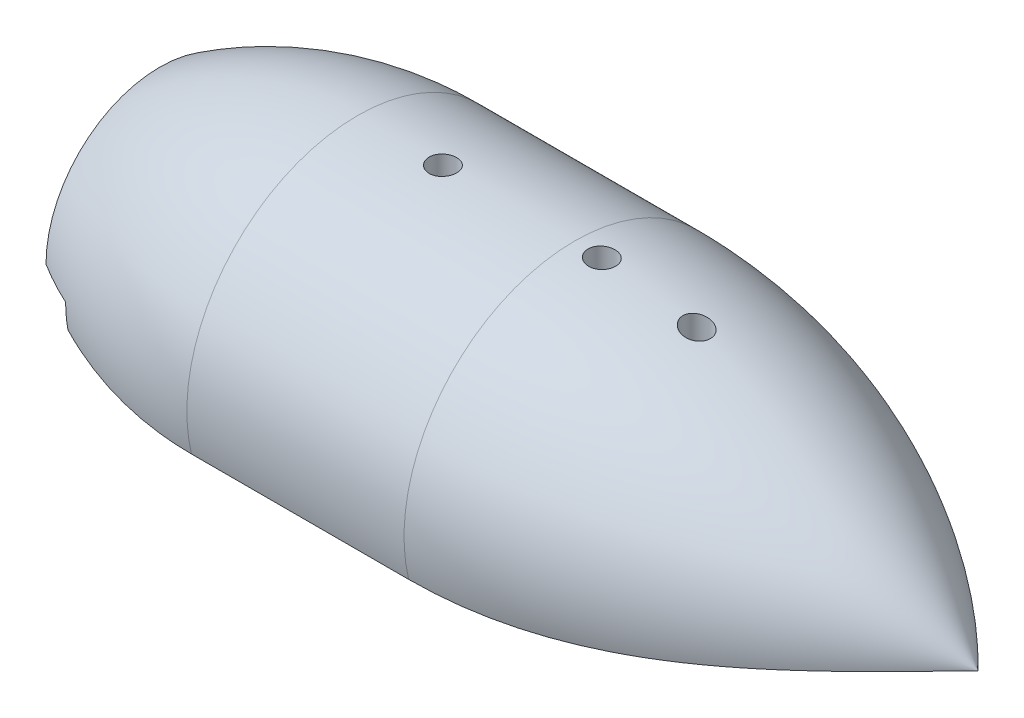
ISO-10303-21;
HEADER;
FILE_DESCRIPTION(('STEP AP214'),'2;1');
FILE_NAME('part.step','',(''),(''),'','','');
FILE_SCHEMA(('AUTOMOTIVE_DESIGN { 1 0 10303 214 1 1 1 1 }'));
ENDSEC;
DATA;
#1=APPLICATION_CONTEXT('core data for automotive mechanical design processes');
#2=APPLICATION_PROTOCOL_DEFINITION('international standard','automotive_design',2000,#1);
#3=PRODUCT_CONTEXT('',#1,'mechanical');
#4=PRODUCT('Part','Part','',(#3));
#5=PRODUCT_RELATED_PRODUCT_CATEGORY('part','',(#4));
#6=PRODUCT_DEFINITION_FORMATION('','',#4);
#7=PRODUCT_DEFINITION_CONTEXT('part definition',#1,'design');
#8=PRODUCT_DEFINITION('design','',#6,#7);
#9=PRODUCT_DEFINITION_SHAPE('','',#8);
#10=(LENGTH_UNIT() NAMED_UNIT(*) SI_UNIT(.MILLI.,.METRE.));
#11=(NAMED_UNIT(*) PLANE_ANGLE_UNIT() SI_UNIT($,.RADIAN.));
#12=(NAMED_UNIT(*) SI_UNIT($,.STERADIAN.) SOLID_ANGLE_UNIT());
#13=UNCERTAINTY_MEASURE_WITH_UNIT(LENGTH_MEASURE(1.E-05),#10,'distance_accuracy_value','');
#14=(GEOMETRIC_REPRESENTATION_CONTEXT(3) GLOBAL_UNCERTAINTY_ASSIGNED_CONTEXT((#13)) GLOBAL_UNIT_ASSIGNED_CONTEXT((#10,
#11,#12)) REPRESENTATION_CONTEXT('',''));
#15=CARTESIAN_POINT('',(0.,0.,0.));
#16=DIRECTION('',(0.,0.,1.));
#17=DIRECTION('',(1.,0.,0.));
#18=AXIS2_PLACEMENT_3D('',#15,#16,#17);
#19=CARTESIAN_POINT('',(42.3417985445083,12.954,-11.8035781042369));
#20=DIRECTION('',(-1.,0.,0.));
#21=DIRECTION('',(0.,0.,1.));
#22=AXIS2_PLACEMENT_3D('',#19,#20,#21);
#23=PLANE('',#22);
#24=CARTESIAN_POINT('',(42.3417985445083,-39.6875,0.));
#25=DIRECTION('',(-1.,0.,0.));
#26=DIRECTION('',(0.,0.,1.));
#27=AXIS2_PLACEMENT_3D('',#24,#25,#26);
#28=CIRCLE('',#27,39.6875);
#29=CARTESIAN_POINT('',(42.3417985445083,-0.126608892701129,-3.1675781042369));
#30=VERTEX_POINT('',#29);
#31=CARTESIAN_POINT('',(42.3417985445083,-1.33740998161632,-10.2160781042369));
#32=VERTEX_POINT('',#31);
#33=EDGE_CURVE('E886',#30,#32,#28,.T.);
#34=ORIENTED_EDGE('',*,*,#33,.F.);
#35=DIRECTION('',(0.,-1.,0.));
#36=VECTOR('',#35,1.);
#37=CARTESIAN_POINT('',(42.3417985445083,10.16,-3.16757810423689));
#38=LINE('',#37,#36);
#39=CARTESIAN_POINT('',(42.3417985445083,10.16,-3.16757810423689));
#40=VERTEX_POINT('',#39);
#41=EDGE_CURVE('E842',#40,#30,#38,.T.);
#42=ORIENTED_EDGE('',*,*,#41,.F.);
#43=DIRECTION('',(0.,-1.,0.));
#44=VECTOR('',#43,1.);
#45=CARTESIAN_POINT('',(42.3417985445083,29.9803841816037,-3.1675781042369));
#46=LINE('',#45,#44);
#47=CARTESIAN_POINT('',(42.3417985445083,12.954,-3.1675781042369));
#48=VERTEX_POINT('',#47);
#49=EDGE_CURVE('E994',#48,#40,#46,.T.);
#50=ORIENTED_EDGE('',*,*,#49,.F.);
#51=DIRECTION('',(0.,0.,-1.));
#52=VECTOR('',#51,1.);
#53=CARTESIAN_POINT('',(42.3417985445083,12.954,-11.8035781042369));
#54=LINE('',#53,#52);
#55=CARTESIAN_POINT('',(42.3417985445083,12.954,-10.2160781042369));
#56=VERTEX_POINT('',#55);
#57=EDGE_CURVE('E869',#48,#56,#54,.T.);
#58=ORIENTED_EDGE('',*,*,#57,.T.);
#59=DIRECTION('',(0.,-1.,0.));
#60=VECTOR('',#59,1.);
#61=CARTESIAN_POINT('',(42.3417985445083,-8.10299076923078,-10.2160781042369));
#62=LINE('',#61,#60);
#63=EDGE_CURVE('E395',#56,#32,#62,.T.);
#64=ORIENTED_EDGE('',*,*,#63,.T.);
#65=EDGE_LOOP('',(#34,#42,#50,#58,#64));
#66=FACE_BOUND('',#65,.T.);
#67=ADVANCED_FACE('F34',(#66),#23,.T.);
#68=CARTESIAN_POINT('',(42.3417985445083,-39.6875,0.));
#69=DIRECTION('',(-1.,0.,0.));
#70=DIRECTION('',(0.,0.,1.));
#71=AXIS2_PLACEMENT_3D('',#68,#69,#70);
#72=CIRCLE('',#71,39.6875);
#73=CARTESIAN_POINT('',(42.3417985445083,-1.34136729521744,10.2309218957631));
#74=VERTEX_POINT('',#73);
#75=CARTESIAN_POINT('',(42.3417985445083,-0.127800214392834,3.1824218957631));
#76=VERTEX_POINT('',#75);
#77=EDGE_CURVE('E901',#74,#76,#72,.T.);
#78=ORIENTED_EDGE('',*,*,#77,.F.);
#79=DIRECTION('',(0.,-1.,0.));
#80=VECTOR('',#79,1.);
#81=CARTESIAN_POINT('',(42.3417985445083,12.954,10.2309218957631));
#82=LINE('',#81,#80);
#83=CARTESIAN_POINT('',(42.3417985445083,12.954,10.2309218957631));
#84=VERTEX_POINT('',#83);
#85=EDGE_CURVE('E393',#74,#84,#82,.F.);
#86=ORIENTED_EDGE('',*,*,#85,.T.);
#87=CARTESIAN_POINT('',(42.3417985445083,12.954,3.18242189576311));
#88=VERTEX_POINT('',#87);
#89=EDGE_CURVE('E870',#84,#88,#54,.T.);
#90=ORIENTED_EDGE('',*,*,#89,.T.);
#91=DIRECTION('',(0.,-1.,0.));
#92=VECTOR('',#91,1.);
#93=CARTESIAN_POINT('',(42.3417985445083,29.9803841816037,3.18242189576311));
#94=LINE('',#93,#92);
#95=CARTESIAN_POINT('',(42.3417985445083,10.16,3.1824218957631));
#96=VERTEX_POINT('',#95);
#97=EDGE_CURVE('E1000',#96,#88,#94,.F.);
#98=ORIENTED_EDGE('',*,*,#97,.F.);
#99=DIRECTION('',(0.,-1.,0.));
#100=VECTOR('',#99,1.);
#101=CARTESIAN_POINT('',(42.3417985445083,10.16,3.1824218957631));
#102=LINE('',#101,#100);
#103=EDGE_CURVE('E839',#96,#76,#102,.T.);
#104=ORIENTED_EDGE('',*,*,#103,.T.);
#105=EDGE_LOOP('',(#78,#86,#90,#98,#104));
#106=FACE_BOUND('',#105,.T.);
#107=ADVANCED_FACE('F712',(#106),#23,.T.);
#108=CARTESIAN_POINT('',(24.13,0.,0.));
#109=DIRECTION('',(-1.,0.,0.));
#110=DIRECTION('',(0.,0.,1.));
#111=AXIS2_PLACEMENT_3D('',#108,#109,#110);
#112=CYLINDRICAL_SURFACE('',#111,7.9375);
#113=CARTESIAN_POINT('',(18.9229985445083,0.,0.));
#114=DIRECTION('',(1.,0.,0.));
#115=DIRECTION('',(0.,0.,-1.));
#116=AXIS2_PLACEMENT_3D('',#113,#114,#115);
#117=CIRCLE('',#116,7.9375);
#118=CARTESIAN_POINT('',(18.9229985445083,-0.793750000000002,7.8977127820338));
#119=VERTEX_POINT('',#118);
#120=CARTESIAN_POINT('',(18.9229985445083,1.00201309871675,7.874));
#121=VERTEX_POINT('',#120);
#122=EDGE_CURVE('E384',#119,#121,#117,.F.);
#123=ORIENTED_EDGE('',*,*,#122,.F.);
#124=DIRECTION('',(-1.,0.,0.));
#125=VECTOR('',#124,1.);
#126=CARTESIAN_POINT('',(43.815,-0.793750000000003,7.8977127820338));
#127=LINE('',#126,#125);
#128=CARTESIAN_POINT('',(10.9132781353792,-0.793749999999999,7.8977127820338));
#129=VERTEX_POINT('',#128);
#130=EDGE_CURVE('E958',#119,#129,#127,.T.);
#131=ORIENTED_EDGE('',*,*,#130,.T.);
#132=CARTESIAN_POINT('',(10.9132781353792,0.,0.));
#133=DIRECTION('',(1.,0.,0.));
#134=DIRECTION('',(0.,0.,-1.));
#135=AXIS2_PLACEMENT_3D('',#132,#133,#134);
#136=CIRCLE('',#135,7.9375);
#137=CARTESIAN_POINT('',(10.9132781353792,0.,7.9375));
#138=VERTEX_POINT('',#137);
#139=EDGE_CURVE('E464',#129,#138,#136,.F.);
#140=ORIENTED_EDGE('',*,*,#139,.T.);
#141=DIRECTION('',(-1.,0.,0.));
#142=VECTOR('',#141,1.);
#143=CARTESIAN_POINT('',(24.13,0.,7.9375));
#144=LINE('',#143,#142);
#145=CARTESIAN_POINT('',(0.,0.,7.9375));
#146=VERTEX_POINT('',#145);
#147=EDGE_CURVE('E817',#138,#146,#144,.T.);
#148=ORIENTED_EDGE('',*,*,#147,.T.);
#149=CARTESIAN_POINT('',(0.,0.,0.));
#150=DIRECTION('',(-1.,0.,0.));
#151=DIRECTION('',(0.,0.,1.));
#152=AXIS2_PLACEMENT_3D('',#149,#150,#151);
#153=CIRCLE('',#152,7.9375);
#154=CARTESIAN_POINT('',(0.,0.,-7.9375));
#155=VERTEX_POINT('',#154);
#156=EDGE_CURVE('E379',#146,#155,#153,.T.);
#157=ORIENTED_EDGE('',*,*,#156,.T.);
#158=DIRECTION('',(-1.,0.,0.));
#159=VECTOR('',#158,1.);
#160=CARTESIAN_POINT('',(24.13,0.,-7.9375));
#161=LINE('',#160,#159);
#162=CARTESIAN_POINT('',(10.9132781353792,0.,-7.9375));
#163=VERTEX_POINT('',#162);
#164=EDGE_CURVE('E813',#155,#163,#161,.F.);
#165=ORIENTED_EDGE('',*,*,#164,.T.);
#166=CARTESIAN_POINT('',(10.9132781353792,0.,0.));
#167=DIRECTION('',(1.,0.,0.));
#168=DIRECTION('',(0.,0.,-1.));
#169=AXIS2_PLACEMENT_3D('',#166,#167,#168);
#170=CIRCLE('',#169,7.9375);
#171=CARTESIAN_POINT('',(10.9132781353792,-0.793750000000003,-7.8977127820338));
#172=VERTEX_POINT('',#171);
#173=EDGE_CURVE('E466',#163,#172,#170,.F.);
#174=ORIENTED_EDGE('',*,*,#173,.T.);
#175=DIRECTION('',(-1.,0.,0.));
#176=VECTOR('',#175,1.);
#177=CARTESIAN_POINT('',(43.815,-0.793750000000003,-7.8977127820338));
#178=LINE('',#177,#176);
#179=CARTESIAN_POINT('',(18.9229985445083,-0.793749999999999,-7.8977127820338));
#180=VERTEX_POINT('',#179);
#181=EDGE_CURVE('E951',#172,#180,#178,.F.);
#182=ORIENTED_EDGE('',*,*,#181,.T.);
#183=CARTESIAN_POINT('',(18.9229985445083,1.00201309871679,-7.874));
#184=VERTEX_POINT('',#183);
#185=EDGE_CURVE('E786',#184,#180,#117,.F.);
#186=ORIENTED_EDGE('',*,*,#185,.F.);
#187=DIRECTION('',(-1.,0.,0.));
#188=VECTOR('',#187,1.);
#189=CARTESIAN_POINT('',(24.13,1.00201309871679,-7.874));
#190=LINE('',#189,#188);
#191=CARTESIAN_POINT('',(16.5099985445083,1.00201309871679,-7.874));
#192=VERTEX_POINT('',#191);
#193=EDGE_CURVE('E825',#184,#192,#190,.T.);
#194=ORIENTED_EDGE('',*,*,#193,.T.);
#195=CARTESIAN_POINT('',(16.5099985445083,1.00201309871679,-7.874));
#196=CARTESIAN_POINT('',(16.4805623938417,1.0018736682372,-7.87401307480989));
#197=CARTESIAN_POINT('',(16.451390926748,1.0052282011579,-7.87359153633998));
#198=CARTESIAN_POINT('',(16.3948993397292,1.01738307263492,-7.87203223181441));
#199=CARTESIAN_POINT('',(16.3675518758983,1.02605419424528,-7.87091144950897));
#200=CARTESIAN_POINT('',(16.30293734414,1.0521291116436,-7.867474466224));
#201=CARTESIAN_POINT('',(16.2666031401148,1.07169678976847,-7.86484921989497));
#202=CARTESIAN_POINT('',(16.1967752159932,1.11585203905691,-7.8587081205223));
#203=CARTESIAN_POINT('',(16.1633221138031,1.14049861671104,-7.85518166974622));
#204=CARTESIAN_POINT('',(16.074983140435,1.21191107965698,-7.84456834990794));
#205=CARTESIAN_POINT('',(16.0225546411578,1.26154945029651,-7.83677777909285));
#206=CARTESIAN_POINT('',(15.9219246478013,1.3647198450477,-7.8194776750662));
#207=CARTESIAN_POINT('',(15.8737356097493,1.41826254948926,-7.80996331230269));
#208=CARTESIAN_POINT('',(15.7800189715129,1.52759368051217,-7.78931731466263));
#209=CARTESIAN_POINT('',(15.7344992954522,1.58338803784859,-7.7781811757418));
#210=CARTESIAN_POINT('',(15.6454872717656,1.69610975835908,-7.75438201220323));
#211=CARTESIAN_POINT('',(15.6019923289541,1.75303552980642,-7.74172102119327));
#212=CARTESIAN_POINT('',(15.4874008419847,1.90655157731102,-7.70575882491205));
#213=CARTESIAN_POINT('',(15.4176308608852,2.00381087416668,-7.68107329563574));
#214=CARTESIAN_POINT('',(15.2810463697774,2.19922926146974,-7.62742364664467));
#215=CARTESIAN_POINT('',(15.2142326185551,2.29738857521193,-7.59845843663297));
#216=CARTESIAN_POINT('',(15.0173110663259,2.59254800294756,-7.50501065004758));
#217=CARTESIAN_POINT('',(14.8908863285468,2.79000316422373,-7.43402801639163));
#218=CARTESIAN_POINT('',(14.6474919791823,3.18304104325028,-7.27441743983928));
#219=CARTESIAN_POINT('',(14.5305060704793,3.37862645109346,-7.18582086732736));
#220=CARTESIAN_POINT('',(14.3071545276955,3.76650188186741,-6.99031281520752));
#221=CARTESIAN_POINT('',(14.2007789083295,3.95879485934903,-6.88341881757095));
#222=CARTESIAN_POINT('',(14.035605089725,4.27266997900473,-6.69099032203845));
#223=CARTESIAN_POINT('',(13.9730995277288,4.39565070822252,-6.61090182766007));
#224=CARTESIAN_POINT('',(13.8545239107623,4.63900831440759,-6.4424717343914));
#225=CARTESIAN_POINT('',(13.7984541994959,4.75938505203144,-6.35412969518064));
#226=CARTESIAN_POINT('',(13.6419011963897,5.11478183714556,-6.07722221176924));
#227=CARTESIAN_POINT('',(13.5524138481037,5.34529622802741,-5.87603248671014));
#228=CARTESIAN_POINT('',(13.4372691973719,5.71454077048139,-5.51282211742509));
#229=CARTESIAN_POINT('',(13.4002971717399,5.85850664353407,-5.35970766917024));
#230=CARTESIAN_POINT('',(13.3619395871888,6.06664060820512,-5.11967704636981));
#231=CARTESIAN_POINT('',(13.3519997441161,6.13492009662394,-5.03766363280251));
#232=CARTESIAN_POINT('',(13.3385280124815,6.26842329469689,-4.87055002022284));
#233=CARTESIAN_POINT('',(13.3350025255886,6.33364388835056,-4.78544682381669));
#234=CARTESIAN_POINT('',(13.3349985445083,6.39713258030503,-4.699));
#235=B_SPLINE_CURVE_WITH_KNOTS('',3,(#195,#196,#197,#198,#199,#200,#201,#202,#203,#204,#205,
#206,#207,#208,#209,#210,#211,#212,#213,#214,#215,#216,#217,#218,#219,#220,#221,#222,#223,#224,
#225,#226,#227,#228,#229,#230,#231,#232,#233,#234),.UNSPECIFIED.,.F.,.F.,(4,2,2,2,2,2,2,2,2,2,2,
2,2,2,2,2,2,2,2,4),(0.,0.0876972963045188,0.173343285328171,0.296691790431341,0.421563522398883,
0.638834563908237,0.856724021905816,1.07523057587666,1.29344888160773,1.65994206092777,
2.02652877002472,2.76055177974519,3.4932790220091,4.22531006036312,4.7035100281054,
5.18173552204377,6.13348655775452,6.77194976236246,7.09322556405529,7.41482183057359),.UNSPECIFIED.);
#236=CARTESIAN_POINT('',(13.3349985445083,6.39713258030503,-4.699));
#237=VERTEX_POINT('',#236);
#238=EDGE_CURVE('E490',#192,#237,#235,.T.);
#239=ORIENTED_EDGE('',*,*,#238,.T.);
#240=CARTESIAN_POINT('',(13.3349985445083,0.,0.));
#241=DIRECTION('',(1.,0.,0.));
#242=DIRECTION('',(0.,0.,-1.));
#243=AXIS2_PLACEMENT_3D('',#240,#241,#242);
#244=CIRCLE('',#243,7.9375);
#245=CARTESIAN_POINT('',(13.3349985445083,7.874,-1.00201309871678));
#246=VERTEX_POINT('',#245);
#247=EDGE_CURVE('E456',#246,#237,#244,.F.);
#248=ORIENTED_EDGE('',*,*,#247,.F.);
#249=DIRECTION('',(-1.,0.,0.));
#250=VECTOR('',#249,1.);
#251=CARTESIAN_POINT('',(24.13,7.874,-1.00201309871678));
#252=LINE('',#251,#250);
#253=CARTESIAN_POINT('',(18.9229985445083,7.874,-1.00201309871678));
#254=VERTEX_POINT('',#253);
#255=EDGE_CURVE('E808',#246,#254,#252,.F.);
#256=ORIENTED_EDGE('',*,*,#255,.T.);
#257=CARTESIAN_POINT('',(18.9229985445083,7.874,1.00201309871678));
#258=VERTEX_POINT('',#257);
#259=EDGE_CURVE('E788',#258,#254,#117,.F.);
#260=ORIENTED_EDGE('',*,*,#259,.F.);
#261=DIRECTION('',(-1.,0.,0.));
#262=VECTOR('',#261,1.);
#263=CARTESIAN_POINT('',(24.13,7.874,1.00201309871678));
#264=LINE('',#263,#262);
#265=CARTESIAN_POINT('',(13.3349985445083,7.874,1.00201309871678));
#266=VERTEX_POINT('',#265);
#267=EDGE_CURVE('E829',#258,#266,#264,.T.);
#268=ORIENTED_EDGE('',*,*,#267,.T.);
#269=CARTESIAN_POINT('',(13.3349985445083,6.39713258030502,4.699));
#270=VERTEX_POINT('',#269);
#271=EDGE_CURVE('E459',#270,#266,#244,.F.);
#272=ORIENTED_EDGE('',*,*,#271,.F.);
#273=CARTESIAN_POINT('',(13.3349985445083,6.39713258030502,4.699));
#274=CARTESIAN_POINT('',(13.3350089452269,6.31655620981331,4.80873725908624));
#275=CARTESIAN_POINT('',(13.3406846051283,6.2331812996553,4.91628571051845));
#276=CARTESIAN_POINT('',(13.3621034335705,6.06169493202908,5.1262062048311));
#277=CARTESIAN_POINT('',(13.3778294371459,5.97359178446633,5.22858675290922));
#278=CARTESIAN_POINT('',(13.4178047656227,5.79452782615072,5.42631768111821));
#279=CARTESIAN_POINT('',(13.4419281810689,5.70362638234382,5.52174802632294));
#280=CARTESIAN_POINT('',(13.4976803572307,5.51833678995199,5.7069281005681));
#281=CARTESIAN_POINT('',(13.5293131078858,5.42394681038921,5.79667477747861));
#282=CARTESIAN_POINT('',(13.6130043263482,5.19410732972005,6.00481628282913));
#283=CARTESIAN_POINT('',(13.6681834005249,5.05725406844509,6.12041420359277));
#284=CARTESIAN_POINT('',(13.7891030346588,4.77901553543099,6.34006031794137));
#285=CARTESIAN_POINT('',(13.8548478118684,4.63762847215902,6.444103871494));
#286=CARTESIAN_POINT('',(13.995848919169,4.34980924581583,6.64182718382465));
#287=CARTESIAN_POINT('',(14.0711993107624,4.20333933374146,6.7353844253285));
#288=CARTESIAN_POINT('',(14.2293454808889,3.90777721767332,6.91105882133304));
#289=CARTESIAN_POINT('',(14.3121369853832,3.75868655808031,6.99318247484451));
#290=CARTESIAN_POINT('',(14.5085530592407,3.41587750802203,7.16815689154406));
#291=CARTESIAN_POINT('',(14.6242564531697,3.2215102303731,7.25743009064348));
#292=CARTESIAN_POINT('',(14.8048385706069,2.92860703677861,7.37823641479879));
#293=CARTESIAN_POINT('',(14.8662972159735,2.83060539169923,7.41636662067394));
#294=CARTESIAN_POINT('',(14.9915123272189,2.63449934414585,7.488272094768));
#295=CARTESIAN_POINT('',(15.0552681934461,2.53639497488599,7.52204848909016));
#296=CARTESIAN_POINT('',(15.1844568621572,2.34155782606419,7.58494336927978));
#297=CARTESIAN_POINT('',(15.2498614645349,2.24482238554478,7.61411154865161));
#298=CARTESIAN_POINT('',(15.383514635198,2.05202487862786,7.66832047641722));
#299=CARTESIAN_POINT('',(15.4517657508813,1.95596350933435,7.69335742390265));
#300=CARTESIAN_POINT('',(15.5916333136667,1.76594777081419,7.73917321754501));
#301=CARTESIAN_POINT('',(15.6632326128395,1.67198567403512,7.75997134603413));
#302=CARTESIAN_POINT('',(15.7750033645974,1.53405047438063,7.78799117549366));
#303=CARTESIAN_POINT('',(15.8129588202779,1.48860635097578,7.79679614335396));
#304=CARTESIAN_POINT('',(15.8909141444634,1.39931230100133,7.81331439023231));
#305=CARTESIAN_POINT('',(15.9309129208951,1.35546154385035,7.82102824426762));
#306=CARTESIAN_POINT('',(16.0043140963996,1.28028378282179,7.8336377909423));
#307=CARTESIAN_POINT('',(16.0371049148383,1.24840434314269,7.8387727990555));
#308=CARTESIAN_POINT('',(16.1052402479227,1.18714378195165,7.84828333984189));
#309=CARTESIAN_POINT('',(16.1405897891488,1.15776783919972,7.85265731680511));
#310=CARTESIAN_POINT('',(16.2067638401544,1.10937898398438,7.8596214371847));
#311=CARTESIAN_POINT('',(16.2369210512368,1.08949723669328,7.86239286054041));
#312=CARTESIAN_POINT('',(16.2997068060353,1.05434623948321,7.86718311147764));
#313=CARTESIAN_POINT('',(16.3323146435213,1.03904281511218,7.86920754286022));
#314=CARTESIAN_POINT('',(16.3891309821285,1.01933880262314,7.87178031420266));
#315=CARTESIAN_POINT('',(16.4126371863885,1.01301213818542,7.87259439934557));
#316=CARTESIAN_POINT('',(16.4607126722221,1.00427739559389,7.87371207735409));
#317=CARTESIAN_POINT('',(16.4852924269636,1.00192747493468,7.87400809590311));
#318=CARTESIAN_POINT('',(16.5099985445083,1.00201309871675,7.874));
#319=B_SPLINE_CURVE_WITH_KNOTS('',3,(#273,#274,#275,#276,#277,#278,#279,#280,#281,#282,#283,
#284,#285,#286,#287,#288,#289,#290,#291,#292,#293,#294,#295,#296,#297,#298,#299,#300,#301,#302,
#303,#304,#305,#306,#307,#308,#309,#310,#311,#312,#313,#314,#315,#316,#317,#318),.UNSPECIFIED.,
.F.,.F.,(4,2,2,2,2,2,2,2,2,2,2,2,2,2,2,2,2,2,2,2,2,2,4),(0.,0.408109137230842,0.815523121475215,
1.21707430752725,1.61883932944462,2.18034368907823,2.74207272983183,3.3097994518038,
3.87720214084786,4.60575189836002,4.97107870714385,5.33631083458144,5.69728677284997,
6.05859299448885,6.41821703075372,6.59775998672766,6.7772079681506,6.91518883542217,
7.05344853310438,7.16190292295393,7.26952631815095,7.34227431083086,7.41607728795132),.UNSPECIFIED.);
#320=CARTESIAN_POINT('',(16.5099985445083,1.00201309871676,7.874));
#321=VERTEX_POINT('',#320);
#322=EDGE_CURVE('E483',#270,#321,#319,.T.);
#323=ORIENTED_EDGE('',*,*,#322,.T.);
#324=DIRECTION('',(-1.,0.,0.));
#325=VECTOR('',#324,1.);
#326=CARTESIAN_POINT('',(24.13,1.00201309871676,7.874));
#327=LINE('',#326,#325);
#328=EDGE_CURVE('E804',#321,#121,#327,.F.);
#329=ORIENTED_EDGE('',*,*,#328,.T.);
#330=EDGE_LOOP('',(#123,#131,#140,#148,#157,#165,#174,#182,#186,#194,#239,#248,#256,#260,#268,
#272,#323,#329));
#331=FACE_BOUND('',#330,.T.);
#332=ADVANCED_FACE('F496',(#331),#112,.F.);
#333=CARTESIAN_POINT('',(87.63,0.,0.));
#334=DIRECTION('',(-1.,0.,0.));
#335=DIRECTION('',(0.,0.,1.));
#336=AXIS2_PLACEMENT_3D('',#333,#334,#335);
#337=CYLINDRICAL_SURFACE('',#336,18.288);
#338=CARTESIAN_POINT('',(28.8671172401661,18.288,0.));
#339=CARTESIAN_POINT('',(28.8675370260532,18.2879992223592,-0.082606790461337));
#340=CARTESIAN_POINT('',(28.8749213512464,18.2874343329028,-0.165234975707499));
#341=CARTESIAN_POINT('',(28.9034367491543,18.2852379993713,-0.328135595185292));
#342=CARTESIAN_POINT('',(28.9245834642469,18.2836053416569,-0.408405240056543));
#343=CARTESIAN_POINT('',(28.9800086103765,18.2794607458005,-0.564206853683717));
#344=CARTESIAN_POINT('',(29.0142796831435,18.2769493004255,-0.639741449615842));
#345=CARTESIAN_POINT('',(29.0949680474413,18.2713314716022,-0.783968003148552));
#346=CARTESIAN_POINT('',(29.1413827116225,18.2682252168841,-0.852661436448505));
#347=CARTESIAN_POINT('',(29.2451607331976,18.2617604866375,-0.9814379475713));
#348=CARTESIAN_POINT('',(29.3025470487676,18.2584014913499,-1.04150249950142));
#349=CARTESIAN_POINT('',(29.4265899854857,18.2518164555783,-1.15115832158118));
#350=CARTESIAN_POINT('',(29.493247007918,18.2485904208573,-1.20074913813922));
#351=CARTESIAN_POINT('',(29.6340473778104,18.2426326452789,-1.28810906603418));
#352=CARTESIAN_POINT('',(29.7082004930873,18.2399015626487,-1.32586248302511));
#353=CARTESIAN_POINT('',(29.8618188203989,18.235250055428,-1.38837598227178));
#354=CARTESIAN_POINT('',(29.9412839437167,18.2333296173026,-1.41313628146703));
#355=CARTESIAN_POINT('',(30.1030854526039,18.2305220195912,-1.44890840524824));
#356=CARTESIAN_POINT('',(30.185415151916,18.2296326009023,-1.4599502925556));
#357=CARTESIAN_POINT('',(30.350763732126,18.2289809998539,-1.46806444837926));
#358=CARTESIAN_POINT('',(30.4337826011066,18.2292187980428,-1.46513695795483));
#359=CARTESIAN_POINT('',(30.5979530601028,18.2307925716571,-1.44542088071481));
#360=CARTESIAN_POINT('',(30.6791084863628,18.2321260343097,-1.42866400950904));
#361=CARTESIAN_POINT('',(30.8374513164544,18.2357364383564,-1.38181329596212));
#362=CARTESIAN_POINT('',(30.9146386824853,18.2380133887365,-1.35171932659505));
#363=CARTESIAN_POINT('',(31.0629613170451,18.2432563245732,-1.27900986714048));
#364=CARTESIAN_POINT('',(31.1340891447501,18.2462231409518,-1.23637926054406));
#365=CARTESIAN_POINT('',(31.2681920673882,18.2525092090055,-1.13981788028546));
#366=CARTESIAN_POINT('',(31.3311670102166,18.255828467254,-1.08588689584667));
#367=CARTESIAN_POINT('',(31.4473617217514,18.2624548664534,-0.968074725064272));
#368=CARTESIAN_POINT('',(31.5005535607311,18.2657619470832,-0.904165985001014));
#369=CARTESIAN_POINT('',(31.5954574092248,18.2719801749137,-0.768310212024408));
#370=CARTESIAN_POINT('',(31.6371694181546,18.2748913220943,-0.696363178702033));
#371=CARTESIAN_POINT('',(31.7079243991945,18.2799874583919,-0.546461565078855));
#372=CARTESIAN_POINT('',(31.7369671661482,18.2821724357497,-0.468506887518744));
#373=CARTESIAN_POINT('',(31.7815446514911,18.2855668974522,-0.308806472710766));
#374=CARTESIAN_POINT('',(31.7970796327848,18.2867764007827,-0.227060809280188));
#375=CARTESIAN_POINT('',(31.8141668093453,18.2880786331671,-0.0623442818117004));
#376=CARTESIAN_POINT('',(31.8157580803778,18.2881744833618,0.0206225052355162));
#377=CARTESIAN_POINT('',(31.8050143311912,18.2872439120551,0.185642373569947));
#378=CARTESIAN_POINT('',(31.7926794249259,18.2862174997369,0.267695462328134));
#379=CARTESIAN_POINT('',(31.7544650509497,18.2831569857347,0.428455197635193));
#380=CARTESIAN_POINT('',(31.728602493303,18.281124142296,0.507165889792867));
#381=CARTESIAN_POINT('',(31.6640841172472,18.276276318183,0.659130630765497));
#382=CARTESIAN_POINT('',(31.625428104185,18.2734613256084,0.73238459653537));
#383=CARTESIAN_POINT('',(31.5363181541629,18.2673543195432,0.87153810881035));
#384=CARTESIAN_POINT('',(31.4858377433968,18.2640612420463,0.937420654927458));
#385=CARTESIAN_POINT('',(31.3745512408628,18.2573697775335,1.05979047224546));
#386=CARTESIAN_POINT('',(31.3137449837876,18.2539713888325,1.11627759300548));
#387=CARTESIAN_POINT('',(31.1833657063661,18.2474413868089,1.21838328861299));
#388=CARTESIAN_POINT('',(31.1137730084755,18.2443103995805,1.26397678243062));
#389=CARTESIAN_POINT('',(30.967895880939,18.2386765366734,1.34282973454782));
#390=CARTESIAN_POINT('',(30.8916115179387,18.23617365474,1.3760893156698));
#391=CARTESIAN_POINT('',(30.7346138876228,18.2320817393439,1.42928490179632));
#392=CARTESIAN_POINT('',(30.6539063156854,18.2304915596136,1.44923762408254));
#393=CARTESIAN_POINT('',(30.4902733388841,18.2284004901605,1.47530789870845));
#394=CARTESIAN_POINT('',(30.4073479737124,18.227899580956,1.48142569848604));
#395=CARTESIAN_POINT('',(30.2418870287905,18.2280436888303,1.47965118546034));
#396=CARTESIAN_POINT('',(30.159351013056,18.2286854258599,1.47179897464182));
#397=CARTESIAN_POINT('',(29.9967739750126,18.2310358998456,1.44238991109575));
#398=CARTESIAN_POINT('',(29.9167329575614,18.232744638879,1.42083303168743));
#399=CARTESIAN_POINT('',(29.7614097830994,18.2370366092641,1.36463492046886));
#400=CARTESIAN_POINT('',(29.6861276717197,18.2396198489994,1.32999356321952));
#401=CARTESIAN_POINT('',(29.5424410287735,18.2453709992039,1.24861435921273));
#402=CARTESIAN_POINT('',(29.4740363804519,18.2485388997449,1.20187671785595));
#403=CARTESIAN_POINT('',(29.3458402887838,18.255114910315,1.09747851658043));
#404=CARTESIAN_POINT('',(29.2860731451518,18.2585236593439,1.03978815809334));
#405=CARTESIAN_POINT('',(29.1770469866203,18.2651931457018,0.915176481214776));
#406=CARTESIAN_POINT('',(29.127790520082,18.2684538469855,0.848252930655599));
#407=CARTESIAN_POINT('',(29.0411239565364,18.2744675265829,0.706955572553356));
#408=CARTESIAN_POINT('',(29.0037346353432,18.2772196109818,0.632568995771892));
#409=CARTESIAN_POINT('',(28.9420246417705,18.2818979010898,0.478602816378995));
#410=CARTESIAN_POINT('',(28.917688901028,18.2838250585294,0.399029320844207));
#411=CARTESIAN_POINT('',(28.8889516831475,18.2861429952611,0.26582011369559));
#412=CARTESIAN_POINT('',(28.8805390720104,18.2868364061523,0.213020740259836));
#413=CARTESIAN_POINT('',(28.8694861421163,18.2877651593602,0.106817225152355));
#414=CARTESIAN_POINT('',(28.8668458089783,18.2880005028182,0.0534130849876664));
#415=CARTESIAN_POINT('',(28.8671172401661,18.288,0.));
#416=B_SPLINE_CURVE_WITH_KNOTS('',3,(#338,#339,#340,#341,#342,#343,#344,#345,#346,#347,#348,
#349,#350,#351,#352,#353,#354,#355,#356,#357,#358,#359,#360,#361,#362,#363,#364,#365,#366,#367,
#368,#369,#370,#371,#372,#373,#374,#375,#376,#377,#378,#379,#380,#381,#382,#383,#384,#385,#386,
#387,#388,#389,#390,#391,#392,#393,#394,#395,#396,#397,#398,#399,#400,#401,#402,#403,#404,#405,
#406,#407,#408,#409,#410,#411,#412,#413,#414,#415),.UNSPECIFIED.,.T.,.F.,(4,2,2,2,2,2,2,2,2,2,2,
2,2,2,2,2,2,2,2,2,2,2,2,2,2,2,2,2,2,2,2,2,2,2,2,2,2,2,4),(0.,0.247628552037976,
0.495539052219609,0.743310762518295,0.991028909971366,1.23927119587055,1.4875242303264,
1.73610502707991,1.98468167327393,2.23271261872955,2.48073928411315,2.72819871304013,
2.9756604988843,3.22342190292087,3.47118792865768,3.71965067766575,3.9681134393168,
4.21658022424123,4.46504217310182,4.71280761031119,4.96057102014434,5.20802545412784,
5.45548365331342,5.70350127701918,5.95152287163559,6.20011011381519,6.44869488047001,
6.69696676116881,6.94523420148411,7.19279012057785,7.44034652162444,7.68790529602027,
7.93545986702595,8.18369785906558,8.43199596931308,8.68072640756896,8.92916910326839,
9.08928472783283,9.24939995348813),.UNSPECIFIED.);
#417=CARTESIAN_POINT('',(28.8671172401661,18.288,0.));
#418=VERTEX_POINT('',#417);
#419=EDGE_CURVE('E1347',#418,#418,#416,.T.);
#420=ORIENTED_EDGE('',*,*,#419,.T.);
#421=EDGE_LOOP('',(#420));
#422=FACE_BOUND('',#421,.T.);
#423=CARTESIAN_POINT('',(21.1848567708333,0.,0.));
#424=DIRECTION('',(-1.,0.,0.));
#425=DIRECTION('',(0.,0.,1.));
#426=AXIS2_PLACEMENT_3D('',#423,#424,#425);
#427=CIRCLE('',#426,18.288);
#428=CARTESIAN_POINT('',(21.1848567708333,-4.2135552,17.7959797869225));
#429=VERTEX_POINT('',#428);
#430=CARTESIAN_POINT('',(21.1848567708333,-4.2135552,-17.7959797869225));
#431=VERTEX_POINT('',#430);
#432=EDGE_CURVE('E381',#429,#431,#427,.T.);
#433=ORIENTED_EDGE('',*,*,#432,.F.);
#434=DIRECTION('',(-1.,0.,0.));
#435=VECTOR('',#434,1.);
#436=CARTESIAN_POINT('',(43.815,-4.2135552,17.7959797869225));
#437=LINE('',#436,#435);
#438=CARTESIAN_POINT('',(44.45,-4.2135552,17.7959797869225));
#439=VERTEX_POINT('',#438);
#440=EDGE_CURVE('E580',#429,#439,#437,.F.);
#441=ORIENTED_EDGE('',*,*,#440,.T.);
#442=CARTESIAN_POINT('',(44.45,0.,0.));
#443=DIRECTION('',(-1.,0.,0.));
#444=DIRECTION('',(0.,0.,1.));
#445=AXIS2_PLACEMENT_3D('',#442,#443,#444);
#446=CIRCLE('',#445,18.288);
#447=CARTESIAN_POINT('',(44.45,-4.2135552,-17.7959797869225));
#448=VERTEX_POINT('',#447);
#449=EDGE_CURVE('E374',#439,#448,#446,.T.);
#450=ORIENTED_EDGE('',*,*,#449,.T.);
#451=DIRECTION('',(-1.,0.,0.));
#452=VECTOR('',#451,1.);
#453=CARTESIAN_POINT('',(43.815,-4.2135552,-17.7959797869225));
#454=LINE('',#453,#452);
#455=EDGE_CURVE('E690',#448,#431,#454,.T.);
#456=ORIENTED_EDGE('',*,*,#455,.T.);
#457=EDGE_LOOP('',(#433,#441,#450,#456));
#458=FACE_BOUND('',#457,.T.);
#459=ADVANCED_FACE('F36',(#422,#458),#337,.T.);
#460=CARTESIAN_POINT('',(21.1848567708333,0.,0.));
#461=DIRECTION('',(-1.,0.,0.));
#462=DIRECTION('',(0.,0.,1.));
#463=AXIS2_PLACEMENT_3D('',#460,#461,#462);
#464=DEGENERATE_TOROIDAL_SURFACE('',#463,21.5708724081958,39.8588724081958,.F.);
#465=ORIENTED_EDGE('',*,*,#432,.T.);
#466=CARTESIAN_POINT('',(21.1850567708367,-4.21355519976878,-17.7959797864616));
#467=CARTESIAN_POINT('',(20.6310766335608,-4.21358143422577,-17.7959820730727));
#468=CARTESIAN_POINT('',(20.0771023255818,-4.20823646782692,-17.7853762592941));
#469=CARTESIAN_POINT('',(18.970171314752,-4.18698653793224,-17.7429488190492));
#470=CARTESIAN_POINT('',(18.4172146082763,-4.17108161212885,-17.7111272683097));
#471=CARTESIAN_POINT('',(17.3133109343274,-4.12889378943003,-17.6262679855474));
#472=CARTESIAN_POINT('',(16.7623640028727,-4.10261070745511,-17.5732298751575));
#473=CARTESIAN_POINT('',(15.6635359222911,-4.04004015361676,-17.4459514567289));
#474=CARTESIAN_POINT('',(15.1156547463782,-4.00375276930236,-17.3717113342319));
#475=CARTESIAN_POINT('',(13.503140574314,-3.88246143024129,-17.1210838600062));
#476=CARTESIAN_POINT('',(12.4439833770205,-3.78400067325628,-16.9148018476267));
#477=CARTESIAN_POINT('',(10.3484442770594,-3.55570107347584,-16.4214611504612));
#478=CARTESIAN_POINT('',(9.31205706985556,-3.42586962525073,-16.1344214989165));
#479=CARTESIAN_POINT('',(7.56986340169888,-3.18358172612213,-15.5764108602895));
#480=CARTESIAN_POINT('',(6.85665707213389,-3.07728343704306,-15.325640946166));
#481=CARTESIAN_POINT('',(5.44709957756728,-2.85535062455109,-14.7843160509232));
#482=CARTESIAN_POINT('',(4.75074552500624,-2.73971771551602,-14.4937679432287));
#483=CARTESIAN_POINT('',(3.36557578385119,-2.50026177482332,-13.867991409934));
#484=CARTESIAN_POINT('',(2.67707677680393,-2.37633469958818,-13.5321017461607));
#485=CARTESIAN_POINT('',(1.32166290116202,-2.12567675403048,-12.8198661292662));
#486=CARTESIAN_POINT('',(0.654752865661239,-1.99894526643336,-12.4435111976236));
#487=CARTESIAN_POINT('',(-0.000199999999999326,-1.87265264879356,-12.0471978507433));
#488=B_SPLINE_CURVE_WITH_KNOTS('',3,(#466,#467,#468,#469,#470,#471,#472,#473,#474,#475,#476,
#477,#478,#479,#480,#481,#482,#483,#484,#485,#486,#487),.UNSPECIFIED.,.F.,.F.,(4,2,2,2,2,2,2,2,
2,2,4),(0.,1.66180205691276,3.32359818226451,4.9854239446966,6.64723516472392,9.89385327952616,
13.1397068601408,15.4288449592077,17.7175880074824,20.0442986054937,22.3715265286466),.UNSPECIFIED.);
#489=CARTESIAN_POINT('',(4.572,-2.70793754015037,-14.408664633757));
#490=VERTEX_POINT('',#489);
#491=EDGE_CURVE('E683',#431,#490,#488,.T.);
#492=ORIENTED_EDGE('',*,*,#491,.T.);
#493=CARTESIAN_POINT('',(4.572,0.,0.));
#494=DIRECTION('',(1.,0.,0.));
#495=DIRECTION('',(0.,1.,0.));
#496=AXIS2_PLACEMENT_3D('',#493,#494,#495);
#497=CIRCLE('',#496,14.6609188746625);
#498=CARTESIAN_POINT('',(4.572,0.,-14.6609188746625));
#499=VERTEX_POINT('',#498);
#500=EDGE_CURVE('E1301',#490,#499,#497,.T.);
#501=ORIENTED_EDGE('',*,*,#500,.T.);
#502=CARTESIAN_POINT('',(21.1848567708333,0.,21.5708724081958));
#503=DIRECTION('',(0.,1.,0.));
#504=DIRECTION('',(0.,0.,1.));
#505=AXIS2_PLACEMENT_3D('',#502,#503,#504);
#506=CIRCLE('',#505,39.8588724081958);
#507=CARTESIAN_POINT('',(0.,0.,-12.192));
#508=VERTEX_POINT('',#507);
#509=EDGE_CURVE('E1323',#499,#508,#506,.T.);
#510=ORIENTED_EDGE('',*,*,#509,.T.);
#511=CARTESIAN_POINT('',(0.,0.,0.));
#512=DIRECTION('',(-1.,0.,0.));
#513=DIRECTION('',(0.,0.,1.));
#514=AXIS2_PLACEMENT_3D('',#511,#512,#513);
#515=CIRCLE('',#514,12.192);
#516=CARTESIAN_POINT('',(0.,0.,12.192));
#517=VERTEX_POINT('',#516);
#518=EDGE_CURVE('E390',#517,#508,#515,.T.);
#519=ORIENTED_EDGE('',*,*,#518,.F.);
#520=CARTESIAN_POINT('',(21.1848567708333,0.,-21.5708724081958));
#521=DIRECTION('',(0.,1.,0.));
#522=DIRECTION('',(0.,0.,1.));
#523=AXIS2_PLACEMENT_3D('',#520,#521,#522);
#524=CIRCLE('',#523,39.8588724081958);
#525=CARTESIAN_POINT('',(4.572,0.,14.6609188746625));
#526=VERTEX_POINT('',#525);
#527=EDGE_CURVE('E1321',#517,#526,#524,.T.);
#528=ORIENTED_EDGE('',*,*,#527,.T.);
#529=CARTESIAN_POINT('',(4.572,-2.70793754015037,14.408664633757));
#530=VERTEX_POINT('',#529);
#531=EDGE_CURVE('E1308',#526,#530,#497,.T.);
#532=ORIENTED_EDGE('',*,*,#531,.T.);
#533=CARTESIAN_POINT('',(-0.0002,-1.87265264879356,12.0471978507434));
#534=CARTESIAN_POINT('',(0.473107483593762,-1.9638972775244,12.3335790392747));
#535=CARTESIAN_POINT('',(0.952649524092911,-2.05539328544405,12.6095517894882));
#536=CARTESIAN_POINT('',(1.92339535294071,-2.23747366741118,13.1404758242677));
#537=CARTESIAN_POINT('',(2.41459900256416,-2.32805805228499,13.3954273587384));
#538=CARTESIAN_POINT('',(3.40795953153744,-2.50691879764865,13.8841542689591));
#539=CARTESIAN_POINT('',(3.91011832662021,-2.59519474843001,14.1179259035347));
#540=CARTESIAN_POINT('',(4.92442212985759,-2.76809635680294,14.5640818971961));
#541=CARTESIAN_POINT('',(5.43656706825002,-2.85272203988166,14.7764664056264));
#542=CARTESIAN_POINT('',(6.96254372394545,-3.09538538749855,15.37192654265));
#543=CARTESIAN_POINT('',(7.98944456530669,-3.24654469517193,15.7248287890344));
#544=CARTESIAN_POINT('',(10.071170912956,-3.5217988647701,16.3479644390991));
#545=CARTESIAN_POINT('',(11.1259876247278,-3.64590213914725,16.6182235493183));
#546=CARTESIAN_POINT('',(12.9212648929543,-3.82675040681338,17.0039379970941));
#547=CARTESIAN_POINT('',(13.6561898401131,-3.89240239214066,17.141344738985));
#548=CARTESIAN_POINT('',(15.1334932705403,-4.00633428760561,17.3772648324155));
#549=CARTESIAN_POINT('',(15.8758705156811,-4.05461703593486,17.4757845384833));
#550=CARTESIAN_POINT('',(17.3779414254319,-4.1332515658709,17.6352244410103));
#551=CARTESIAN_POINT('',(18.1377198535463,-4.16329753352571,17.6955041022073));
#552=CARTESIAN_POINT('',(19.2793590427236,-4.19341556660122,17.7557893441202));
#553=CARTESIAN_POINT('',(19.6602942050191,-4.20096310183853,17.7708620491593));
#554=CARTESIAN_POINT('',(20.422497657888,-4.21103520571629,17.790957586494));
#555=CARTESIAN_POINT('',(20.8037659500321,-4.21355975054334,17.7959803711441));
#556=CARTESIAN_POINT('',(21.1850567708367,-4.21355519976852,17.7959797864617));
#557=B_SPLINE_CURVE_WITH_KNOTS('',3,(#533,#534,#535,#536,#537,#538,#539,#540,#541,#542,#543,
#544,#545,#546,#547,#548,#549,#550,#551,#552,#553,#554,#555,#556),.UNSPECIFIED.,.F.,.F.,(4,2,2,
2,2,2,2,2,2,2,2,4),(0.,1.6818829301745,3.36374586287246,5.04590529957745,6.72805298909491,
10.012946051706,13.2968162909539,15.547266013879,17.7973478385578,20.0841880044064,
21.2279685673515,22.3717545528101),.UNSPECIFIED.);
#558=EDGE_CURVE('E592',#530,#429,#557,.T.);
#559=ORIENTED_EDGE('',*,*,#558,.T.);
#560=EDGE_LOOP('',(#465,#492,#501,#510,#519,#528,#532,#559));
#561=FACE_BOUND('',#560,.T.);
#562=ADVANCED_FACE('F692',(#561),#464,.F.);
#563=CARTESIAN_POINT('',(0.,0.,0.));
#564=DIRECTION('',(1.,0.,0.));
#565=DIRECTION('',(0.,0.,-1.));
#566=AXIS2_PLACEMENT_3D('',#563,#564,#565);
#567=PLANE('',#566);
#568=ORIENTED_EDGE('',*,*,#518,.T.);
#569=DIRECTION('',(0.,0.,1.));
#570=VECTOR('',#569,1.);
#571=CARTESIAN_POINT('',(0.,0.,0.));
#572=LINE('',#571,#570);
#573=EDGE_CURVE('E463',#508,#155,#572,.T.);
#574=ORIENTED_EDGE('',*,*,#573,.T.);
#575=ORIENTED_EDGE('',*,*,#156,.F.);
#576=EDGE_CURVE('E460',#146,#517,#572,.T.);
#577=ORIENTED_EDGE('',*,*,#576,.T.);
#578=EDGE_LOOP('',(#568,#574,#575,#577));
#579=FACE_BOUND('',#578,.T.);
#580=ADVANCED_FACE('F696',(#579),#567,.F.);
#581=CARTESIAN_POINT('',(44.45,0.,0.));
#582=DIRECTION('',(-1.,0.,0.));
#583=DIRECTION('',(0.,0.,1.));
#584=AXIS2_PLACEMENT_3D('',#581,#582,#583);
#585=DEGENERATE_TOROIDAL_SURFACE('',#584,41.8524678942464,60.1404678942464,.F.);
#586=CARTESIAN_POINT('',(87.6302,-9.24549775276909E-07,0.00856657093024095));
#587=CARTESIAN_POINT('',(87.6278861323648,-1.43973988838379E-06,0.0109533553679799));
#588=CARTESIAN_POINT('',(87.6255720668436,-2.17019697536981E-06,0.0133399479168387));
#589=CARTESIAN_POINT('',(87.6140007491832,-6.89830200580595E-06,0.0252719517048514));
#590=CARTESIAN_POINT('',(87.604740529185,-1.41234083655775E-05,0.0348144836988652));
#591=CARTESIAN_POINT('',(87.5584235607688,-6.74291103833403E-05,0.0825118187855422));
#592=CARTESIAN_POINT('',(87.5213193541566,-0.000165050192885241,0.120620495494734));
#593=CARTESIAN_POINT('',(87.3355427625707,-0.000925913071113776,0.310919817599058));
#594=CARTESIAN_POINT('',(87.1861130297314,-0.00240742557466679,0.46236865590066));
#595=CARTESIAN_POINT('',(86.735320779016,-0.00939037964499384,0.914398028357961));
#596=CARTESIAN_POINT('',(86.431556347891,-0.0174309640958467,1.21255557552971));
#597=CARTESIAN_POINT('',(85.8177668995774,-0.0398404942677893,1.80216895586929));
#598=CARTESIAN_POINT('',(85.5077410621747,-0.0542102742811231,2.09362390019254));
#599=CARTESIAN_POINT('',(84.5652875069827,-0.106327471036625,2.96053251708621));
#600=CARTESIAN_POINT('',(83.9235700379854,-0.15302622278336,3.52543269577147));
#601=CARTESIAN_POINT('',(82.6167451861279,-0.266588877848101,4.62550715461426));
#602=CARTESIAN_POINT('',(81.9516334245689,-0.333456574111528,5.16067582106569));
#603=CARTESIAN_POINT('',(80.598536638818,-0.483835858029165,6.20053921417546));
#604=CARTESIAN_POINT('',(79.9105248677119,-0.567367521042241,6.70519621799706));
#605=CARTESIAN_POINT('',(78.5135999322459,-0.74746775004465,7.68234379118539));
#606=CARTESIAN_POINT('',(77.8046847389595,-0.844037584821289,8.15483122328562));
#607=CARTESIAN_POINT('',(76.4050370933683,-1.04141046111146,9.04285943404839));
#608=CARTESIAN_POINT('',(75.7153048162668,-1.14172487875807,9.46008772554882));
#609=CARTESIAN_POINT('',(74.3192798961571,-1.34808925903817,10.2644862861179));
#610=CARTESIAN_POINT('',(73.6129855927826,-1.45413979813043,10.6516535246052));
#611=CARTESIAN_POINT('',(72.184762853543,-1.66926177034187,11.3956674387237));
#612=CARTESIAN_POINT('',(71.4628293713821,-1.77833418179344,11.7525041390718));
#613=CARTESIAN_POINT('',(70.0045704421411,-1.99687066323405,12.4355424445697));
#614=CARTESIAN_POINT('',(69.2682433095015,-2.10633477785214,12.7617404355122));
#615=CARTESIAN_POINT('',(67.7812714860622,-2.3233475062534,13.3838132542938));
#616=CARTESIAN_POINT('',(67.0306066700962,-2.43089294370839,13.6796410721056));
#617=CARTESIAN_POINT('',(65.517292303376,-2.64158054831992,14.2403370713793));
#618=CARTESIAN_POINT('',(64.7546440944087,-2.74472320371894,14.5052086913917));
#619=CARTESIAN_POINT('',(63.2185356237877,-2.94448783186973,15.0040293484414));
#620=CARTESIAN_POINT('',(62.4450763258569,-3.04111038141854,15.2379811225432));
#621=CARTESIAN_POINT('',(60.8885031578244,-3.22592061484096,15.6750499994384));
#622=CARTESIAN_POINT('',(60.1053893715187,-3.3141083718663,15.8781673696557));
#623=CARTESIAN_POINT('',(58.5589079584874,-3.47736781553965,16.2469435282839));
#624=CARTESIAN_POINT('',(57.7958351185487,-3.55279566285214,16.4136817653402));
#625=CARTESIAN_POINT('',(56.2630362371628,-3.69288530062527,16.7186583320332));
#626=CARTESIAN_POINT('',(55.4933102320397,-3.75754714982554,16.8568968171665));
#627=CARTESIAN_POINT('',(53.9483942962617,-3.87497709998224,17.1049611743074));
#628=CARTESIAN_POINT('',(53.1732043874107,-3.92774524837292,17.2147871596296));
#629=CARTESIAN_POINT('',(51.6185745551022,-4.02047839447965,17.4061060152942));
#630=CARTESIAN_POINT('',(50.8391346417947,-4.06044342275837,17.4875989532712));
#631=CARTESIAN_POINT('',(49.2773947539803,-4.12687919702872,17.6223029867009));
#632=CARTESIAN_POINT('',(48.4950953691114,-4.15335258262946,17.6755196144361));
#633=CARTESIAN_POINT('',(46.9287399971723,-4.19237007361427,17.7537392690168));
#634=CARTESIAN_POINT('',(46.1446840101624,-4.20491417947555,17.7787422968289));
#635=CARTESIAN_POINT('',(44.575967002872,-4.21584755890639,17.8005592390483));
#636=CARTESIAN_POINT('',(43.7913059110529,-4.21423476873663,17.7973690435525));
#637=CARTESIAN_POINT('',(42.2227559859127,-4.19692725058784,17.7627817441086));
#638=CARTESIAN_POINT('',(41.4388671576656,-4.18123243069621,17.7313844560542));
#639=CARTESIAN_POINT('',(40.6560011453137,-4.15853551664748,17.685879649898));
#640=B_SPLINE_CURVE_WITH_KNOTS('',3,(#586,#587,#588,#589,#590,#591,#592,#593,#594,#595,#596,
#597,#598,#599,#600,#601,#602,#603,#604,#605,#606,#607,#608,#609,#610,#611,#612,#613,#614,#615,
#616,#617,#618,#619,#620,#621,#622,#623,#624,#625,#626,#627,#628,#629,#630,#631,#632,#633,#634,
#635,#636,#637,#638,#639),.UNSPECIFIED.,.F.,.F.,(4,2,2,2,2,2,2,2,2,2,2,2,2,2,2,2,2,2,2,2,2,2,2,
2,2,2,4),(0.,0.00997278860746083,0.049863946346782,0.20942878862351,0.847701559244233,
2.12468615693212,3.40183913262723,5.96924770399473,8.53713940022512,11.1081435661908,
13.6793981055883,16.1156242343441,18.5520956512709,20.9893653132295,23.4269221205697,
25.8681968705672,28.3092001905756,30.7499872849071,33.1907532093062,35.5442722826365,
37.8977785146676,40.2512753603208,42.6047665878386,44.9577971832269,47.3108276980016,
49.6642012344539,52.0175901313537),.UNSPECIFIED.);
#641=CARTESIAN_POINT('',(87.63,-9.69616303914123E-07,0.00877287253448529));
#642=VERTEX_POINT('',#641);
#643=EDGE_CURVE('E359',#642,#439,#640,.T.);
#644=ORIENTED_EDGE('',*,*,#643,.F.);
#645=CARTESIAN_POINT('',(87.63,0.,0.));
#646=DIRECTION('',(-1.,0.,0.));
#647=DIRECTION('',(0.,0.,1.));
#648=AXIS2_PLACEMENT_3D('',#645,#646,#647);
#649=CIRCLE('',#648,0.00877287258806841);
#650=CARTESIAN_POINT('',(87.63,-9.69616303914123E-07,-0.00877287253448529));
#651=VERTEX_POINT('',#650);
#652=EDGE_CURVE('E372',#642,#651,#649,.T.);
#653=ORIENTED_EDGE('',*,*,#652,.T.);
#654=CARTESIAN_POINT('',(40.6560011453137,-4.15853551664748,-17.685879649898));
#655=CARTESIAN_POINT('',(41.3772069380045,-4.17943610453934,-17.7278012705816));
#656=CARTESIAN_POINT('',(42.0992806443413,-4.19440503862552,-17.7577490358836));
#657=CARTESIAN_POINT('',(43.5441685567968,-4.21239960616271,-17.7937048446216));
#658=CARTESIAN_POINT('',(44.2669827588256,-4.21542530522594,-17.7997130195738));
#659=CARTESIAN_POINT('',(45.7122321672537,-4.20945418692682,-17.7877991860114));
#660=CARTESIAN_POINT('',(46.4346674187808,-4.20045956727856,-17.7698815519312));
#661=CARTESIAN_POINT('',(47.8783014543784,-4.1705908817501,-17.7101096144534));
#662=CARTESIAN_POINT('',(48.5995002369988,-4.1497168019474,-17.6682552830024));
#663=CARTESIAN_POINT('',(50.0394948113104,-4.09639444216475,-17.5605938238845));
#664=CARTESIAN_POINT('',(50.7582911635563,-4.06394908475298,-17.4947927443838));
#665=CARTESIAN_POINT('',(52.1927527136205,-3.98795060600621,-17.339184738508));
#666=CARTESIAN_POINT('',(52.9084176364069,-3.94439652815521,-17.2493757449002));
#667=CARTESIAN_POINT('',(54.335658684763,-3.84681197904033,-17.0456883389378));
#668=CARTESIAN_POINT('',(55.0472344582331,-3.79278061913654,-16.9318078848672));
#669=CARTESIAN_POINT('',(56.465235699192,-3.67504419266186,-16.6799278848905));
#670=CARTESIAN_POINT('',(57.1716615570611,-3.61133986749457,-16.5419301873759));
#671=CARTESIAN_POINT('',(58.6796631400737,-3.46540947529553,-16.2201538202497));
#672=CARTESIAN_POINT('',(59.4803157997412,-3.3818372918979,-16.0326455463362));
#673=CARTESIAN_POINT('',(61.0724339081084,-3.20491571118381,-15.6258718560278));
#674=CARTESIAN_POINT('',(61.8638991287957,-3.11156607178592,-15.4066056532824));
#675=CARTESIAN_POINT('',(63.436442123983,-2.91696443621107,-14.9362030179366));
#676=CARTESIAN_POINT('',(64.2175184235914,-2.81571133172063,-14.6850621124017));
#677=CARTESIAN_POINT('',(65.7678978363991,-2.60742214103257,-14.1508887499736));
#678=CARTESIAN_POINT('',(66.5372010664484,-2.50038611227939,-13.8678566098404));
#679=CARTESIAN_POINT('',(68.0618228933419,-2.28298150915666,-13.2702900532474));
#680=CARTESIAN_POINT('',(68.8171583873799,-2.17261745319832,-12.9557971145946));
#681=CARTESIAN_POINT('',(70.3136730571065,-1.95091171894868,-12.2950793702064));
#682=CARTESIAN_POINT('',(71.05485229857,-1.83957004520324,-11.9488547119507));
#683=CARTESIAN_POINT('',(72.5217746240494,-1.61858060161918,-11.2248935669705));
#684=CARTESIAN_POINT('',(73.2475202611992,-1.5089325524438,-10.8471623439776));
#685=CARTESIAN_POINT('',(74.682485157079,-1.29412904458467,-10.0604648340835));
#686=CARTESIAN_POINT('',(75.3917053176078,-1.18897334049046,-9.65150025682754));
#687=CARTESIAN_POINT('',(77.1417358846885,-0.935497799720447,-8.59113618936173));
#688=CARTESIAN_POINT('',(78.1716399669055,-0.791785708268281,-7.92049445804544));
#689=CARTESIAN_POINT('',(80.1878387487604,-0.531391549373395,-6.51223195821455));
#690=CARTESIAN_POINT('',(81.1741471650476,-0.414700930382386,-5.77463248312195));
#691=CARTESIAN_POINT('',(82.6193341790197,-0.267850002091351,-4.61953005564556));
#692=CARTESIAN_POINT('',(83.0959651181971,-0.223556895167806,-4.22581929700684));
#693=CARTESIAN_POINT('',(84.0369195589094,-0.14582494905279,-3.42290117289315));
#694=CARTESIAN_POINT('',(84.5012433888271,-0.112385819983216,-3.01369422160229));
#695=CARTESIAN_POINT('',(85.4174555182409,-0.0577188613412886,-2.18006960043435));
#696=CARTESIAN_POINT('',(85.8693335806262,-0.03650081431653,-1.75564003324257));
#697=CARTESIAN_POINT('',(86.7598375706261,-0.00768795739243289,-0.892569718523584));
#698=CARTESIAN_POINT('',(87.1984621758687,-9.45025113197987E-05,-0.453927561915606));
#699=CARTESIAN_POINT('',(87.6302000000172,-9.24549784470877E-07,-0.00856657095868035));
#700=B_SPLINE_CURVE_WITH_KNOTS('',3,(#654,#655,#656,#657,#658,#659,#660,#661,#662,#663,#664,
#665,#666,#667,#668,#669,#670,#671,#672,#673,#674,#675,#676,#677,#678,#679,#680,#681,#682,#683,
#684,#685,#686,#687,#688,#689,#690,#691,#692,#693,#694,#695,#696,#697,#698,#699),.UNSPECIFIED.,
.F.,.F.,(4,2,2,2,2,2,2,2,2,2,2,2,2,2,2,2,2,2,2,2,2,2,4),(0.,2.16805264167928,4.33609337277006,
6.50373776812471,8.67138470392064,10.8384845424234,13.0057710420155,15.1732414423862,
17.3405457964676,19.8194650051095,22.2984456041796,24.777774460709,27.2570786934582,
29.7331562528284,32.2092223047,34.6848755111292,37.1603933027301,40.8697012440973,
44.5778336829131,46.4368802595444,48.295877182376,50.1563601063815,52.0170280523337),.UNSPECIFIED.);
#701=EDGE_CURVE('E362',#448,#651,#700,.T.);
#702=ORIENTED_EDGE('',*,*,#701,.F.);
#703=ORIENTED_EDGE('',*,*,#449,.F.);
#704=EDGE_LOOP('',(#644,#653,#702,#703));
#705=FACE_BOUND('',#704,.T.);
#706=CARTESIAN_POINT('',(46.3377180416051,18.2278612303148,-1.05499689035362));
#707=CARTESIAN_POINT('',(46.278150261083,18.233046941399,-0.997770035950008));
#708=CARTESIAN_POINT('',(46.2233548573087,18.2380149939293,-0.935472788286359));
#709=CARTESIAN_POINT('',(46.1249185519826,18.2471763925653,-0.802485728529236));
#710=CARTESIAN_POINT('',(46.0812903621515,18.2513688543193,-0.731786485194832));
#711=CARTESIAN_POINT('',(46.0065047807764,18.2586773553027,-0.584036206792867));
#712=CARTESIAN_POINT('',(45.975344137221,18.2617936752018,-0.506986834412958));
#713=CARTESIAN_POINT('',(45.9264006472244,18.2667228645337,-0.34873210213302));
#714=CARTESIAN_POINT('',(45.9086143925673,18.2685360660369,-0.267527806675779));
#715=CARTESIAN_POINT('',(45.8869650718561,18.270721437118,-0.103541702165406));
#716=CARTESIAN_POINT('',(45.8830555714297,18.2710984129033,-0.0207660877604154));
#717=CARTESIAN_POINT('',(45.8891457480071,18.2703951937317,0.144267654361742));
#718=CARTESIAN_POINT('',(45.8991457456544,18.2693149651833,0.226525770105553));
#719=CARTESIAN_POINT('',(45.9327253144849,18.2657792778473,0.388008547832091));
#720=CARTESIAN_POINT('',(45.9562762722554,18.2633267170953,0.467239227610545));
#721=CARTESIAN_POINT('',(46.0162517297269,18.2572249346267,0.620617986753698));
#722=CARTESIAN_POINT('',(46.0526763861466,18.2535756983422,0.694766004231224));
#723=CARTESIAN_POINT('',(46.1374749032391,18.2453260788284,0.836107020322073));
#724=CARTESIAN_POINT('',(46.1858820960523,18.240723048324,0.903279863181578));
#725=CARTESIAN_POINT('',(46.2932180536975,18.2308875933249,1.02856168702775));
#726=CARTESIAN_POINT('',(46.3521470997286,18.2256551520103,1.08667042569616));
#727=CARTESIAN_POINT('',(46.4791725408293,18.2148777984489,1.19246178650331));
#728=CARTESIAN_POINT('',(46.5473109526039,18.2093315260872,1.24009382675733));
#729=CARTESIAN_POINT('',(46.6906212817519,18.1982928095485,1.32324426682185));
#730=CARTESIAN_POINT('',(46.7657933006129,18.1928003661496,1.35876249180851));
#731=CARTESIAN_POINT('',(46.9212137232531,18.1821689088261,1.41673652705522));
#732=CARTESIAN_POINT('',(47.0014720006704,18.177030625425,1.43916601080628));
#733=CARTESIAN_POINT('',(47.1646548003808,18.1673723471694,1.47019940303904));
#734=CARTESIAN_POINT('',(47.2475792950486,18.1628523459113,1.47880345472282));
#735=CARTESIAN_POINT('',(47.4135828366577,18.1546114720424,1.48191880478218));
#736=CARTESIAN_POINT('',(47.496661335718,18.1508891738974,1.47645547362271));
#737=CARTESIAN_POINT('',(47.660749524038,18.1443163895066,1.45162640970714));
#738=CARTESIAN_POINT('',(47.7417592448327,18.1414658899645,1.43226088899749));
#739=CARTESIAN_POINT('',(47.8991768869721,18.1366358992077,1.38023733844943));
#740=CARTESIAN_POINT('',(47.9755965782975,18.134654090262,1.34761513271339));
#741=CARTESIAN_POINT('',(48.121889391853,18.1314633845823,1.27000003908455));
#742=CARTESIAN_POINT('',(48.1917625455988,18.1302544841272,1.22500721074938));
#743=CARTESIAN_POINT('',(48.3229122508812,18.1284625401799,1.12397229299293));
#744=CARTESIAN_POINT('',(48.3841963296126,18.1278789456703,1.06793998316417));
#745=CARTESIAN_POINT('',(48.4965007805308,18.1271525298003,0.94638975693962));
#746=CARTESIAN_POINT('',(48.5475211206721,18.127009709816,0.880871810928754));
#747=CARTESIAN_POINT('',(48.6378778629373,18.1269740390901,0.742166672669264));
#748=CARTESIAN_POINT('',(48.6772073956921,18.1270813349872,0.668975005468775));
#749=CARTESIAN_POINT('',(48.7430269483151,18.1273750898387,0.5170299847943));
#750=CARTESIAN_POINT('',(48.7695169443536,18.12756154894,0.438276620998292));
#751=CARTESIAN_POINT('',(48.8089153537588,18.1278865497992,0.277403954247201));
#752=CARTESIAN_POINT('',(48.821817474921,18.1280250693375,0.19528311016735));
#753=CARTESIAN_POINT('',(48.8336520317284,18.1281881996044,0.0300407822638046));
#754=CARTESIAN_POINT('',(48.8325844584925,18.1282128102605,-0.0530807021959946));
#755=CARTESIAN_POINT('',(48.8165099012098,18.1281526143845,-0.217964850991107));
#756=CARTESIAN_POINT('',(48.8015028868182,18.1280678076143,-0.299727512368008));
#757=CARTESIAN_POINT('',(48.757975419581,18.1278629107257,-0.459572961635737));
#758=CARTESIAN_POINT('',(48.7294549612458,18.1277428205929,-0.537655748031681));
#759=CARTESIAN_POINT('',(48.6597092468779,18.1276009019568,-0.687926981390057));
#760=CARTESIAN_POINT('',(48.618483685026,18.127579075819,-0.760115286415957));
#761=CARTESIAN_POINT('',(48.5244983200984,18.127808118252,-0.896545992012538));
#762=CARTESIAN_POINT('',(48.4717385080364,18.1280589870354,-0.960788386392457));
#763=CARTESIAN_POINT('',(48.3561942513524,18.1290239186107,-1.07949182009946));
#764=CARTESIAN_POINT('',(48.2934115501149,18.1297379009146,-1.13395455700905));
#765=CARTESIAN_POINT('',(48.1596021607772,18.1318076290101,-1.23156512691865));
#766=CARTESIAN_POINT('',(48.0885755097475,18.1331633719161,-1.27471301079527));
#767=CARTESIAN_POINT('',(47.9403509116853,18.1366543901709,-1.34844711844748));
#768=CARTESIAN_POINT('',(47.8631569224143,18.1387891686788,-1.37904132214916));
#769=CARTESIAN_POINT('',(47.7047611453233,18.1439130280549,-1.42684627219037));
#770=CARTESIAN_POINT('',(47.6235595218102,18.1469020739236,-1.44405756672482));
#771=CARTESIAN_POINT('',(47.4594664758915,18.1537275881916,-1.46462439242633));
#772=CARTESIAN_POINT('',(47.3765752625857,18.1575639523,-1.46798162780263));
#773=CARTESIAN_POINT('',(47.211418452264,18.1659899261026,-1.46076662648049));
#774=CARTESIAN_POINT('',(47.1291530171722,18.1705797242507,-1.45019090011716));
#775=CARTESIAN_POINT('',(46.9674004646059,18.1803402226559,-1.41538523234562));
#776=CARTESIAN_POINT('',(46.8879204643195,18.185512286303,-1.39112268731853));
#777=CARTESIAN_POINT('',(46.7342417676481,18.196165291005,-1.32962949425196));
#778=CARTESIAN_POINT('',(46.6600371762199,18.2016458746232,-1.29241360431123));
#779=CARTESIAN_POINT('',(46.5442036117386,18.2106404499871,-1.22155987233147));
#780=CARTESIAN_POINT('',(46.5004101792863,18.2141572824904,-1.19139650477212));
#781=CARTESIAN_POINT('',(46.4163256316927,18.2210998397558,-1.12652037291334));
#782=CARTESIAN_POINT('',(46.3760345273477,18.2245255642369,-1.09180759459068));
#783=CARTESIAN_POINT('',(46.3377180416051,18.2278612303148,-1.05499689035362));
#784=B_SPLINE_CURVE_WITH_KNOTS('',3,(#706,#707,#708,#709,#710,#711,#712,#713,#714,#715,#716,
#717,#718,#719,#720,#721,#722,#723,#724,#725,#726,#727,#728,#729,#730,#731,#732,#733,#734,#735,
#736,#737,#738,#739,#740,#741,#742,#743,#744,#745,#746,#747,#748,#749,#750,#751,#752,#753,#754,
#755,#756,#757,#758,#759,#760,#761,#762,#763,#764,#765,#766,#767,#768,#769,#770,#771,#772,#773,
#774,#775,#776,#777,#778,#779,#780,#781,#782,#783),.UNSPECIFIED.,.T.,.F.,(4,2,2,2,2,2,2,2,2,2,2,
2,2,2,2,2,2,2,2,2,2,2,2,2,2,2,2,2,2,2,2,2,2,2,2,2,2,2,4),(0.,0.248103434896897,
0.496488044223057,0.744807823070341,0.993064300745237,1.24048927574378,1.48791995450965,
1.73483008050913,1.98174321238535,2.22935106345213,2.47696553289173,2.72575045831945,
2.97453897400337,3.22382618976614,3.47311082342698,3.72194618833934,3.97077775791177,
4.21894132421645,4.46710369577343,4.71504720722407,4.96299149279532,5.2110811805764,
5.45917132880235,5.70737631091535,5.95558145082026,6.20378713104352,6.45199291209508,
6.70020466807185,6.94841661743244,7.19658543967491,7.44475314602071,7.69276285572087,
7.9407624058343,8.18873144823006,8.43676260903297,8.68538711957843,8.93372928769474,
9.09331929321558,9.25290979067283),.UNSPECIFIED.);
#785=CARTESIAN_POINT('',(46.3377180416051,18.2278612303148,-1.05499689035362));
#786=VERTEX_POINT('',#785);
#787=EDGE_CURVE('E1358',#786,#786,#784,.T.);
#788=ORIENTED_EDGE('',*,*,#787,.F.);
#789=EDGE_LOOP('',(#788));
#790=FACE_BOUND('',#789,.T.);
#791=CARTESIAN_POINT('',(56.5133876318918,17.032134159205,-1.06983029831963));
#792=CARTESIAN_POINT('',(56.4540100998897,17.0477947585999,-1.01443637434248));
#793=CARTESIAN_POINT('',(56.3990509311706,17.0624947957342,-0.953964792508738));
#794=CARTESIAN_POINT('',(56.2996361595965,17.0893375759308,-0.824358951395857));
#795=CARTESIAN_POINT('',(56.2551890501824,17.1014782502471,-0.755217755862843));
#796=CARTESIAN_POINT('',(56.178219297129,17.1226379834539,-0.61004038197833));
#797=CARTESIAN_POINT('',(56.1457087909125,17.1316538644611,-0.53399728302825));
#798=CARTESIAN_POINT('',(56.093812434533,17.1460892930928,-0.377247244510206));
#799=CARTESIAN_POINT('',(56.0744227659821,17.1515098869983,-0.296541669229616));
#800=CARTESIAN_POINT('',(56.0497480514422,17.1583905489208,-0.134764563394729));
#801=CARTESIAN_POINT('',(56.0441454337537,17.159939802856,-0.0537452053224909));
#802=CARTESIAN_POINT('',(56.0463165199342,17.1592568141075,0.10809500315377));
#803=CARTESIAN_POINT('',(56.0540892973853,17.1570248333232,0.188915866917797));
#804=CARTESIAN_POINT('',(56.0825286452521,17.1489524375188,0.346883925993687));
#805=CARTESIAN_POINT('',(56.1030125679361,17.1431631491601,0.424066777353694));
#806=CARTESIAN_POINT('',(56.1560203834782,17.1283038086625,0.573838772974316));
#807=CARTESIAN_POINT('',(56.1885448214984,17.1192336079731,0.646427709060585));
#808=CARTESIAN_POINT('',(56.2651420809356,17.0980814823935,0.786107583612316));
#809=CARTESIAN_POINT('',(56.3093719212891,17.0859587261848,0.853106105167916));
#810=CARTESIAN_POINT('',(56.4078124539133,17.0593025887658,0.978767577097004));
#811=CARTESIAN_POINT('',(56.46202466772,17.0447688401,1.03742925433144));
#812=CARTESIAN_POINT('',(56.580807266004,17.0133761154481,1.14678773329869));
#813=CARTESIAN_POINT('',(56.6456569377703,16.9964569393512,1.19716387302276));
#814=CARTESIAN_POINT('',(56.7825582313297,16.961340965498,1.2863598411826));
#815=CARTESIAN_POINT('',(56.8546110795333,16.9431439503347,1.32517769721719));
#816=CARTESIAN_POINT('',(57.0063007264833,16.9055566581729,1.39134024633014));
#817=CARTESIAN_POINT('',(57.0861023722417,16.8861469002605,1.41829643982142));
#818=CARTESIAN_POINT('',(57.2491328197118,16.8473388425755,1.45825391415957));
#819=CARTESIAN_POINT('',(57.3323619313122,16.8279405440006,1.4712539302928));
#820=CARTESIAN_POINT('',(57.500999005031,16.7895339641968,1.48297228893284));
#821=CARTESIAN_POINT('',(57.5864211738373,16.7705334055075,1.48151315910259));
#822=CARTESIAN_POINT('',(57.7559878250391,16.7337295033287,1.46381728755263));
#823=CARTESIAN_POINT('',(57.840132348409,16.7159261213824,1.44758102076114));
#824=CARTESIAN_POINT('',(58.00392007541,16.6821257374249,1.40086285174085));
#825=CARTESIAN_POINT('',(58.0835964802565,16.6661141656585,1.37050807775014));
#826=CARTESIAN_POINT('',(58.23681995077,16.6360640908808,1.29633135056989));
#827=CARTESIAN_POINT('',(58.3103676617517,16.6220253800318,1.25251081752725));
#828=CARTESIAN_POINT('',(58.447651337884,16.5964171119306,1.15356327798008));
#829=CARTESIAN_POINT('',(58.511552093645,16.5848043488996,1.09867609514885));
#830=CARTESIAN_POINT('',(58.6292452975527,16.563844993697,0.978596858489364));
#831=CARTESIAN_POINT('',(58.6830387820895,16.5544981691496,0.913405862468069));
#832=CARTESIAN_POINT('',(58.7779249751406,16.5382881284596,0.775869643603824));
#833=CARTESIAN_POINT('',(58.8192326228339,16.5313824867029,0.703677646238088));
#834=CARTESIAN_POINT('',(58.8891724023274,16.5198376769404,0.553227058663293));
#835=CARTESIAN_POINT('',(58.9178053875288,16.515198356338,0.474968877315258));
#836=CARTESIAN_POINT('',(58.9612508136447,16.5082215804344,0.315568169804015));
#837=CARTESIAN_POINT('',(58.9762166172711,16.5058585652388,0.234468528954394));
#838=CARTESIAN_POINT('',(58.9924244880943,16.5033348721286,0.0708762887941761));
#839=CARTESIAN_POINT('',(58.9936670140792,16.5031741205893,-0.0116162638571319));
#840=CARTESIAN_POINT('',(58.9824171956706,16.5050485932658,-0.175254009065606));
#841=CARTESIAN_POINT('',(58.9699874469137,16.5070738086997,-0.25640362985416));
#842=CARTESIAN_POINT('',(58.9318732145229,16.5133095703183,-0.415438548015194));
#843=CARTESIAN_POINT('',(58.9061888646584,16.5175200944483,-0.493323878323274));
#844=CARTESIAN_POINT('',(58.8423167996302,16.5281353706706,-0.643711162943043));
#845=CARTESIAN_POINT('',(58.8041172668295,16.5345421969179,-0.716207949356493));
#846=CARTESIAN_POINT('',(58.7163788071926,16.5495356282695,-0.85372546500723));
#847=CARTESIAN_POINT('',(58.666839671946,16.558122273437,-0.918746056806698));
#848=CARTESIAN_POINT('',(58.5575403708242,16.5774889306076,-1.03995493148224));
#849=CARTESIAN_POINT('',(58.4977144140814,16.588283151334,-1.09608159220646));
#850=CARTESIAN_POINT('',(58.3698513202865,16.6119184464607,-1.19749978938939));
#851=CARTESIAN_POINT('',(58.3018137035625,16.6247596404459,-1.24279069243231));
#852=CARTESIAN_POINT('',(58.1585308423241,16.6524902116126,-1.32194248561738));
#853=CARTESIAN_POINT('',(58.0832005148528,16.6674049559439,-1.35564039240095));
#854=CARTESIAN_POINT('',(57.9282910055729,16.6988650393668,-1.40995711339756));
#855=CARTESIAN_POINT('',(57.8487115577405,16.7154104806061,-1.43057510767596));
#856=CARTESIAN_POINT('',(57.6859516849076,16.750091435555,-1.45857929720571));
#857=CARTESIAN_POINT('',(57.6027314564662,16.7682513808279,-1.46570381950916));
#858=CARTESIAN_POINT('',(57.4364413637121,16.8054019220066,-1.46585126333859));
#859=CARTESIAN_POINT('',(57.3533715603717,16.8243927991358,-1.45886937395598));
#860=CARTESIAN_POINT('',(57.1881370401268,16.8629894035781,-1.43079415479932));
#861=CARTESIAN_POINT('',(57.1060173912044,16.8826000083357,-1.4094425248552));
#862=CARTESIAN_POINT('',(56.94662524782,16.9214136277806,-1.35296171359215));
#863=CARTESIAN_POINT('',(56.8693479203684,16.9406170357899,-1.31784653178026));
#864=CARTESIAN_POINT('',(56.7447969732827,16.9720912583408,-1.24773436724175));
#865=CARTESIAN_POINT('',(56.6956725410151,16.9846590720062,-1.21610420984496));
#866=CARTESIAN_POINT('',(56.6013942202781,17.0090294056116,-1.14714097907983));
#867=CARTESIAN_POINT('',(56.5562402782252,17.0208319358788,-1.10980798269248));
#868=CARTESIAN_POINT('',(56.5133876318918,17.032134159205,-1.06983029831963));
#869=B_SPLINE_CURVE_WITH_KNOTS('',3,(#791,#792,#793,#794,#795,#796,#797,#798,#799,#800,#801,
#802,#803,#804,#805,#806,#807,#808,#809,#810,#811,#812,#813,#814,#815,#816,#817,#818,#819,#820,
#821,#822,#823,#824,#825,#826,#827,#828,#829,#830,#831,#832,#833,#834,#835,#836,#837,#838,#839,
#840,#841,#842,#843,#844,#845,#846,#847,#848,#849,#850,#851,#852,#853,#854,#855,#856,#857,#858,
#859,#860,#861,#862,#863,#864,#865,#866,#867,#868),.UNSPECIFIED.,.T.,.F.,(4,2,2,2,2,2,2,2,2,2,2,
2,2,2,2,2,2,2,2,2,2,2,2,2,2,2,2,2,2,2,2,2,2,2,2,2,2,2,4),(0.,0.247895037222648,0.49598968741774,
0.744335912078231,0.992609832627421,1.23510911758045,1.47759160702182,1.71666803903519,
1.95575529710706,2.19822837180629,2.44073843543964,2.69112682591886,2.94155792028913,
3.19967161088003,3.45780868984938,3.71911804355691,3.98041899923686,4.23941134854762,
4.49837639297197,4.75223823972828,5.00607404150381,5.25525211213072,5.50441340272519,
5.75074315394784,5.99706467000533,6.2422631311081,6.48745911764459,6.73288730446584,
6.97832000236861,7.22538512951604,7.47246469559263,7.72288811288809,7.97332722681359,
8.22857516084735,8.48391016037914,8.74396200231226,9.0037500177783,9.18265778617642,
9.36156313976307),.UNSPECIFIED.);
#870=CARTESIAN_POINT('',(56.5133876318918,17.032134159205,-1.06983029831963));
#871=VERTEX_POINT('',#870);
#872=EDGE_CURVE('E1366',#871,#871,#869,.T.);
#873=ORIENTED_EDGE('',*,*,#872,.F.);
#874=EDGE_LOOP('',(#873));
#875=FACE_BOUND('',#874,.T.);
#876=ADVANCED_FACE('F370',(#705,#790,#875),#585,.F.);
#877=CARTESIAN_POINT('',(87.63,0.,0.));
#878=DIRECTION('',(1.,0.,0.));
#879=DIRECTION('',(0.,0.,-1.));
#880=AXIS2_PLACEMENT_3D('',#877,#878,#879);
#881=PLANE('',#880);
#882=CARTESIAN_POINT('',(87.63,-39.6875,0.));
#883=DIRECTION('',(-1.,0.,0.));
#884=DIRECTION('',(0.,0.,1.));
#885=AXIS2_PLACEMENT_3D('',#882,#883,#884);
#886=CIRCLE('',#885,39.6875);
#887=EDGE_CURVE('E356',#642,#651,#886,.T.);
#888=ORIENTED_EDGE('',*,*,#887,.T.);
#889=ORIENTED_EDGE('',*,*,#652,.F.);
#890=EDGE_LOOP('',(#888,#889));
#891=FACE_BOUND('',#890,.T.);
#892=ADVANCED_FACE('F378',(#891),#881,.T.);
#893=CARTESIAN_POINT('',(18.9229985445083,12.954,-11.8035781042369));
#894=DIRECTION('',(1.,0.,0.));
#895=DIRECTION('',(0.,0.,-1.));
#896=AXIS2_PLACEMENT_3D('',#893,#894,#895);
#897=PLANE('',#896);
#898=CARTESIAN_POINT('',(18.9229985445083,-39.6875,0.));
#899=DIRECTION('',(1.,0.,0.));
#900=DIRECTION('',(0.,0.,-1.));
#901=AXIS2_PLACEMENT_3D('',#898,#899,#900);
#902=CIRCLE('',#901,39.6875);
#903=CARTESIAN_POINT('',(18.9229985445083,-1.33740998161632,-10.2160781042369));
#904=VERTEX_POINT('',#903);
#905=EDGE_CURVE('E950',#904,#180,#902,.T.);
#906=ORIENTED_EDGE('',*,*,#905,.F.);
#907=DIRECTION('',(0.,-1.,0.));
#908=VECTOR('',#907,1.);
#909=CARTESIAN_POINT('',(18.9229985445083,12.954,-10.2160781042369));
#910=LINE('',#909,#908);
#911=CARTESIAN_POINT('',(18.9229985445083,12.954,-10.2160781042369));
#912=VERTEX_POINT('',#911);
#913=EDGE_CURVE('E433',#904,#912,#910,.F.);
#914=ORIENTED_EDGE('',*,*,#913,.T.);
#915=DIRECTION('',(0.,0.,1.));
#916=VECTOR('',#915,1.);
#917=CARTESIAN_POINT('',(18.9229985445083,12.954,-11.8035781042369));
#918=LINE('',#917,#916);
#919=CARTESIAN_POINT('',(18.9229985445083,12.954,10.2309218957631));
#920=VERTEX_POINT('',#919);
#921=EDGE_CURVE('E853',#912,#920,#918,.T.);
#922=ORIENTED_EDGE('',*,*,#921,.T.);
#923=DIRECTION('',(0.,-1.,0.));
#924=VECTOR('',#923,1.);
#925=CARTESIAN_POINT('',(18.9229985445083,-8.10299076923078,10.2309218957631));
#926=LINE('',#925,#924);
#927=CARTESIAN_POINT('',(18.9229985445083,-1.34136729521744,10.2309218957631));
#928=VERTEX_POINT('',#927);
#929=EDGE_CURVE('E430',#920,#928,#926,.T.);
#930=ORIENTED_EDGE('',*,*,#929,.T.);
#931=EDGE_CURVE('E800',#119,#928,#902,.T.);
#932=ORIENTED_EDGE('',*,*,#931,.F.);
#933=ORIENTED_EDGE('',*,*,#122,.T.);
#934=DIRECTION('',(0.,-1.,0.));
#935=VECTOR('',#934,1.);
#936=CARTESIAN_POINT('',(18.9229985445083,7.874,7.874));
#937=LINE('',#936,#935);
#938=CARTESIAN_POINT('',(18.9229985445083,7.874,7.874));
#939=VERTEX_POINT('',#938);
#940=EDGE_CURVE('E799',#939,#121,#937,.T.);
#941=ORIENTED_EDGE('',*,*,#940,.F.);
#942=DIRECTION('',(0.,0.,1.));
#943=VECTOR('',#942,1.);
#944=CARTESIAN_POINT('',(18.9229985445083,7.874,-11.8035781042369));
#945=LINE('',#944,#943);
#946=EDGE_CURVE('E453',#258,#939,#945,.T.);
#947=ORIENTED_EDGE('',*,*,#946,.F.);
#948=ORIENTED_EDGE('',*,*,#259,.T.);
#949=DIRECTION('',(0.,0.,1.));
#950=VECTOR('',#949,1.);
#951=CARTESIAN_POINT('',(18.9229985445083,7.874,7.874));
#952=LINE('',#951,#950);
#953=CARTESIAN_POINT('',(18.9229985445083,7.874,-7.874));
#954=VERTEX_POINT('',#953);
#955=EDGE_CURVE('E812',#954,#254,#952,.T.);
#956=ORIENTED_EDGE('',*,*,#955,.F.);
#957=DIRECTION('',(0.,1.,0.));
#958=VECTOR('',#957,1.);
#959=CARTESIAN_POINT('',(18.9229985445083,12.954,-7.874));
#960=LINE('',#959,#958);
#961=EDGE_CURVE('E450',#184,#954,#960,.T.);
#962=ORIENTED_EDGE('',*,*,#961,.F.);
#963=ORIENTED_EDGE('',*,*,#185,.T.);
#964=EDGE_LOOP('',(#906,#914,#922,#930,#932,#933,#941,#947,#948,#956,#962,#963));
#965=FACE_BOUND('',#964,.T.);
#966=ADVANCED_FACE('F703',(#965),#897,.T.);
#967=CARTESIAN_POINT('',(26.2127985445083,12.954,-3.29457810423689));
#968=DIRECTION('',(0.,0.,1.));
#969=DIRECTION('',(1.,0.,0.));
#970=AXIS2_PLACEMENT_3D('',#967,#968,#969);
#971=PLANE('',#970);
#972=DIRECTION('',(-1.,0.,0.));
#973=VECTOR('',#972,1.);
#974=CARTESIAN_POINT('',(87.63,-0.136982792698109,-3.29457810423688));
#975=LINE('',#974,#973);
#976=CARTESIAN_POINT('',(34.4677985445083,-0.136982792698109,-3.29457810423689));
#977=VERTEX_POINT('',#976);
#978=CARTESIAN_POINT('',(26.2127985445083,-0.136982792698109,-3.29457810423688));
#979=VERTEX_POINT('',#978);
#980=EDGE_CURVE('E758',#977,#979,#975,.T.);
#981=ORIENTED_EDGE('',*,*,#980,.F.);
#982=DIRECTION('',(0.,-1.,0.));
#983=VECTOR('',#982,1.);
#984=CARTESIAN_POINT('',(34.4677985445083,12.954,-3.29457810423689));
#985=LINE('',#984,#983);
#986=CARTESIAN_POINT('',(34.4677985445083,12.954,-3.29457810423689));
#987=VERTEX_POINT('',#986);
#988=EDGE_CURVE('E761',#987,#977,#985,.T.);
#989=ORIENTED_EDGE('',*,*,#988,.F.);
#990=DIRECTION('',(-1.,0.,0.));
#991=VECTOR('',#990,1.);
#992=CARTESIAN_POINT('',(26.2127985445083,12.954,-3.29457810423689));
#993=LINE('',#992,#991);
#994=CARTESIAN_POINT('',(26.2127985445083,12.954,-3.29457810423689));
#995=VERTEX_POINT('',#994);
#996=EDGE_CURVE('E845',#987,#995,#993,.T.);
#997=ORIENTED_EDGE('',*,*,#996,.T.);
#998=DIRECTION('',(0.,-1.,0.));
#999=VECTOR('',#998,1.);
#1000=CARTESIAN_POINT('',(26.2127985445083,12.954,-3.29457810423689));
#1001=LINE('',#1000,#999);
#1002=EDGE_CURVE('E764',#995,#979,#1001,.T.);
#1003=ORIENTED_EDGE('',*,*,#1002,.T.);
#1004=EDGE_LOOP('',(#981,#989,#997,#1003));
#1005=FACE_BOUND('',#1004,.T.);
#1006=ADVANCED_FACE('F708',(#1005),#971,.T.);
#1007=CARTESIAN_POINT('',(26.2127985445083,12.954,-3.29457810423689));
#1008=DIRECTION('',(-1.,0.,0.));
#1009=DIRECTION('',(0.,0.,1.));
#1010=AXIS2_PLACEMENT_3D('',#1007,#1008,#1009);
#1011=PLANE('',#1010);
#1012=CARTESIAN_POINT('',(26.2127985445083,-39.6875,0.));
#1013=DIRECTION('',(-1.,0.,0.));
#1014=DIRECTION('',(0.,0.,1.));
#1015=AXIS2_PLACEMENT_3D('',#1012,#1013,#1014);
#1016=CIRCLE('',#1015,39.6875);
#1017=CARTESIAN_POINT('',(26.2127985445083,-1.33740998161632,-10.2160781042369));
#1018=VERTEX_POINT('',#1017);
#1019=EDGE_CURVE('E766',#979,#1018,#1016,.T.);
#1020=ORIENTED_EDGE('',*,*,#1019,.F.);
#1021=ORIENTED_EDGE('',*,*,#1002,.F.);
#1022=DIRECTION('',(0.,0.,-1.));
#1023=VECTOR('',#1022,1.);
#1024=CARTESIAN_POINT('',(26.2127985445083,12.954,-3.29457810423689));
#1025=LINE('',#1024,#1023);
#1026=CARTESIAN_POINT('',(26.2127985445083,12.954,-10.2160781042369));
#1027=VERTEX_POINT('',#1026);
#1028=EDGE_CURVE('E847',#995,#1027,#1025,.T.);
#1029=ORIENTED_EDGE('',*,*,#1028,.T.);
#1030=DIRECTION('',(0.,-1.,0.));
#1031=VECTOR('',#1030,1.);
#1032=CARTESIAN_POINT('',(26.2127985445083,-8.10299076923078,-10.2160781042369));
#1033=LINE('',#1032,#1031);
#1034=EDGE_CURVE('E422',#1027,#1018,#1033,.T.);
#1035=ORIENTED_EDGE('',*,*,#1034,.T.);
#1036=EDGE_LOOP('',(#1020,#1021,#1029,#1035));
#1037=FACE_BOUND('',#1036,.T.);
#1038=ADVANCED_FACE('F747',(#1037),#1011,.T.);
#1039=CARTESIAN_POINT('',(18.9229985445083,12.954,-11.8035781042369));
#1040=DIRECTION('',(0.,0.,1.));
#1041=DIRECTION('',(1.,0.,0.));
#1042=AXIS2_PLACEMENT_3D('',#1039,#1040,#1041);
#1043=PLANE('',#1042);
#1044=DIRECTION('',(-1.,0.,0.));
#1045=VECTOR('',#1044,1.);
#1046=CARTESIAN_POINT('',(87.63,-1.79590198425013,-11.8035781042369));
#1047=LINE('',#1046,#1045);
#1048=CARTESIAN_POINT('',(24.6252985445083,-1.79590198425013,-11.8035781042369));
#1049=VERTEX_POINT('',#1048);
#1050=CARTESIAN_POINT('',(20.5104985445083,-1.79590198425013,-11.8035781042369));
#1051=VERTEX_POINT('',#1050);
#1052=EDGE_CURVE('E943',#1049,#1051,#1047,.T.);
#1053=ORIENTED_EDGE('',*,*,#1052,.F.);
#1054=DIRECTION('',(0.,-1.,0.));
#1055=VECTOR('',#1054,1.);
#1056=CARTESIAN_POINT('',(24.6252985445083,12.954,-11.8035781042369));
#1057=LINE('',#1056,#1055);
#1058=CARTESIAN_POINT('',(24.6252985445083,12.954,-11.8035781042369));
#1059=VERTEX_POINT('',#1058);
#1060=EDGE_CURVE('E428',#1049,#1059,#1057,.F.);
#1061=ORIENTED_EDGE('',*,*,#1060,.T.);
#1062=DIRECTION('',(-1.,0.,0.));
#1063=VECTOR('',#1062,1.);
#1064=CARTESIAN_POINT('',(18.9229985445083,12.954,-11.8035781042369));
#1065=LINE('',#1064,#1063);
#1066=CARTESIAN_POINT('',(20.5104985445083,12.954,-11.8035781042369));
#1067=VERTEX_POINT('',#1066);
#1068=EDGE_CURVE('E850',#1059,#1067,#1065,.T.);
#1069=ORIENTED_EDGE('',*,*,#1068,.T.);
#1070=DIRECTION('',(0.,-1.,0.));
#1071=VECTOR('',#1070,1.);
#1072=CARTESIAN_POINT('',(20.5104985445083,-8.10299076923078,-11.8035781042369));
#1073=LINE('',#1072,#1071);
#1074=EDGE_CURVE('E425',#1067,#1051,#1073,.T.);
#1075=ORIENTED_EDGE('',*,*,#1074,.T.);
#1076=EDGE_LOOP('',(#1053,#1061,#1069,#1075));
#1077=FACE_BOUND('',#1076,.T.);
#1078=ADVANCED_FACE('F742',(#1077),#1043,.T.);
#1079=CARTESIAN_POINT('',(18.9229985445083,12.954,11.8184218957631));
#1080=DIRECTION('',(0.,0.,-1.));
#1081=DIRECTION('',(-1.,0.,0.));
#1082=AXIS2_PLACEMENT_3D('',#1079,#1080,#1081);
#1083=PLANE('',#1082);
#1084=DIRECTION('',(-1.,0.,0.));
#1085=VECTOR('',#1084,1.);
#1086=CARTESIAN_POINT('',(87.63,-1.8005291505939,11.8184218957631));
#1087=LINE('',#1086,#1085);
#1088=CARTESIAN_POINT('',(20.5104985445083,-1.8005291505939,11.8184218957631));
#1089=VERTEX_POINT('',#1088);
#1090=CARTESIAN_POINT('',(24.6252985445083,-1.8005291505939,11.8184218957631));
#1091=VERTEX_POINT('',#1090);
#1092=EDGE_CURVE('E376',#1089,#1091,#1087,.F.);
#1093=ORIENTED_EDGE('',*,*,#1092,.F.);
#1094=DIRECTION('',(0.,-1.,0.));
#1095=VECTOR('',#1094,1.);
#1096=CARTESIAN_POINT('',(20.5104985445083,12.954,11.8184218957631));
#1097=LINE('',#1096,#1095);
#1098=CARTESIAN_POINT('',(20.5104985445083,12.954,11.8184218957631));
#1099=VERTEX_POINT('',#1098);
#1100=EDGE_CURVE('E443',#1089,#1099,#1097,.F.);
#1101=ORIENTED_EDGE('',*,*,#1100,.T.);
#1102=DIRECTION('',(1.,0.,0.));
#1103=VECTOR('',#1102,1.);
#1104=CARTESIAN_POINT('',(18.9229985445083,12.954,11.8184218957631));
#1105=LINE('',#1104,#1103);
#1106=CARTESIAN_POINT('',(24.6252985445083,12.954,11.8184218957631));
#1107=VERTEX_POINT('',#1106);
#1108=EDGE_CURVE('E856',#1099,#1107,#1105,.T.);
#1109=ORIENTED_EDGE('',*,*,#1108,.T.);
#1110=DIRECTION('',(0.,-1.,0.));
#1111=VECTOR('',#1110,1.);
#1112=CARTESIAN_POINT('',(24.6252985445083,-8.10299076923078,11.8184218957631));
#1113=LINE('',#1112,#1111);
#1114=EDGE_CURVE('E445',#1107,#1091,#1113,.T.);
#1115=ORIENTED_EDGE('',*,*,#1114,.T.);
#1116=EDGE_LOOP('',(#1093,#1101,#1109,#1115));
#1117=FACE_BOUND('',#1116,.T.);
#1118=ADVANCED_FACE('F739',(#1117),#1083,.T.);
#1119=CARTESIAN_POINT('',(26.2127985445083,12.954,11.8184218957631));
#1120=DIRECTION('',(-1.,0.,0.));
#1121=DIRECTION('',(0.,0.,1.));
#1122=AXIS2_PLACEMENT_3D('',#1119,#1120,#1121);
#1123=PLANE('',#1122);
#1124=CARTESIAN_POINT('',(26.2127985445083,-39.6875,0.));
#1125=DIRECTION('',(-1.,0.,0.));
#1126=DIRECTION('',(0.,0.,1.));
#1127=AXIS2_PLACEMENT_3D('',#1124,#1125,#1126);
#1128=CIRCLE('',#1127,39.6875);
#1129=CARTESIAN_POINT('',(26.2127985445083,-1.34136729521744,10.2309218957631));
#1130=VERTEX_POINT('',#1129);
#1131=CARTESIAN_POINT('',(26.2127985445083,-0.138222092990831,3.30942189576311));
#1132=VERTEX_POINT('',#1131);
#1133=EDGE_CURVE('E917',#1130,#1132,#1128,.T.);
#1134=ORIENTED_EDGE('',*,*,#1133,.F.);
#1135=DIRECTION('',(0.,-1.,0.));
#1136=VECTOR('',#1135,1.);
#1137=CARTESIAN_POINT('',(26.2127985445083,12.954,10.2309218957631));
#1138=LINE('',#1137,#1136);
#1139=CARTESIAN_POINT('',(26.2127985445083,12.954,10.2309218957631));
#1140=VERTEX_POINT('',#1139);
#1141=EDGE_CURVE('E448',#1130,#1140,#1138,.F.);
#1142=ORIENTED_EDGE('',*,*,#1141,.T.);
#1143=DIRECTION('',(0.,0.,-1.));
#1144=VECTOR('',#1143,1.);
#1145=CARTESIAN_POINT('',(26.2127985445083,12.954,11.8184218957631));
#1146=LINE('',#1145,#1144);
#1147=CARTESIAN_POINT('',(26.2127985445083,12.954,3.30942189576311));
#1148=VERTEX_POINT('',#1147);
#1149=EDGE_CURVE('E859',#1140,#1148,#1146,.T.);
#1150=ORIENTED_EDGE('',*,*,#1149,.T.);
#1151=DIRECTION('',(0.,-1.,0.));
#1152=VECTOR('',#1151,1.);
#1153=CARTESIAN_POINT('',(26.2127985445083,12.954,3.30942189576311));
#1154=LINE('',#1153,#1152);
#1155=EDGE_CURVE('E778',#1148,#1132,#1154,.T.);
#1156=ORIENTED_EDGE('',*,*,#1155,.T.);
#1157=EDGE_LOOP('',(#1134,#1142,#1150,#1156));
#1158=FACE_BOUND('',#1157,.T.);
#1159=ADVANCED_FACE('F735',(#1158),#1123,.T.);
#1160=CARTESIAN_POINT('',(26.2127985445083,12.954,3.30942189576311));
#1161=DIRECTION('',(0.,0.,-1.));
#1162=DIRECTION('',(-1.,0.,0.));
#1163=AXIS2_PLACEMENT_3D('',#1160,#1161,#1162);
#1164=PLANE('',#1163);
#1165=DIRECTION('',(-1.,0.,0.));
#1166=VECTOR('',#1165,1.);
#1167=CARTESIAN_POINT('',(87.63,-0.138222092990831,3.3094218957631));
#1168=LINE('',#1167,#1166);
#1169=CARTESIAN_POINT('',(34.4677985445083,-0.138222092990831,3.3094218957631));
#1170=VERTEX_POINT('',#1169);
#1171=EDGE_CURVE('E915',#1132,#1170,#1168,.F.);
#1172=ORIENTED_EDGE('',*,*,#1171,.F.);
#1173=ORIENTED_EDGE('',*,*,#1155,.F.);
#1174=DIRECTION('',(1.,0.,0.));
#1175=VECTOR('',#1174,1.);
#1176=CARTESIAN_POINT('',(26.2127985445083,12.954,3.30942189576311));
#1177=LINE('',#1176,#1175);
#1178=CARTESIAN_POINT('',(34.4677985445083,12.954,3.30942189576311));
#1179=VERTEX_POINT('',#1178);
#1180=EDGE_CURVE('E861',#1148,#1179,#1177,.T.);
#1181=ORIENTED_EDGE('',*,*,#1180,.T.);
#1182=DIRECTION('',(0.,-1.,0.));
#1183=VECTOR('',#1182,1.);
#1184=CARTESIAN_POINT('',(34.4677985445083,12.954,3.30942189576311));
#1185=LINE('',#1184,#1183);
#1186=EDGE_CURVE('E775',#1179,#1170,#1185,.T.);
#1187=ORIENTED_EDGE('',*,*,#1186,.T.);
#1188=EDGE_LOOP('',(#1172,#1173,#1181,#1187));
#1189=FACE_BOUND('',#1188,.T.);
#1190=ADVANCED_FACE('F731',(#1189),#1164,.T.);
#1191=CARTESIAN_POINT('',(34.4677985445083,12.954,11.8184218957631));
#1192=DIRECTION('',(1.,0.,0.));
#1193=DIRECTION('',(0.,0.,-1.));
#1194=AXIS2_PLACEMENT_3D('',#1191,#1192,#1193);
#1195=PLANE('',#1194);
#1196=CARTESIAN_POINT('',(34.4677985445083,-39.6875,0.));
#1197=DIRECTION('',(1.,0.,0.));
#1198=DIRECTION('',(0.,0.,-1.));
#1199=AXIS2_PLACEMENT_3D('',#1196,#1197,#1198);
#1200=CIRCLE('',#1199,39.6875);
#1201=CARTESIAN_POINT('',(34.4677985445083,-1.34136729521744,10.2309218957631));
#1202=VERTEX_POINT('',#1201);
#1203=EDGE_CURVE('E911',#1170,#1202,#1200,.T.);
#1204=ORIENTED_EDGE('',*,*,#1203,.F.);
#1205=ORIENTED_EDGE('',*,*,#1186,.F.);
#1206=DIRECTION('',(0.,0.,1.));
#1207=VECTOR('',#1206,1.);
#1208=CARTESIAN_POINT('',(34.4677985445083,12.954,11.8184218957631));
#1209=LINE('',#1208,#1207);
#1210=CARTESIAN_POINT('',(34.4677985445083,12.954,10.2309218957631));
#1211=VERTEX_POINT('',#1210);
#1212=EDGE_CURVE('E863',#1179,#1211,#1209,.T.);
#1213=ORIENTED_EDGE('',*,*,#1212,.T.);
#1214=DIRECTION('',(0.,-1.,0.));
#1215=VECTOR('',#1214,1.);
#1216=CARTESIAN_POINT('',(34.4677985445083,-8.10299076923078,10.2309218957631));
#1217=LINE('',#1216,#1215);
#1218=EDGE_CURVE('E440',#1211,#1202,#1217,.T.);
#1219=ORIENTED_EDGE('',*,*,#1218,.T.);
#1220=EDGE_LOOP('',(#1204,#1205,#1213,#1219));
#1221=FACE_BOUND('',#1220,.T.);
#1222=ADVANCED_FACE('F727',(#1221),#1195,.T.);
#1223=CARTESIAN_POINT('',(34.4677985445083,12.954,11.8184218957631));
#1224=DIRECTION('',(0.,0.,-1.));
#1225=DIRECTION('',(-1.,0.,0.));
#1226=AXIS2_PLACEMENT_3D('',#1223,#1224,#1225);
#1227=PLANE('',#1226);
#1228=DIRECTION('',(-1.,0.,0.));
#1229=VECTOR('',#1228,1.);
#1230=CARTESIAN_POINT('',(87.63,-1.80052915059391,11.8184218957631));
#1231=LINE('',#1230,#1229);
#1232=CARTESIAN_POINT('',(36.0552985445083,-1.8005291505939,11.8184218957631));
#1233=VERTEX_POINT('',#1232);
#1234=CARTESIAN_POINT('',(40.7542985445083,-1.80052915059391,11.8184218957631));
#1235=VERTEX_POINT('',#1234);
#1236=EDGE_CURVE('E905',#1233,#1235,#1231,.F.);
#1237=ORIENTED_EDGE('',*,*,#1236,.F.);
#1238=DIRECTION('',(0.,-1.,0.));
#1239=VECTOR('',#1238,1.);
#1240=CARTESIAN_POINT('',(36.0552985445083,12.954,11.8184218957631));
#1241=LINE('',#1240,#1239);
#1242=CARTESIAN_POINT('',(36.0552985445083,12.954,11.8184218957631));
#1243=VERTEX_POINT('',#1242);
#1244=EDGE_CURVE('E435',#1233,#1243,#1241,.F.);
#1245=ORIENTED_EDGE('',*,*,#1244,.T.);
#1246=DIRECTION('',(1.,0.,0.));
#1247=VECTOR('',#1246,1.);
#1248=CARTESIAN_POINT('',(34.4677985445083,12.954,11.8184218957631));
#1249=LINE('',#1248,#1247);
#1250=CARTESIAN_POINT('',(40.7542985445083,12.954,11.8184218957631));
#1251=VERTEX_POINT('',#1250);
#1252=EDGE_CURVE('E866',#1243,#1251,#1249,.T.);
#1253=ORIENTED_EDGE('',*,*,#1252,.T.);
#1254=DIRECTION('',(0.,-1.,0.));
#1255=VECTOR('',#1254,1.);
#1256=CARTESIAN_POINT('',(40.7542985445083,-8.10299076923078,11.8184218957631));
#1257=LINE('',#1256,#1255);
#1258=EDGE_CURVE('E437',#1251,#1235,#1257,.T.);
#1259=ORIENTED_EDGE('',*,*,#1258,.T.);
#1260=EDGE_LOOP('',(#1237,#1245,#1253,#1259));
#1261=FACE_BOUND('',#1260,.T.);
#1262=ADVANCED_FACE('F724',(#1261),#1227,.T.);
#1263=CARTESIAN_POINT('',(34.4677985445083,12.954,-11.8035781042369));
#1264=DIRECTION('',(0.,0.,1.));
#1265=DIRECTION('',(1.,0.,0.));
#1266=AXIS2_PLACEMENT_3D('',#1263,#1264,#1265);
#1267=PLANE('',#1266);
#1268=DIRECTION('',(-1.,0.,0.));
#1269=VECTOR('',#1268,1.);
#1270=CARTESIAN_POINT('',(87.63,-1.79590198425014,-11.8035781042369));
#1271=LINE('',#1270,#1269);
#1272=CARTESIAN_POINT('',(40.7542985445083,-1.79590198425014,-11.8035781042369));
#1273=VERTEX_POINT('',#1272);
#1274=CARTESIAN_POINT('',(36.0552985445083,-1.79590198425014,-11.8035781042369));
#1275=VERTEX_POINT('',#1274);
#1276=EDGE_CURVE('E884',#1273,#1275,#1271,.T.);
#1277=ORIENTED_EDGE('',*,*,#1276,.F.);
#1278=DIRECTION('',(0.,-1.,0.));
#1279=VECTOR('',#1278,1.);
#1280=CARTESIAN_POINT('',(40.7542985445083,12.954,-11.8035781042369));
#1281=LINE('',#1280,#1279);
#1282=CARTESIAN_POINT('',(40.7542985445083,12.954,-11.8035781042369));
#1283=VERTEX_POINT('',#1282);
#1284=EDGE_CURVE('E401',#1273,#1283,#1281,.F.);
#1285=ORIENTED_EDGE('',*,*,#1284,.T.);
#1286=DIRECTION('',(-1.,0.,0.));
#1287=VECTOR('',#1286,1.);
#1288=CARTESIAN_POINT('',(34.4677985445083,12.954,-11.8035781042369));
#1289=LINE('',#1288,#1287);
#1290=CARTESIAN_POINT('',(36.0552985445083,12.954,-11.8035781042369));
#1291=VERTEX_POINT('',#1290);
#1292=EDGE_CURVE('E780',#1283,#1291,#1289,.T.);
#1293=ORIENTED_EDGE('',*,*,#1292,.T.);
#1294=DIRECTION('',(0.,-1.,0.));
#1295=VECTOR('',#1294,1.);
#1296=CARTESIAN_POINT('',(36.0552985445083,-8.10299076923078,-11.8035781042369));
#1297=LINE('',#1296,#1295);
#1298=EDGE_CURVE('E398',#1291,#1275,#1297,.T.);
#1299=ORIENTED_EDGE('',*,*,#1298,.T.);
#1300=EDGE_LOOP('',(#1277,#1285,#1293,#1299));
#1301=FACE_BOUND('',#1300,.T.);
#1302=ADVANCED_FACE('F722',(#1301),#1267,.T.);
#1303=CARTESIAN_POINT('',(34.4677985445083,12.954,-3.29457810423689));
#1304=DIRECTION('',(1.,0.,0.));
#1305=DIRECTION('',(0.,0.,-1.));
#1306=AXIS2_PLACEMENT_3D('',#1303,#1304,#1305);
#1307=PLANE('',#1306);
#1308=CARTESIAN_POINT('',(34.4677985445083,-39.6875,0.));
#1309=DIRECTION('',(1.,0.,0.));
#1310=DIRECTION('',(0.,0.,-1.));
#1311=AXIS2_PLACEMENT_3D('',#1308,#1309,#1310);
#1312=CIRCLE('',#1311,39.6875);
#1313=CARTESIAN_POINT('',(34.4677985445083,-1.33740998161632,-10.2160781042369));
#1314=VERTEX_POINT('',#1313);
#1315=EDGE_CURVE('E767',#1314,#977,#1312,.T.);
#1316=ORIENTED_EDGE('',*,*,#1315,.F.);
#1317=DIRECTION('',(0.,-1.,0.));
#1318=VECTOR('',#1317,1.);
#1319=CARTESIAN_POINT('',(34.4677985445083,12.954,-10.2160781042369));
#1320=LINE('',#1319,#1318);
#1321=CARTESIAN_POINT('',(34.4677985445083,12.954,-10.2160781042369));
#1322=VERTEX_POINT('',#1321);
#1323=EDGE_CURVE('E420',#1314,#1322,#1320,.F.);
#1324=ORIENTED_EDGE('',*,*,#1323,.T.);
#1325=DIRECTION('',(0.,0.,1.));
#1326=VECTOR('',#1325,1.);
#1327=CARTESIAN_POINT('',(34.4677985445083,12.954,-3.29457810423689));
#1328=LINE('',#1327,#1326);
#1329=EDGE_CURVE('E774',#1322,#987,#1328,.T.);
#1330=ORIENTED_EDGE('',*,*,#1329,.T.);
#1331=ORIENTED_EDGE('',*,*,#988,.T.);
#1332=EDGE_LOOP('',(#1316,#1324,#1330,#1331));
#1333=FACE_BOUND('',#1332,.T.);
#1334=ADVANCED_FACE('F771',(#1333),#1307,.T.);
#1335=CARTESIAN_POINT('',(34.4677985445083,12.954,-3.29457810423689));
#1336=DIRECTION('',(0.,1.,0.));
#1337=DIRECTION('',(0.,0.,1.));
#1338=AXIS2_PLACEMENT_3D('',#1335,#1336,#1337);
#1339=PLANE('',#1338);
#1340=CARTESIAN_POINT('',(30.3402985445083,12.954,0.00742189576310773));
#1341=DIRECTION('',(0.,-1.,0.));
#1342=DIRECTION('',(0.,0.,-1.));
#1343=AXIS2_PLACEMENT_3D('',#1340,#1341,#1342);
#1344=CIRCLE('',#1343,1.47319999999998);
#1345=CARTESIAN_POINT('',(30.3402985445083,12.954,-1.46577810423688));
#1346=VERTEX_POINT('',#1345);
#1347=EDGE_CURVE('E1344',#1346,#1346,#1344,.T.);
#1348=ORIENTED_EDGE('',*,*,#1347,.F.);
#1349=EDGE_LOOP('',(#1348));
#1350=FACE_BOUND('',#1349,.T.);
#1351=ORIENTED_EDGE('',*,*,#57,.F.);
#1352=CARTESIAN_POINT('',(38.7920406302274,12.954,0.00742189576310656));
#1353=DIRECTION('',(0.,1.,0.));
#1354=DIRECTION('',(0.,0.,1.));
#1355=AXIS2_PLACEMENT_3D('',#1352,#1353,#1354);
#1356=CIRCLE('',#1355,4.7625);
#1357=EDGE_CURVE('E998',#48,#88,#1356,.T.);
#1358=ORIENTED_EDGE('',*,*,#1357,.T.);
#1359=ORIENTED_EDGE('',*,*,#89,.F.);
#1360=CARTESIAN_POINT('',(40.7542985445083,12.954,10.2309218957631));
#1361=DIRECTION('',(0.,1.,0.));
#1362=DIRECTION('',(0.,0.,1.));
#1363=AXIS2_PLACEMENT_3D('',#1360,#1361,#1362);
#1364=CIRCLE('',#1363,1.5875);
#1365=EDGE_CURVE('E409',#84,#1251,#1364,.F.);
#1366=ORIENTED_EDGE('',*,*,#1365,.T.);
#1367=ORIENTED_EDGE('',*,*,#1252,.F.);
#1368=CARTESIAN_POINT('',(36.0552985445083,12.954,10.2309218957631));
#1369=DIRECTION('',(0.,1.,0.));
#1370=DIRECTION('',(0.,0.,1.));
#1371=AXIS2_PLACEMENT_3D('',#1368,#1369,#1370);
#1372=CIRCLE('',#1371,1.5875);
#1373=EDGE_CURVE('E407',#1243,#1211,#1372,.F.);
#1374=ORIENTED_EDGE('',*,*,#1373,.T.);
#1375=ORIENTED_EDGE('',*,*,#1212,.F.);
#1376=ORIENTED_EDGE('',*,*,#1180,.F.);
#1377=ORIENTED_EDGE('',*,*,#1149,.F.);
#1378=CARTESIAN_POINT('',(24.6252985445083,12.954,10.2309218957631));
#1379=DIRECTION('',(0.,1.,0.));
#1380=DIRECTION('',(0.,0.,1.));
#1381=AXIS2_PLACEMENT_3D('',#1378,#1379,#1380);
#1382=CIRCLE('',#1381,1.5875);
#1383=EDGE_CURVE('E405',#1140,#1107,#1382,.F.);
#1384=ORIENTED_EDGE('',*,*,#1383,.T.);
#1385=ORIENTED_EDGE('',*,*,#1108,.F.);
#1386=CARTESIAN_POINT('',(20.5104985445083,12.954,10.2309218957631));
#1387=DIRECTION('',(0.,1.,0.));
#1388=DIRECTION('',(0.,0.,1.));
#1389=AXIS2_PLACEMENT_3D('',#1386,#1387,#1388);
#1390=CIRCLE('',#1389,1.5875);
#1391=EDGE_CURVE('E403',#1099,#920,#1390,.F.);
#1392=ORIENTED_EDGE('',*,*,#1391,.T.);
#1393=ORIENTED_EDGE('',*,*,#921,.F.);
#1394=CARTESIAN_POINT('',(20.5104985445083,12.954,-10.2160781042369));
#1395=DIRECTION('',(0.,1.,0.));
#1396=DIRECTION('',(0.,0.,1.));
#1397=AXIS2_PLACEMENT_3D('',#1394,#1395,#1396);
#1398=CIRCLE('',#1397,1.5875);
#1399=EDGE_CURVE('E411',#912,#1067,#1398,.F.);
#1400=ORIENTED_EDGE('',*,*,#1399,.T.);
#1401=ORIENTED_EDGE('',*,*,#1068,.F.);
#1402=CARTESIAN_POINT('',(24.6252985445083,12.954,-10.2160781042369));
#1403=DIRECTION('',(0.,1.,0.));
#1404=DIRECTION('',(0.,0.,1.));
#1405=AXIS2_PLACEMENT_3D('',#1402,#1403,#1404);
#1406=CIRCLE('',#1405,1.5875);
#1407=EDGE_CURVE('E413',#1059,#1027,#1406,.F.);
#1408=ORIENTED_EDGE('',*,*,#1407,.T.);
#1409=ORIENTED_EDGE('',*,*,#1028,.F.);
#1410=ORIENTED_EDGE('',*,*,#996,.F.);
#1411=ORIENTED_EDGE('',*,*,#1329,.F.);
#1412=CARTESIAN_POINT('',(36.0552985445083,12.954,-10.2160781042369));
#1413=DIRECTION('',(0.,1.,0.));
#1414=DIRECTION('',(0.,0.,1.));
#1415=AXIS2_PLACEMENT_3D('',#1412,#1413,#1414);
#1416=CIRCLE('',#1415,1.5875);
#1417=EDGE_CURVE('E415',#1322,#1291,#1416,.F.);
#1418=ORIENTED_EDGE('',*,*,#1417,.T.);
#1419=ORIENTED_EDGE('',*,*,#1292,.F.);
#1420=CARTESIAN_POINT('',(40.7542985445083,12.954,-10.2160781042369));
#1421=DIRECTION('',(0.,1.,0.));
#1422=DIRECTION('',(0.,0.,1.));
#1423=AXIS2_PLACEMENT_3D('',#1420,#1421,#1422);
#1424=CIRCLE('',#1423,1.5875);
#1425=EDGE_CURVE('E417',#1283,#56,#1424,.F.);
#1426=ORIENTED_EDGE('',*,*,#1425,.T.);
#1427=EDGE_LOOP('',(#1351,#1358,#1359,#1366,#1367,#1374,#1375,#1376,#1377,#1384,#1385,#1392,
#1393,#1400,#1401,#1408,#1409,#1410,#1411,#1418,#1419,#1426));
#1428=FACE_BOUND('',#1427,.T.);
#1429=ADVANCED_FACE('F931',(#1350,#1428),#1339,.F.);
#1430=CARTESIAN_POINT('',(40.7542985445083,12.954,-10.2160781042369));
#1431=DIRECTION('',(0.,1.,0.));
#1432=DIRECTION('',(0.,0.,1.));
#1433=AXIS2_PLACEMENT_3D('',#1430,#1431,#1432);
#1434=CYLINDRICAL_SURFACE('',#1433,1.5875);
#1435=ORIENTED_EDGE('',*,*,#1284,.F.);
#1436=CARTESIAN_POINT('',(40.7542985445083,-1.79590198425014,-11.8035781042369));
#1437=CARTESIAN_POINT('',(40.7975595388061,-1.79590266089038,-11.8035788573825));
#1438=CARTESIAN_POINT('',(40.840799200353,-1.79535070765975,-11.8018085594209));
#1439=CARTESIAN_POINT('',(40.926956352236,-1.79315377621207,-11.7947531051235));
#1440=CARTESIAN_POINT('',(40.9698738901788,-1.79150896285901,-11.7894684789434));
#1441=CARTESIAN_POINT('',(41.0974903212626,-1.78496632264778,-11.7684249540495));
#1442=CARTESIAN_POINT('',(41.1813135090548,-1.77846013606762,-11.7474760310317));
#1443=CARTESIAN_POINT('',(41.3440507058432,-1.76145908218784,-11.6924716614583));
#1444=CARTESIAN_POINT('',(41.422964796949,-1.75096428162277,-11.6584164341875));
#1445=CARTESIAN_POINT('',(41.5738805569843,-1.72644610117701,-11.5783328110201));
#1446=CARTESIAN_POINT('',(41.6458807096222,-1.71242194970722,-11.5323017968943));
#1447=CARTESIAN_POINT('',(41.7825969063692,-1.68109076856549,-11.4286262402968));
#1448=CARTESIAN_POINT('',(41.8471302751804,-1.66372151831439,-11.3707600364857));
#1449=CARTESIAN_POINT('',(41.9656501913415,-1.62655932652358,-11.2457413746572));
#1450=CARTESIAN_POINT('',(42.0196337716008,-1.6067657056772,-11.1785863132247));
#1451=CARTESIAN_POINT('',(42.1178895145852,-1.56456995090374,-11.0338465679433));
#1452=CARTESIAN_POINT('',(42.1616586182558,-1.54209317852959,-10.9559423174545));
#1453=CARTESIAN_POINT('',(42.2354587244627,-1.49600797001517,-10.7941955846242));
#1454=CARTESIAN_POINT('',(42.2654916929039,-1.47239969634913,-10.7103539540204));
#1455=CARTESIAN_POINT('',(42.3060575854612,-1.43008659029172,-10.5580655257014));
#1456=CARTESIAN_POINT('',(42.3194415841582,-1.41145870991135,-10.4903409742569));
#1457=CARTESIAN_POINT('',(42.3373133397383,-1.37429514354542,-10.3537948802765));
#1458=CARTESIAN_POINT('',(42.3418120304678,-1.3557593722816,-10.2849747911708));
#1459=CARTESIAN_POINT('',(42.3417985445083,-1.33740998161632,-10.2160781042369));
#1460=B_SPLINE_CURVE_WITH_KNOTS('',3,(#1436,#1437,#1438,#1439,#1440,#1441,#1442,#1443,#1444,
#1445,#1446,#1447,#1448,#1449,#1450,#1451,#1452,#1453,#1454,#1455,#1456,#1457,#1458,#1459),
.UNSPECIFIED.,.F.,.F.,(4,2,2,2,2,2,2,2,2,2,2,4),(0.,0.129701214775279,0.259382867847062,
0.517974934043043,0.77656267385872,1.03520699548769,1.29923151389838,1.56333018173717,
1.83852011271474,2.11367064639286,2.32763898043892,2.54134385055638),.UNSPECIFIED.);
#1461=EDGE_CURVE('E642',#1273,#32,#1460,.T.);
#1462=ORIENTED_EDGE('',*,*,#1461,.T.);
#1463=ORIENTED_EDGE('',*,*,#63,.F.);
#1464=ORIENTED_EDGE('',*,*,#1425,.F.);
#1465=EDGE_LOOP('',(#1435,#1462,#1463,#1464));
#1466=FACE_BOUND('',#1465,.T.);
#1467=ADVANCED_FACE('F995',(#1466),#1434,.F.);
#1468=CARTESIAN_POINT('',(36.0552985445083,12.954,-10.2160781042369));
#1469=DIRECTION('',(0.,1.,0.));
#1470=DIRECTION('',(0.,0.,1.));
#1471=AXIS2_PLACEMENT_3D('',#1468,#1469,#1470);
#1472=CYLINDRICAL_SURFACE('',#1471,1.5875);
#1473=ORIENTED_EDGE('',*,*,#1323,.F.);
#1474=CARTESIAN_POINT('',(34.4677985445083,-1.33740998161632,-10.2160781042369));
#1475=CARTESIAN_POINT('',(34.4677997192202,-1.34969800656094,-10.2622079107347));
#1476=CARTESIAN_POINT('',(34.4698103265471,-1.36206426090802,-10.3082926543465));
#1477=CARTESIAN_POINT('',(34.4778256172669,-1.3868732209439,-10.4000913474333));
#1478=CARTESIAN_POINT('',(34.483830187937,-1.39931592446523,-10.445805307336));
#1479=CARTESIAN_POINT('',(34.5077845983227,-1.43661914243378,-10.5818987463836));
#1480=CARTESIAN_POINT('',(34.5316752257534,-1.46147538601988,-10.6713071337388));
#1481=CARTESIAN_POINT('',(34.5946989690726,-1.51034411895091,-10.8448411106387));
#1482=CARTESIAN_POINT('',(34.6338409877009,-1.53435610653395,-10.9289635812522));
#1483=CARTESIAN_POINT('',(34.7264090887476,-1.58069349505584,-11.0894512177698));
#1484=CARTESIAN_POINT('',(34.779830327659,-1.60301946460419,-11.1658190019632));
#1485=CARTESIAN_POINT('',(34.8989115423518,-1.64487244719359,-11.3075883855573));
#1486=CARTESIAN_POINT('',(34.9644178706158,-1.66442968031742,-11.3731099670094));
#1487=CARTESIAN_POINT('',(35.1063940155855,-1.70023298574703,-11.49213097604));
#1488=CARTESIAN_POINT('',(35.1828644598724,-1.71647886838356,-11.5456297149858));
#1489=CARTESIAN_POINT('',(35.3415594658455,-1.74436045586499,-11.6369248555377));
#1490=CARTESIAN_POINT('',(35.4234657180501,-1.75614471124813,-11.6752297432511));
#1491=CARTESIAN_POINT('',(35.5930059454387,-1.77535128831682,-11.7374490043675));
#1492=CARTESIAN_POINT('',(35.6806326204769,-1.78277905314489,-11.7613813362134));
#1493=CARTESIAN_POINT('',(35.8167791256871,-1.79051988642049,-11.7862898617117));
#1494=CARTESIAN_POINT('',(35.8642613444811,-1.79253624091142,-11.7927693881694));
#1495=CARTESIAN_POINT('',(35.9595868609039,-1.79522701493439,-11.8014115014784));
#1496=CARTESIAN_POINT('',(36.0074295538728,-1.79590332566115,-11.8035801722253));
#1497=CARTESIAN_POINT('',(36.0552985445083,-1.79590198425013,-11.8035781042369));
#1498=B_SPLINE_CURVE_WITH_KNOTS('',3,(#1474,#1475,#1476,#1477,#1478,#1479,#1480,#1481,#1482,
#1483,#1484,#1485,#1486,#1487,#1488,#1489,#1490,#1491,#1492,#1493,#1494,#1495,#1496,#1497),
.UNSPECIFIED.,.F.,.F.,(4,2,2,2,2,2,2,2,2,2,2,4),(0.,0.143126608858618,0.286249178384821,
0.572257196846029,0.858432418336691,1.14451069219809,1.42717528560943,1.70985606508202,
1.98205985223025,2.25392281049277,2.39762733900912,2.54112891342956),.UNSPECIFIED.);
#1499=EDGE_CURVE('E651',#1314,#1275,#1498,.T.);
#1500=ORIENTED_EDGE('',*,*,#1499,.T.);
#1501=ORIENTED_EDGE('',*,*,#1298,.F.);
#1502=ORIENTED_EDGE('',*,*,#1417,.F.);
#1503=EDGE_LOOP('',(#1473,#1500,#1501,#1502));
#1504=FACE_BOUND('',#1503,.T.);
#1505=ADVANCED_FACE('F883',(#1504),#1472,.F.);
#1506=CARTESIAN_POINT('',(24.6252985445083,12.954,-10.2160781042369));
#1507=DIRECTION('',(0.,1.,0.));
#1508=DIRECTION('',(0.,0.,1.));
#1509=AXIS2_PLACEMENT_3D('',#1506,#1507,#1508);
#1510=CYLINDRICAL_SURFACE('',#1509,1.5875);
#1511=ORIENTED_EDGE('',*,*,#1060,.F.);
#1512=CARTESIAN_POINT('',(24.6252985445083,-1.79590198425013,-11.8035781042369));
#1513=CARTESIAN_POINT('',(24.6685595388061,-1.79590266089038,-11.8035788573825));
#1514=CARTESIAN_POINT('',(24.711799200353,-1.79535070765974,-11.8018085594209));
#1515=CARTESIAN_POINT('',(24.797956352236,-1.79315377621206,-11.7947531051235));
#1516=CARTESIAN_POINT('',(24.8408738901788,-1.791508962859,-11.7894684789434));
#1517=CARTESIAN_POINT('',(24.9684903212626,-1.78496632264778,-11.7684249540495));
#1518=CARTESIAN_POINT('',(25.0523135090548,-1.77846013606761,-11.7474760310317));
#1519=CARTESIAN_POINT('',(25.2150507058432,-1.76145908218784,-11.6924716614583));
#1520=CARTESIAN_POINT('',(25.2939647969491,-1.75096428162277,-11.6584164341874));
#1521=CARTESIAN_POINT('',(25.4448805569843,-1.72644610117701,-11.5783328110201));
#1522=CARTESIAN_POINT('',(25.5168807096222,-1.71242194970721,-11.5323017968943));
#1523=CARTESIAN_POINT('',(25.6535969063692,-1.68109076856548,-11.4286262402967));
#1524=CARTESIAN_POINT('',(25.7181302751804,-1.66372151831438,-11.3707600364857));
#1525=CARTESIAN_POINT('',(25.8366501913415,-1.62655932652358,-11.2457413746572));
#1526=CARTESIAN_POINT('',(25.8906337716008,-1.6067657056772,-11.1785863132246));
#1527=CARTESIAN_POINT('',(25.9888895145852,-1.56456995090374,-11.0338465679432));
#1528=CARTESIAN_POINT('',(26.0326586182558,-1.54209317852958,-10.9559423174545));
#1529=CARTESIAN_POINT('',(26.1064587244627,-1.49600797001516,-10.7941955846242));
#1530=CARTESIAN_POINT('',(26.1364916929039,-1.47239969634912,-10.7103539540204));
#1531=CARTESIAN_POINT('',(26.1770575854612,-1.43008659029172,-10.5580655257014));
#1532=CARTESIAN_POINT('',(26.1904415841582,-1.41145870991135,-10.4903409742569));
#1533=CARTESIAN_POINT('',(26.2083133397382,-1.37429514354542,-10.3537948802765));
#1534=CARTESIAN_POINT('',(26.2128120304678,-1.3557593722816,-10.2849747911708));
#1535=CARTESIAN_POINT('',(26.2127985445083,-1.33740998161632,-10.2160781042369));
#1536=B_SPLINE_CURVE_WITH_KNOTS('',3,(#1512,#1513,#1514,#1515,#1516,#1517,#1518,#1519,#1520,
#1521,#1522,#1523,#1524,#1525,#1526,#1527,#1528,#1529,#1530,#1531,#1532,#1533,#1534,#1535),
.UNSPECIFIED.,.F.,.F.,(4,2,2,2,2,2,2,2,2,2,2,4),(0.,0.129701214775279,0.259382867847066,
0.517974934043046,0.776562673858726,1.0352069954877,1.29923151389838,1.56333018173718,
1.83852011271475,2.11367064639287,2.32763898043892,2.54134385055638),.UNSPECIFIED.);
#1537=EDGE_CURVE('E659',#1049,#1018,#1536,.T.);
#1538=ORIENTED_EDGE('',*,*,#1537,.T.);
#1539=ORIENTED_EDGE('',*,*,#1034,.F.);
#1540=ORIENTED_EDGE('',*,*,#1407,.F.);
#1541=EDGE_LOOP('',(#1511,#1538,#1539,#1540));
#1542=FACE_BOUND('',#1541,.T.);
#1543=ADVANCED_FACE('F948',(#1542),#1510,.F.);
#1544=CARTESIAN_POINT('',(20.5104985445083,12.954,-10.2160781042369));
#1545=DIRECTION('',(0.,1.,0.));
#1546=DIRECTION('',(0.,0.,1.));
#1547=AXIS2_PLACEMENT_3D('',#1544,#1545,#1546);
#1548=CYLINDRICAL_SURFACE('',#1547,1.5875);
#1549=ORIENTED_EDGE('',*,*,#913,.F.);
#1550=CARTESIAN_POINT('',(18.9229985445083,-1.33740998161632,-10.2160781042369));
#1551=CARTESIAN_POINT('',(18.9229997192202,-1.34969800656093,-10.2622079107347));
#1552=CARTESIAN_POINT('',(18.9250103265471,-1.36206426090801,-10.3082926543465));
#1553=CARTESIAN_POINT('',(18.9330256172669,-1.38687322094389,-10.4000913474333));
#1554=CARTESIAN_POINT('',(18.939030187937,-1.39931592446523,-10.445805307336));
#1555=CARTESIAN_POINT('',(18.9629845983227,-1.43661914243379,-10.5818987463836));
#1556=CARTESIAN_POINT('',(18.9868752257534,-1.46147538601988,-10.6713071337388));
#1557=CARTESIAN_POINT('',(19.0498989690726,-1.51034411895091,-10.8448411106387));
#1558=CARTESIAN_POINT('',(19.0890409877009,-1.53435610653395,-10.9289635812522));
#1559=CARTESIAN_POINT('',(19.1816090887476,-1.58069349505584,-11.0894512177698));
#1560=CARTESIAN_POINT('',(19.235030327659,-1.60301946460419,-11.1658190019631));
#1561=CARTESIAN_POINT('',(19.3541115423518,-1.64487244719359,-11.3075883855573));
#1562=CARTESIAN_POINT('',(19.4196178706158,-1.66442968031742,-11.3731099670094));
#1563=CARTESIAN_POINT('',(19.5615940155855,-1.70023298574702,-11.49213097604));
#1564=CARTESIAN_POINT('',(19.6380644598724,-1.71647886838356,-11.5456297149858));
#1565=CARTESIAN_POINT('',(19.7967594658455,-1.74436045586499,-11.6369248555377));
#1566=CARTESIAN_POINT('',(19.8786657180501,-1.75614471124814,-11.6752297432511));
#1567=CARTESIAN_POINT('',(20.0482059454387,-1.77535128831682,-11.7374490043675));
#1568=CARTESIAN_POINT('',(20.1358326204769,-1.78277905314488,-11.7613813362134));
#1569=CARTESIAN_POINT('',(20.2719791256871,-1.79051988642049,-11.7862898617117));
#1570=CARTESIAN_POINT('',(20.3194613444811,-1.79253624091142,-11.7927693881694));
#1571=CARTESIAN_POINT('',(20.4147868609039,-1.7952270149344,-11.8014115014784));
#1572=CARTESIAN_POINT('',(20.4626295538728,-1.79590332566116,-11.8035801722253));
#1573=CARTESIAN_POINT('',(20.5104985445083,-1.79590198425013,-11.8035781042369));
#1574=B_SPLINE_CURVE_WITH_KNOTS('',3,(#1550,#1551,#1552,#1553,#1554,#1555,#1556,#1557,#1558,
#1559,#1560,#1561,#1562,#1563,#1564,#1565,#1566,#1567,#1568,#1569,#1570,#1571,#1572,#1573),
.UNSPECIFIED.,.F.,.F.,(4,2,2,2,2,2,2,2,2,2,2,4),(0.,0.143126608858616,0.286249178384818,
0.572257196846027,0.858432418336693,1.14451069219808,1.42717528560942,1.70985606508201,
1.98205985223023,2.25392281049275,2.39762733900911,2.54112891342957),.UNSPECIFIED.);
#1575=EDGE_CURVE('E668',#904,#1051,#1574,.T.);
#1576=ORIENTED_EDGE('',*,*,#1575,.T.);
#1577=ORIENTED_EDGE('',*,*,#1074,.F.);
#1578=ORIENTED_EDGE('',*,*,#1399,.F.);
#1579=EDGE_LOOP('',(#1549,#1576,#1577,#1578));
#1580=FACE_BOUND('',#1579,.T.);
#1581=ADVANCED_FACE('F940',(#1580),#1548,.F.);
#1582=CARTESIAN_POINT('',(40.7542985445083,12.954,10.2309218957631));
#1583=DIRECTION('',(0.,1.,0.));
#1584=DIRECTION('',(0.,0.,1.));
#1585=AXIS2_PLACEMENT_3D('',#1582,#1583,#1584);
#1586=CYLINDRICAL_SURFACE('',#1585,1.5875);
#1587=ORIENTED_EDGE('',*,*,#85,.F.);
#1588=CARTESIAN_POINT('',(42.3417985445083,-1.34136729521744,10.2309218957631));
#1589=CARTESIAN_POINT('',(42.3417973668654,-1.35367556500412,10.2770559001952));
#1590=CARTESIAN_POINT('',(42.3397863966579,-1.3660620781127,10.3231447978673));
#1591=CARTESIAN_POINT('',(42.3317696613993,-1.39091146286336,10.414951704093));
#1592=CARTESIAN_POINT('',(42.3257640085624,-1.40337433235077,10.4606697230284));
#1593=CARTESIAN_POINT('',(42.3018052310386,-1.4407377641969,10.596775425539));
#1594=CARTESIAN_POINT('',(42.2779101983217,-1.465633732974,10.6861918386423));
#1595=CARTESIAN_POINT('',(42.2148744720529,-1.514579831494,10.859741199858));
#1596=CARTESIAN_POINT('',(42.1757248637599,-1.53862945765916,10.9438710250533));
#1597=CARTESIAN_POINT('',(42.0831380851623,-1.58503873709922,11.1043720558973));
#1598=CARTESIAN_POINT('',(42.0297057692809,-1.60739896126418,11.180745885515));
#1599=CARTESIAN_POINT('',(41.9106015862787,-1.64931433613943,11.3225217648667));
#1600=CARTESIAN_POINT('',(41.8450840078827,-1.66889988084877,11.388044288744));
#1601=CARTESIAN_POINT('',(41.7030827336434,-1.70475408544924,11.5070649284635));
#1602=CARTESIAN_POINT('',(41.6265984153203,-1.72102255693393,11.56056236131));
#1603=CARTESIAN_POINT('',(41.4678830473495,-1.74893999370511,11.6518463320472));
#1604=CARTESIAN_POINT('',(41.3859713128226,-1.7607382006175,11.6901429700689));
#1605=CARTESIAN_POINT('',(41.2164203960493,-1.77996617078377,11.752344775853));
#1606=CARTESIAN_POINT('',(41.1287885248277,-1.78740139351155,11.776267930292));
#1607=CARTESIAN_POINT('',(40.9926665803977,-1.79514649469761,11.801155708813));
#1608=CARTESIAN_POINT('',(40.9452142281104,-1.79716306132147,11.8076269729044));
#1609=CARTESIAN_POINT('',(40.8499491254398,-1.79985411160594,11.8162580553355));
#1610=CARTESIAN_POINT('',(40.8021369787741,-1.80053048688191,11.8184239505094));
#1611=CARTESIAN_POINT('',(40.7542985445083,-1.80052915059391,11.8184218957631));
#1612=B_SPLINE_CURVE_WITH_KNOTS('',3,(#1588,#1589,#1590,#1591,#1592,#1593,#1594,#1595,#1596,
#1597,#1598,#1599,#1600,#1601,#1602,#1603,#1604,#1605,#1606,#1607,#1608,#1609,#1610,#1611),
.UNSPECIFIED.,.F.,.F.,(4,2,2,2,2,2,2,2,2,2,2,4),(0.,0.143154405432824,0.286304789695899,
0.572369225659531,0.858601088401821,1.14473578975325,1.42744280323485,1.71016586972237,
1.98237918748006,2.2542511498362,2.3978640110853,2.54127402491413),.UNSPECIFIED.);
#1613=EDGE_CURVE('E619',#74,#1235,#1612,.T.);
#1614=ORIENTED_EDGE('',*,*,#1613,.T.);
#1615=ORIENTED_EDGE('',*,*,#1258,.F.);
#1616=ORIENTED_EDGE('',*,*,#1365,.F.);
#1617=EDGE_LOOP('',(#1587,#1614,#1615,#1616));
#1618=FACE_BOUND('',#1617,.T.);
#1619=ADVANCED_FACE('F1002',(#1618),#1586,.F.);
#1620=CARTESIAN_POINT('',(36.0552985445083,12.954,10.2309218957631));
#1621=DIRECTION('',(0.,1.,0.));
#1622=DIRECTION('',(0.,0.,1.));
#1623=AXIS2_PLACEMENT_3D('',#1620,#1621,#1622);
#1624=CYLINDRICAL_SURFACE('',#1623,1.5875);
#1625=ORIENTED_EDGE('',*,*,#1244,.F.);
#1626=CARTESIAN_POINT('',(36.0552985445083,-1.8005291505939,11.8184218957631));
#1627=CARTESIAN_POINT('',(36.012041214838,-1.8005298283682,11.8184226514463));
#1628=CARTESIAN_POINT('',(35.9688052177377,-1.79997720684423,11.8166526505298));
#1629=CARTESIAN_POINT('',(35.8826554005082,-1.79777761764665,11.8095983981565));
#1630=CARTESIAN_POINT('',(35.8397415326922,-1.79613081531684,11.8043146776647));
#1631=CARTESIAN_POINT('',(35.7121363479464,-1.7895802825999,11.7832748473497));
#1632=CARTESIAN_POINT('',(35.628320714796,-1.78306626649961,11.762329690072));
#1633=CARTESIAN_POINT('',(35.4655984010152,-1.76604481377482,11.7073357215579));
#1634=CARTESIAN_POINT('',(35.386691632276,-1.75553744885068,11.6732871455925));
#1635=CARTESIAN_POINT('',(35.2357895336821,-1.73098994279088,11.5932199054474));
#1636=CARTESIAN_POINT('',(35.1637957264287,-1.71694902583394,11.5471986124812));
#1637=CARTESIAN_POINT('',(35.0270872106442,-1.68557956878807,11.4435433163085));
#1638=CARTESIAN_POINT('',(34.9625555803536,-1.66818858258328,11.3856871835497));
#1639=CARTESIAN_POINT('',(34.8440373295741,-1.63097959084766,11.2606908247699));
#1640=CARTESIAN_POINT('',(34.7900536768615,-1.61116090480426,11.1935479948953));
#1641=CARTESIAN_POINT('',(34.6917896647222,-1.56890892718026,11.0488271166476));
#1642=CARTESIAN_POINT('',(34.6480135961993,-1.54640068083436,10.9709287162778));
#1643=CARTESIAN_POINT('',(34.5741986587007,-1.50025006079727,10.809193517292));
#1644=CARTESIAN_POINT('',(34.5441578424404,-1.47660784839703,10.7253575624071));
#1645=CARTESIAN_POINT('',(34.5035689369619,-1.43422463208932,10.5730486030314));
#1646=CARTESIAN_POINT('',(34.490173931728,-1.41556079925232,10.5052970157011));
#1647=CARTESIAN_POINT('',(34.4722874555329,-1.37832494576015,10.3686955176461));
#1648=CARTESIAN_POINT('',(34.4677850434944,-1.35975284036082,10.2998470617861));
#1649=CARTESIAN_POINT('',(34.4677985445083,-1.34136729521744,10.2309218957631));
#1650=B_SPLINE_CURVE_WITH_KNOTS('',3,(#1626,#1627,#1628,#1629,#1630,#1631,#1632,#1633,#1634,
#1635,#1636,#1637,#1638,#1639,#1640,#1641,#1642,#1643,#1644,#1645,#1646,#1647,#1648,#1649),
.UNSPECIFIED.,.F.,.F.,(4,2,2,2,2,2,2,2,2,2,2,4),(0.,0.129690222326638,0.259360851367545,
0.517930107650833,0.776494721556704,1.03511615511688,1.29913013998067,1.56321830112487,
1.83842644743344,2.11359556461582,2.32767435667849,2.54148959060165),.UNSPECIFIED.);
#1651=EDGE_CURVE('E611',#1233,#1202,#1650,.T.);
#1652=ORIENTED_EDGE('',*,*,#1651,.T.);
#1653=ORIENTED_EDGE('',*,*,#1218,.F.);
#1654=ORIENTED_EDGE('',*,*,#1373,.F.);
#1655=EDGE_LOOP('',(#1625,#1652,#1653,#1654));
#1656=FACE_BOUND('',#1655,.T.);
#1657=ADVANCED_FACE('F1005',(#1656),#1624,.F.);
#1658=CARTESIAN_POINT('',(24.6252985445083,12.954,10.2309218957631));
#1659=DIRECTION('',(0.,1.,0.));
#1660=DIRECTION('',(0.,0.,1.));
#1661=AXIS2_PLACEMENT_3D('',#1658,#1659,#1660);
#1662=CYLINDRICAL_SURFACE('',#1661,1.5875);
#1663=ORIENTED_EDGE('',*,*,#1141,.F.);
#1664=CARTESIAN_POINT('',(26.2127985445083,-1.34136729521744,10.2309218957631));
#1665=CARTESIAN_POINT('',(26.2127973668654,-1.35367556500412,10.2770559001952));
#1666=CARTESIAN_POINT('',(26.2107863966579,-1.3660620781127,10.3231447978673));
#1667=CARTESIAN_POINT('',(26.2027696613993,-1.39091146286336,10.414951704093));
#1668=CARTESIAN_POINT('',(26.1967640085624,-1.40337433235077,10.4606697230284));
#1669=CARTESIAN_POINT('',(26.1728052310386,-1.4407377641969,10.596775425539));
#1670=CARTESIAN_POINT('',(26.1489101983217,-1.465633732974,10.6861918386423));
#1671=CARTESIAN_POINT('',(26.0858744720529,-1.514579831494,10.859741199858));
#1672=CARTESIAN_POINT('',(26.0467248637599,-1.53862945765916,10.9438710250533));
#1673=CARTESIAN_POINT('',(25.9541380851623,-1.58503873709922,11.1043720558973));
#1674=CARTESIAN_POINT('',(25.9007057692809,-1.60739896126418,11.180745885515));
#1675=CARTESIAN_POINT('',(25.7816015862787,-1.64931433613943,11.3225217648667));
#1676=CARTESIAN_POINT('',(25.7160840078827,-1.66889988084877,11.388044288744));
#1677=CARTESIAN_POINT('',(25.5740827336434,-1.70475408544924,11.5070649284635));
#1678=CARTESIAN_POINT('',(25.4975984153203,-1.72102255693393,11.56056236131));
#1679=CARTESIAN_POINT('',(25.3388830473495,-1.74893999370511,11.6518463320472));
#1680=CARTESIAN_POINT('',(25.2569713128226,-1.7607382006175,11.6901429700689));
#1681=CARTESIAN_POINT('',(25.0874203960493,-1.77996617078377,11.752344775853));
#1682=CARTESIAN_POINT('',(24.9997885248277,-1.78740139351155,11.7762679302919));
#1683=CARTESIAN_POINT('',(24.8636665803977,-1.79514649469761,11.801155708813));
#1684=CARTESIAN_POINT('',(24.8162142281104,-1.79716306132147,11.8076269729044));
#1685=CARTESIAN_POINT('',(24.7209491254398,-1.79985411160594,11.8162580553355));
#1686=CARTESIAN_POINT('',(24.673136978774,-1.80053048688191,11.8184239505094));
#1687=CARTESIAN_POINT('',(24.6252985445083,-1.8005291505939,11.8184218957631));
#1688=B_SPLINE_CURVE_WITH_KNOTS('',3,(#1664,#1665,#1666,#1667,#1668,#1669,#1670,#1671,#1672,
#1673,#1674,#1675,#1676,#1677,#1678,#1679,#1680,#1681,#1682,#1683,#1684,#1685,#1686,#1687),
.UNSPECIFIED.,.F.,.F.,(4,2,2,2,2,2,2,2,2,2,2,4),(0.,0.143154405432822,0.286304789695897,
0.572369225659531,0.85860108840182,1.14473578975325,1.42744280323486,1.71016586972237,
1.98237918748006,2.2542511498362,2.3978640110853,2.54127402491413),.UNSPECIFIED.);
#1689=EDGE_CURVE('E375',#1130,#1091,#1688,.T.);
#1690=ORIENTED_EDGE('',*,*,#1689,.T.);
#1691=ORIENTED_EDGE('',*,*,#1114,.F.);
#1692=ORIENTED_EDGE('',*,*,#1383,.F.);
#1693=EDGE_LOOP('',(#1663,#1690,#1691,#1692));
#1694=FACE_BOUND('',#1693,.T.);
#1695=ADVANCED_FACE('F568',(#1694),#1662,.F.);
#1696=CARTESIAN_POINT('',(20.5104985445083,12.954,10.2309218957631));
#1697=DIRECTION('',(0.,1.,0.));
#1698=DIRECTION('',(0.,0.,1.));
#1699=AXIS2_PLACEMENT_3D('',#1696,#1697,#1698);
#1700=CYLINDRICAL_SURFACE('',#1699,1.5875);
#1701=ORIENTED_EDGE('',*,*,#1100,.F.);
#1702=CARTESIAN_POINT('',(20.5104985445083,-1.8005291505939,11.8184218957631));
#1703=CARTESIAN_POINT('',(20.467241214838,-1.8005298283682,11.8184226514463));
#1704=CARTESIAN_POINT('',(20.4240052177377,-1.79997720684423,11.8166526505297));
#1705=CARTESIAN_POINT('',(20.3378554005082,-1.79777761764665,11.8095983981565));
#1706=CARTESIAN_POINT('',(20.2949415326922,-1.79613081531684,11.8043146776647));
#1707=CARTESIAN_POINT('',(20.1673363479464,-1.78958028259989,11.7832748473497));
#1708=CARTESIAN_POINT('',(20.083520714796,-1.78306626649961,11.762329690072));
#1709=CARTESIAN_POINT('',(19.9207984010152,-1.76604481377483,11.7073357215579));
#1710=CARTESIAN_POINT('',(19.841891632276,-1.75553744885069,11.6732871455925));
#1711=CARTESIAN_POINT('',(19.6909895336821,-1.73098994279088,11.5932199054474));
#1712=CARTESIAN_POINT('',(19.6189957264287,-1.71694902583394,11.5471986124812));
#1713=CARTESIAN_POINT('',(19.4822872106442,-1.68557956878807,11.4435433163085));
#1714=CARTESIAN_POINT('',(19.4177555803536,-1.66818858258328,11.3856871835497));
#1715=CARTESIAN_POINT('',(19.2992373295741,-1.63097959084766,11.2606908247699));
#1716=CARTESIAN_POINT('',(19.2452536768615,-1.61116090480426,11.1935479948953));
#1717=CARTESIAN_POINT('',(19.1469896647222,-1.56890892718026,11.0488271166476));
#1718=CARTESIAN_POINT('',(19.1032135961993,-1.54640068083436,10.9709287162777));
#1719=CARTESIAN_POINT('',(19.0293986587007,-1.50025006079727,10.8091935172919));
#1720=CARTESIAN_POINT('',(18.9993578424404,-1.47660784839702,10.7253575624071));
#1721=CARTESIAN_POINT('',(18.9587689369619,-1.43422463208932,10.5730486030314));
#1722=CARTESIAN_POINT('',(18.945373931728,-1.41556079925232,10.505297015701));
#1723=CARTESIAN_POINT('',(18.9274874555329,-1.37832494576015,10.3686955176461));
#1724=CARTESIAN_POINT('',(18.9229850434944,-1.35975284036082,10.2998470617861));
#1725=CARTESIAN_POINT('',(18.9229985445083,-1.34136729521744,10.2309218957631));
#1726=B_SPLINE_CURVE_WITH_KNOTS('',3,(#1702,#1703,#1704,#1705,#1706,#1707,#1708,#1709,#1710,
#1711,#1712,#1713,#1714,#1715,#1716,#1717,#1718,#1719,#1720,#1721,#1722,#1723,#1724,#1725),
.UNSPECIFIED.,.F.,.F.,(4,2,2,2,2,2,2,2,2,2,2,4),(0.,0.129690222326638,0.259360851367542,
0.517930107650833,0.776494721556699,1.03511615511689,1.29913013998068,1.56321830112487,
1.83842644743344,2.11359556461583,2.3276743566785,2.54148959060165),.UNSPECIFIED.);
#1727=EDGE_CURVE('E573',#1089,#928,#1726,.T.);
#1728=ORIENTED_EDGE('',*,*,#1727,.T.);
#1729=ORIENTED_EDGE('',*,*,#929,.F.);
#1730=ORIENTED_EDGE('',*,*,#1391,.F.);
#1731=EDGE_LOOP('',(#1701,#1728,#1729,#1730));
#1732=FACE_BOUND('',#1731,.T.);
#1733=ADVANCED_FACE('F563',(#1732),#1700,.F.);
#1734=CARTESIAN_POINT('',(42.3417985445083,10.16,-3.16757810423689));
#1735=DIRECTION('',(0.,0.,1.));
#1736=DIRECTION('',(1.,0.,0.));
#1737=AXIS2_PLACEMENT_3D('',#1734,#1735,#1736);
#1738=PLANE('',#1737);
#1739=DIRECTION('',(-1.,0.,0.));
#1740=VECTOR('',#1739,1.);
#1741=CARTESIAN_POINT('',(87.63,-0.126608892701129,-3.1675781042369));
#1742=LINE('',#1741,#1740);
#1743=CARTESIAN_POINT('',(62.5347985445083,-0.126608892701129,-3.1675781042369));
#1744=VERTEX_POINT('',#1743);
#1745=EDGE_CURVE('E889',#1744,#30,#1742,.T.);
#1746=ORIENTED_EDGE('',*,*,#1745,.F.);
#1747=DIRECTION('',(0.,-1.,0.));
#1748=VECTOR('',#1747,1.);
#1749=CARTESIAN_POINT('',(62.5347985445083,10.16,-3.1675781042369));
#1750=LINE('',#1749,#1748);
#1751=CARTESIAN_POINT('',(62.5347985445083,10.16,-3.1675781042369));
#1752=VERTEX_POINT('',#1751);
#1753=EDGE_CURVE('E992',#1744,#1752,#1750,.F.);
#1754=ORIENTED_EDGE('',*,*,#1753,.T.);
#1755=DIRECTION('',(-1.,0.,0.));
#1756=VECTOR('',#1755,1.);
#1757=CARTESIAN_POINT('',(42.3417985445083,10.16,-3.16757810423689));
#1758=LINE('',#1757,#1756);
#1759=EDGE_CURVE('E807',#1752,#40,#1758,.T.);
#1760=ORIENTED_EDGE('',*,*,#1759,.T.);
#1761=ORIENTED_EDGE('',*,*,#41,.T.);
#1762=EDGE_LOOP('',(#1746,#1754,#1760,#1761));
#1763=FACE_BOUND('',#1762,.T.);
#1764=ADVANCED_FACE('F559',(#1763),#1738,.T.);
#1765=CARTESIAN_POINT('',(42.3417985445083,10.16,3.1824218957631));
#1766=DIRECTION('',(0.,0.,-1.));
#1767=DIRECTION('',(-1.,0.,0.));
#1768=AXIS2_PLACEMENT_3D('',#1765,#1766,#1767);
#1769=PLANE('',#1768);
#1770=DIRECTION('',(-1.,0.,0.));
#1771=VECTOR('',#1770,1.);
#1772=CARTESIAN_POINT('',(87.63,-0.127800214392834,3.1824218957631));
#1773=LINE('',#1772,#1771);
#1774=CARTESIAN_POINT('',(62.5347985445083,-0.127800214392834,3.1824218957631));
#1775=VERTEX_POINT('',#1774);
#1776=EDGE_CURVE('E897',#76,#1775,#1773,.F.);
#1777=ORIENTED_EDGE('',*,*,#1776,.F.);
#1778=ORIENTED_EDGE('',*,*,#103,.F.);
#1779=DIRECTION('',(1.,0.,0.));
#1780=VECTOR('',#1779,1.);
#1781=CARTESIAN_POINT('',(42.3417985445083,10.16,3.1824218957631));
#1782=LINE('',#1781,#1780);
#1783=CARTESIAN_POINT('',(62.5347985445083,10.16,3.1824218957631));
#1784=VERTEX_POINT('',#1783);
#1785=EDGE_CURVE('E836',#96,#1784,#1782,.T.);
#1786=ORIENTED_EDGE('',*,*,#1785,.T.);
#1787=DIRECTION('',(0.,-1.,0.));
#1788=VECTOR('',#1787,1.);
#1789=CARTESIAN_POINT('',(62.5347985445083,-8.10299076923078,3.1824218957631));
#1790=LINE('',#1789,#1788);
#1791=EDGE_CURVE('E1375',#1784,#1775,#1790,.T.);
#1792=ORIENTED_EDGE('',*,*,#1791,.T.);
#1793=EDGE_LOOP('',(#1777,#1778,#1786,#1792));
#1794=FACE_BOUND('',#1793,.T.);
#1795=ADVANCED_FACE('F555',(#1794),#1769,.T.);
#1796=CARTESIAN_POINT('',(65.7097985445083,10.16,3.1824218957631));
#1797=DIRECTION('',(0.,1.,0.));
#1798=DIRECTION('',(0.,0.,1.));
#1799=AXIS2_PLACEMENT_3D('',#1796,#1797,#1798);
#1800=PLANE('',#1799);
#1801=CARTESIAN_POINT('',(47.3582985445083,10.16,0.00742189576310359));
#1802=DIRECTION('',(0.,-1.,0.));
#1803=DIRECTION('',(0.,0.,-1.));
#1804=AXIS2_PLACEMENT_3D('',#1801,#1802,#1803);
#1805=CIRCLE('',#1804,1.47319999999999);
#1806=CARTESIAN_POINT('',(47.3582985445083,10.16,-1.46577810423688));
#1807=VERTEX_POINT('',#1806);
#1808=EDGE_CURVE('E1352',#1807,#1807,#1805,.T.);
#1809=ORIENTED_EDGE('',*,*,#1808,.F.);
#1810=EDGE_LOOP('',(#1809));
#1811=FACE_BOUND('',#1810,.T.);
#1812=CARTESIAN_POINT('',(57.5182985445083,10.16,0.00742189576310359));
#1813=DIRECTION('',(0.,-1.,0.));
#1814=DIRECTION('',(0.,0.,-1.));
#1815=AXIS2_PLACEMENT_3D('',#1812,#1813,#1814);
#1816=CIRCLE('',#1815,1.47319999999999);
#1817=CARTESIAN_POINT('',(57.5182985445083,10.16,-1.46577810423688));
#1818=VERTEX_POINT('',#1817);
#1819=EDGE_CURVE('E1363',#1818,#1818,#1816,.T.);
#1820=ORIENTED_EDGE('',*,*,#1819,.F.);
#1821=EDGE_LOOP('',(#1820));
#1822=FACE_BOUND('',#1821,.T.);
#1823=ORIENTED_EDGE('',*,*,#1785,.F.);
#1824=CARTESIAN_POINT('',(38.7920406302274,10.16,0.00742189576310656));
#1825=DIRECTION('',(0.,1.,0.));
#1826=DIRECTION('',(0.,0.,1.));
#1827=AXIS2_PLACEMENT_3D('',#1824,#1825,#1826);
#1828=CIRCLE('',#1827,4.7625);
#1829=EDGE_CURVE('E48',#96,#40,#1828,.T.);
#1830=ORIENTED_EDGE('',*,*,#1829,.T.);
#1831=ORIENTED_EDGE('',*,*,#1759,.F.);
#1832=CARTESIAN_POINT('',(62.5347985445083,10.16,0.00742189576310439));
#1833=DIRECTION('',(0.,1.,0.));
#1834=DIRECTION('',(0.,0.,1.));
#1835=AXIS2_PLACEMENT_3D('',#1832,#1833,#1834);
#1836=CIRCLE('',#1835,3.175);
#1837=CARTESIAN_POINT('',(65.7097985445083,10.16,0.00742189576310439));
#1838=VERTEX_POINT('',#1837);
#1839=EDGE_CURVE('E1374',#1752,#1838,#1836,.F.);
#1840=ORIENTED_EDGE('',*,*,#1839,.T.);
#1841=CARTESIAN_POINT('',(62.5347985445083,10.16,0.00742189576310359));
#1842=DIRECTION('',(0.,1.,0.));
#1843=DIRECTION('',(0.,0.,1.));
#1844=AXIS2_PLACEMENT_3D('',#1841,#1842,#1843);
#1845=CIRCLE('',#1844,3.175);
#1846=EDGE_CURVE('E1373',#1838,#1784,#1845,.F.);
#1847=ORIENTED_EDGE('',*,*,#1846,.T.);
#1848=EDGE_LOOP('',(#1823,#1830,#1831,#1840,#1847));
#1849=FACE_BOUND('',#1848,.T.);
#1850=ADVANCED_FACE('F548',(#1811,#1822,#1849),#1800,.F.);
#1851=CARTESIAN_POINT('',(13.3349985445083,7.874,-7.874));
#1852=DIRECTION('',(0.,0.,-1.));
#1853=DIRECTION('',(-1.,0.,0.));
#1854=AXIS2_PLACEMENT_3D('',#1851,#1852,#1853);
#1855=PLANE('',#1854);
#1856=DIRECTION('',(1.,0.,0.));
#1857=VECTOR('',#1856,1.);
#1858=CARTESIAN_POINT('',(13.3349985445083,7.874,-7.874));
#1859=LINE('',#1858,#1857);
#1860=CARTESIAN_POINT('',(16.5099985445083,7.874,-7.874));
#1861=VERTEX_POINT('',#1860);
#1862=EDGE_CURVE('E823',#1861,#954,#1859,.T.);
#1863=ORIENTED_EDGE('',*,*,#1862,.F.);
#1864=DIRECTION('',(0.,1.,0.));
#1865=VECTOR('',#1864,1.);
#1866=CARTESIAN_POINT('',(16.5099985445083,7.874,-7.874));
#1867=LINE('',#1866,#1865);
#1868=EDGE_CURVE('E481',#1861,#192,#1867,.F.);
#1869=ORIENTED_EDGE('',*,*,#1868,.T.);
#1870=ORIENTED_EDGE('',*,*,#193,.F.);
#1871=ORIENTED_EDGE('',*,*,#961,.T.);
#1872=EDGE_LOOP('',(#1863,#1869,#1870,#1871));
#1873=FACE_BOUND('',#1872,.T.);
#1874=ADVANCED_FACE('F543',(#1873),#1855,.F.);
#1875=CARTESIAN_POINT('',(13.3349985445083,7.874,7.874));
#1876=DIRECTION('',(0.,1.,0.));
#1877=DIRECTION('',(0.,0.,1.));
#1878=AXIS2_PLACEMENT_3D('',#1875,#1876,#1877);
#1879=PLANE('',#1878);
#1880=DIRECTION('',(0.,0.,1.));
#1881=VECTOR('',#1880,1.);
#1882=CARTESIAN_POINT('',(13.3349985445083,7.874,7.874));
#1883=LINE('',#1882,#1881);
#1884=CARTESIAN_POINT('',(13.3349985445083,7.874,-4.699));
#1885=VERTEX_POINT('',#1884);
#1886=EDGE_CURVE('E821',#1885,#246,#1883,.T.);
#1887=ORIENTED_EDGE('',*,*,#1886,.F.);
#1888=CARTESIAN_POINT('',(16.5099985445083,7.874,-4.699));
#1889=DIRECTION('',(0.,1.,0.));
#1890=DIRECTION('',(0.,0.,1.));
#1891=AXIS2_PLACEMENT_3D('',#1888,#1889,#1890);
#1892=CIRCLE('',#1891,3.175);
#1893=EDGE_CURVE('E479',#1885,#1861,#1892,.F.);
#1894=ORIENTED_EDGE('',*,*,#1893,.T.);
#1895=ORIENTED_EDGE('',*,*,#1862,.T.);
#1896=ORIENTED_EDGE('',*,*,#955,.T.);
#1897=ORIENTED_EDGE('',*,*,#255,.F.);
#1898=EDGE_LOOP('',(#1887,#1894,#1895,#1896,#1897));
#1899=FACE_BOUND('',#1898,.T.);
#1900=ADVANCED_FACE('F540',(#1899),#1879,.F.);
#1901=CARTESIAN_POINT('',(13.3349985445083,-2.67621552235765,7.874));
#1902=DIRECTION('',(1.,0.,0.));
#1903=DIRECTION('',(0.,0.,-1.));
#1904=AXIS2_PLACEMENT_3D('',#1901,#1902,#1903);
#1905=PLANE('',#1904);
#1906=ORIENTED_EDGE('',*,*,#247,.T.);
#1907=DIRECTION('',(0.,1.,0.));
#1908=VECTOR('',#1907,1.);
#1909=CARTESIAN_POINT('',(13.3349985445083,-2.67621552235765,-4.699));
#1910=LINE('',#1909,#1908);
#1911=EDGE_CURVE('E476',#237,#1885,#1910,.T.);
#1912=ORIENTED_EDGE('',*,*,#1911,.T.);
#1913=ORIENTED_EDGE('',*,*,#1886,.T.);
#1914=EDGE_LOOP('',(#1906,#1912,#1913));
#1915=FACE_BOUND('',#1914,.T.);
#1916=ADVANCED_FACE('F538',(#1915),#1905,.T.);
#1917=CARTESIAN_POINT('',(13.3349985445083,7.874,4.699));
#1918=VERTEX_POINT('',#1917);
#1919=EDGE_CURVE('E815',#266,#1918,#1883,.T.);
#1920=ORIENTED_EDGE('',*,*,#1919,.T.);
#1921=DIRECTION('',(0.,-1.,0.));
#1922=VECTOR('',#1921,1.);
#1923=CARTESIAN_POINT('',(13.3349985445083,-2.67621552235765,4.699));
#1924=LINE('',#1923,#1922);
#1925=EDGE_CURVE('E469',#1918,#270,#1924,.T.);
#1926=ORIENTED_EDGE('',*,*,#1925,.T.);
#1927=ORIENTED_EDGE('',*,*,#271,.T.);
#1928=EDGE_LOOP('',(#1920,#1926,#1927));
#1929=FACE_BOUND('',#1928,.T.);
#1930=ADVANCED_FACE('F534',(#1929),#1905,.T.);
#1931=CARTESIAN_POINT('',(13.3349985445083,7.874,7.874));
#1932=DIRECTION('',(0.,0.,1.));
#1933=DIRECTION('',(1.,0.,0.));
#1934=AXIS2_PLACEMENT_3D('',#1931,#1932,#1933);
#1935=PLANE('',#1934);
#1936=ORIENTED_EDGE('',*,*,#328,.F.);
#1937=DIRECTION('',(0.,-1.,0.));
#1938=VECTOR('',#1937,1.);
#1939=CARTESIAN_POINT('',(16.5099985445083,7.874,7.874));
#1940=LINE('',#1939,#1938);
#1941=CARTESIAN_POINT('',(16.5099985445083,7.874,7.874));
#1942=VERTEX_POINT('',#1941);
#1943=EDGE_CURVE('E472',#321,#1942,#1940,.F.);
#1944=ORIENTED_EDGE('',*,*,#1943,.T.);
#1945=DIRECTION('',(1.,0.,0.));
#1946=VECTOR('',#1945,1.);
#1947=CARTESIAN_POINT('',(13.3349985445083,7.874,7.874));
#1948=LINE('',#1947,#1946);
#1949=EDGE_CURVE('E811',#1942,#939,#1948,.T.);
#1950=ORIENTED_EDGE('',*,*,#1949,.T.);
#1951=ORIENTED_EDGE('',*,*,#940,.T.);
#1952=EDGE_LOOP('',(#1936,#1944,#1950,#1951));
#1953=FACE_BOUND('',#1952,.T.);
#1954=ADVANCED_FACE('F537',(#1953),#1935,.F.);
#1955=ORIENTED_EDGE('',*,*,#1949,.F.);
#1956=CARTESIAN_POINT('',(16.5099985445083,7.874,4.699));
#1957=DIRECTION('',(0.,1.,0.));
#1958=DIRECTION('',(0.,0.,1.));
#1959=AXIS2_PLACEMENT_3D('',#1956,#1957,#1958);
#1960=CIRCLE('',#1959,3.175);
#1961=EDGE_CURVE('E474',#1942,#1918,#1960,.F.);
#1962=ORIENTED_EDGE('',*,*,#1961,.T.);
#1963=ORIENTED_EDGE('',*,*,#1919,.F.);
#1964=ORIENTED_EDGE('',*,*,#267,.F.);
#1965=ORIENTED_EDGE('',*,*,#946,.T.);
#1966=EDGE_LOOP('',(#1955,#1962,#1963,#1964,#1965));
#1967=FACE_BOUND('',#1966,.T.);
#1968=ADVANCED_FACE('F545',(#1967),#1879,.F.);
#1969=CARTESIAN_POINT('',(0.,0.,-7.87400000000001));
#1970=DIRECTION('',(0.,1.,0.));
#1971=DIRECTION('',(0.,0.,1.));
#1972=AXIS2_PLACEMENT_3D('',#1969,#1970,#1971);
#1973=PLANE('',#1972);
#1974=DIRECTION('',(0.,0.,-1.));
#1975=VECTOR('',#1974,1.);
#1976=CARTESIAN_POINT('',(10.9132781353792,0.,12.7041856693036));
#1977=LINE('',#1976,#1975);
#1978=CARTESIAN_POINT('',(10.9132781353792,0.,10.1641856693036));
#1979=VERTEX_POINT('',#1978);
#1980=EDGE_CURVE('E1316',#1979,#138,#1977,.T.);
#1981=ORIENTED_EDGE('',*,*,#1980,.F.);
#1982=CARTESIAN_POINT('',(8.37327813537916,0.,10.1641856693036));
#1983=DIRECTION('',(0.,1.,0.));
#1984=DIRECTION('',(0.,0.,1.));
#1985=AXIS2_PLACEMENT_3D('',#1982,#1983,#1984);
#1986=CIRCLE('',#1985,2.54);
#1987=CARTESIAN_POINT('',(8.37327813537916,0.,12.7041856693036));
#1988=VERTEX_POINT('',#1987);
#1989=EDGE_CURVE('E62',#1979,#1988,#1986,.F.);
#1990=ORIENTED_EDGE('',*,*,#1989,.T.);
#1991=DIRECTION('',(1.,0.,0.));
#1992=VECTOR('',#1991,1.);
#1993=CARTESIAN_POINT('',(0.,0.,12.7041856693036));
#1994=LINE('',#1993,#1992);
#1995=CARTESIAN_POINT('',(4.572,0.,12.7041856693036));
#1996=VERTEX_POINT('',#1995);
#1997=EDGE_CURVE('E1314',#1996,#1988,#1994,.T.);
#1998=ORIENTED_EDGE('',*,*,#1997,.F.);
#1999=DIRECTION('',(0.,0.,1.));
#2000=VECTOR('',#1999,1.);
#2001=CARTESIAN_POINT('',(4.572,0.,-20.1886908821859));
#2002=LINE('',#2001,#2000);
#2003=EDGE_CURVE('E1309',#1996,#526,#2002,.T.);
#2004=ORIENTED_EDGE('',*,*,#2003,.T.);
#2005=ORIENTED_EDGE('',*,*,#527,.F.);
#2006=ORIENTED_EDGE('',*,*,#576,.F.);
#2007=ORIENTED_EDGE('',*,*,#147,.F.);
#2008=EDGE_LOOP('',(#1981,#1990,#1998,#2004,#2005,#2006,#2007));
#2009=FACE_BOUND('',#2008,.T.);
#2010=ADVANCED_FACE('F518',(#2009),#1973,.F.);
#2011=CARTESIAN_POINT('',(0.,-8.10299076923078,12.7041856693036));
#2012=DIRECTION('',(0.,0.,1.));
#2013=DIRECTION('',(1.,0.,0.));
#2014=AXIS2_PLACEMENT_3D('',#2011,#2012,#2013);
#2015=PLANE('',#2014);
#2016=DIRECTION('',(0.,1.,0.));
#2017=VECTOR('',#2016,1.);
#2018=CARTESIAN_POINT('',(8.37327813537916,-8.10299076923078,12.7041856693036));
#2019=LINE('',#2018,#2017);
#2020=CARTESIAN_POINT('',(8.37327813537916,-2.08828029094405,12.7041856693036));
#2021=VERTEX_POINT('',#2020);
#2022=EDGE_CURVE('E976',#1988,#2021,#2019,.F.);
#2023=ORIENTED_EDGE('',*,*,#2022,.T.);
#2024=DIRECTION('',(-1.,0.,0.));
#2025=VECTOR('',#2024,1.);
#2026=CARTESIAN_POINT('',(87.63,-2.08828029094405,12.7041856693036));
#2027=LINE('',#2026,#2025);
#2028=CARTESIAN_POINT('',(4.57200000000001,-2.08828029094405,12.7041856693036));
#2029=VERTEX_POINT('',#2028);
#2030=EDGE_CURVE('E55',#2021,#2029,#2027,.T.);
#2031=ORIENTED_EDGE('',*,*,#2030,.T.);
#2032=DIRECTION('',(0.,1.,0.));
#2033=VECTOR('',#2032,1.);
#2034=CARTESIAN_POINT('',(4.572,-8.10299076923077,12.7041856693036));
#2035=LINE('',#2034,#2033);
#2036=EDGE_CURVE('E1306',#2029,#1996,#2035,.T.);
#2037=ORIENTED_EDGE('',*,*,#2036,.T.);
#2038=ORIENTED_EDGE('',*,*,#1997,.T.);
#2039=EDGE_LOOP('',(#2023,#2031,#2037,#2038));
#2040=FACE_BOUND('',#2039,.T.);
#2041=ADVANCED_FACE('F529',(#2040),#2015,.F.);
#2042=CARTESIAN_POINT('',(10.9132781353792,-8.10299076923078,12.7041856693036));
#2043=DIRECTION('',(1.,0.,0.));
#2044=DIRECTION('',(0.,0.,-1.));
#2045=AXIS2_PLACEMENT_3D('',#2042,#2043,#2044);
#2046=PLANE('',#2045);
#2047=ORIENTED_EDGE('',*,*,#139,.F.);
#2048=CARTESIAN_POINT('',(10.9132781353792,-39.6875,0.));
#2049=DIRECTION('',(1.,0.,0.));
#2050=DIRECTION('',(0.,0.,-1.));
#2051=AXIS2_PLACEMENT_3D('',#2048,#2049,#2050);
#2052=CIRCLE('',#2051,39.6875);
#2053=CARTESIAN_POINT('',(10.9132781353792,-1.32362394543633,10.1641856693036));
#2054=VERTEX_POINT('',#2053);
#2055=EDGE_CURVE('E366',#129,#2054,#2052,.T.);
#2056=ORIENTED_EDGE('',*,*,#2055,.T.);
#2057=DIRECTION('',(0.,1.,0.));
#2058=VECTOR('',#2057,1.);
#2059=CARTESIAN_POINT('',(10.9132781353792,0.,10.1641856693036));
#2060=LINE('',#2059,#2058);
#2061=EDGE_CURVE('E969',#2054,#1979,#2060,.T.);
#2062=ORIENTED_EDGE('',*,*,#2061,.T.);
#2063=ORIENTED_EDGE('',*,*,#1980,.T.);
#2064=EDGE_LOOP('',(#2047,#2056,#2062,#2063));
#2065=FACE_BOUND('',#2064,.T.);
#2066=ADVANCED_FACE('F525',(#2065),#2046,.F.);
#2067=CARTESIAN_POINT('',(10.9132781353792,-8.10299076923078,-7.874));
#2068=DIRECTION('',(1.,0.,0.));
#2069=DIRECTION('',(0.,0.,-1.));
#2070=AXIS2_PLACEMENT_3D('',#2067,#2068,#2069);
#2071=PLANE('',#2070);
#2072=DIRECTION('',(0.,1.,0.));
#2073=VECTOR('',#2072,1.);
#2074=CARTESIAN_POINT('',(10.9132781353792,-8.10299076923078,-10.2828143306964));
#2075=LINE('',#2074,#2073);
#2076=CARTESIAN_POINT('',(10.9132781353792,0.,-10.2828143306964));
#2077=VERTEX_POINT('',#2076);
#2078=CARTESIAN_POINT('',(10.9132781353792,-1.35525005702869,-10.2828143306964));
#2079=VERTEX_POINT('',#2078);
#2080=EDGE_CURVE('E974',#2077,#2079,#2075,.F.);
#2081=ORIENTED_EDGE('',*,*,#2080,.T.);
#2082=CARTESIAN_POINT('',(10.9132781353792,-39.6875,0.));
#2083=DIRECTION('',(1.,0.,0.));
#2084=DIRECTION('',(0.,0.,-1.));
#2085=AXIS2_PLACEMENT_3D('',#2082,#2083,#2084);
#2086=CIRCLE('',#2085,39.6875);
#2087=EDGE_CURVE('E953',#2079,#172,#2086,.T.);
#2088=ORIENTED_EDGE('',*,*,#2087,.T.);
#2089=ORIENTED_EDGE('',*,*,#173,.F.);
#2090=DIRECTION('',(0.,0.,-1.));
#2091=VECTOR('',#2090,1.);
#2092=CARTESIAN_POINT('',(10.9132781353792,0.,-7.874));
#2093=LINE('',#2092,#2091);
#2094=EDGE_CURVE('E1318',#163,#2077,#2093,.T.);
#2095=ORIENTED_EDGE('',*,*,#2094,.T.);
#2096=EDGE_LOOP('',(#2081,#2088,#2089,#2095));
#2097=FACE_BOUND('',#2096,.T.);
#2098=ADVANCED_FACE('F521',(#2097),#2071,.F.);
#2099=CARTESIAN_POINT('',(0.,-8.10299076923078,-12.8228143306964));
#2100=DIRECTION('',(0.,0.,-1.));
#2101=DIRECTION('',(-1.,0.,0.));
#2102=AXIS2_PLACEMENT_3D('',#2099,#2100,#2101);
#2103=PLANE('',#2102);
#2104=DIRECTION('',(0.,-1.,0.));
#2105=VECTOR('',#2104,1.);
#2106=CARTESIAN_POINT('',(4.572,-8.10299076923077,-12.8228143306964));
#2107=LINE('',#2106,#2105);
#2108=CARTESIAN_POINT('',(4.572,0.,-12.8228143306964));
#2109=VERTEX_POINT('',#2108);
#2110=CARTESIAN_POINT('',(4.57199999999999,-2.12857178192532,-12.8228143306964));
#2111=VERTEX_POINT('',#2110);
#2112=EDGE_CURVE('E1299',#2109,#2111,#2107,.T.);
#2113=ORIENTED_EDGE('',*,*,#2112,.T.);
#2114=DIRECTION('',(-1.,0.,0.));
#2115=VECTOR('',#2114,1.);
#2116=CARTESIAN_POINT('',(87.63,-2.12857178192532,-12.8228143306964));
#2117=LINE('',#2116,#2115);
#2118=CARTESIAN_POINT('',(8.37327813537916,-2.12857178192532,-12.8228143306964));
#2119=VERTEX_POINT('',#2118);
#2120=EDGE_CURVE('E1289',#2111,#2119,#2117,.F.);
#2121=ORIENTED_EDGE('',*,*,#2120,.T.);
#2122=DIRECTION('',(0.,1.,0.));
#2123=VECTOR('',#2122,1.);
#2124=CARTESIAN_POINT('',(8.37327813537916,0.,-12.8228143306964));
#2125=LINE('',#2124,#2123);
#2126=CARTESIAN_POINT('',(8.37327813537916,0.,-12.8228143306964));
#2127=VERTEX_POINT('',#2126);
#2128=EDGE_CURVE('E1380',#2119,#2127,#2125,.T.);
#2129=ORIENTED_EDGE('',*,*,#2128,.T.);
#2130=DIRECTION('',(-1.,0.,0.));
#2131=VECTOR('',#2130,1.);
#2132=CARTESIAN_POINT('',(0.,0.,-12.8228143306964));
#2133=LINE('',#2132,#2131);
#2134=EDGE_CURVE('E1303',#2127,#2109,#2133,.T.);
#2135=ORIENTED_EDGE('',*,*,#2134,.T.);
#2136=EDGE_LOOP('',(#2113,#2121,#2129,#2135));
#2137=FACE_BOUND('',#2136,.T.);
#2138=ADVANCED_FACE('F516',(#2137),#2103,.F.);
#2139=ORIENTED_EDGE('',*,*,#2134,.F.);
#2140=CARTESIAN_POINT('',(8.37327813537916,0.,-10.2828143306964));
#2141=DIRECTION('',(0.,1.,0.));
#2142=DIRECTION('',(0.,0.,1.));
#2143=AXIS2_PLACEMENT_3D('',#2140,#2141,#2142);
#2144=CIRCLE('',#2143,2.54);
#2145=EDGE_CURVE('E979',#2127,#2077,#2144,.F.);
#2146=ORIENTED_EDGE('',*,*,#2145,.T.);
#2147=ORIENTED_EDGE('',*,*,#2094,.F.);
#2148=ORIENTED_EDGE('',*,*,#164,.F.);
#2149=ORIENTED_EDGE('',*,*,#573,.F.);
#2150=ORIENTED_EDGE('',*,*,#509,.F.);
#2151=EDGE_CURVE('E1304',#499,#2109,#2002,.T.);
#2152=ORIENTED_EDGE('',*,*,#2151,.T.);
#2153=EDGE_LOOP('',(#2139,#2146,#2147,#2148,#2149,#2150,#2152));
#2154=FACE_BOUND('',#2153,.T.);
#2155=ADVANCED_FACE('F513',(#2154),#1973,.F.);
#2156=CARTESIAN_POINT('',(4.572,-7.31774888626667,-20.1886908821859));
#2157=DIRECTION('',(1.,0.,0.));
#2158=DIRECTION('',(0.,1.,0.));
#2159=AXIS2_PLACEMENT_3D('',#2156,#2157,#2158);
#2160=PLANE('',#2159);
#2161=ORIENTED_EDGE('',*,*,#500,.F.);
#2162=CARTESIAN_POINT('',(4.57200000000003,-39.6875,0.));
#2163=DIRECTION('',(1.,0.,0.));
#2164=DIRECTION('',(0.,1.,0.));
#2165=AXIS2_PLACEMENT_3D('',#2162,#2163,#2164);
#2166=CIRCLE('',#2165,39.6875);
#2167=EDGE_CURVE('E691',#490,#2111,#2166,.T.);
#2168=ORIENTED_EDGE('',*,*,#2167,.T.);
#2169=ORIENTED_EDGE('',*,*,#2112,.F.);
#2170=ORIENTED_EDGE('',*,*,#2151,.F.);
#2171=EDGE_LOOP('',(#2161,#2168,#2169,#2170));
#2172=FACE_BOUND('',#2171,.T.);
#2173=ADVANCED_FACE('F511',(#2172),#2160,.F.);
#2174=ORIENTED_EDGE('',*,*,#2036,.F.);
#2175=CARTESIAN_POINT('',(4.57200000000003,-39.6875,0.));
#2176=DIRECTION('',(1.,0.,0.));
#2177=DIRECTION('',(0.,1.,0.));
#2178=AXIS2_PLACEMENT_3D('',#2175,#2176,#2177);
#2179=CIRCLE('',#2178,39.6875);
#2180=EDGE_CURVE('E955',#2029,#530,#2179,.T.);
#2181=ORIENTED_EDGE('',*,*,#2180,.T.);
#2182=ORIENTED_EDGE('',*,*,#531,.F.);
#2183=ORIENTED_EDGE('',*,*,#2003,.F.);
#2184=EDGE_LOOP('',(#2174,#2181,#2182,#2183));
#2185=FACE_BOUND('',#2184,.T.);
#2186=ADVANCED_FACE('F505',(#2185),#2160,.F.);
#2187=CARTESIAN_POINT('',(16.5099985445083,-2.67621552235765,4.699));
#2188=DIRECTION('',(0.,-1.,0.));
#2189=DIRECTION('',(0.,0.,-1.));
#2190=AXIS2_PLACEMENT_3D('',#2187,#2188,#2189);
#2191=CYLINDRICAL_SURFACE('',#2190,3.175);
#2192=ORIENTED_EDGE('',*,*,#1961,.F.);
#2193=ORIENTED_EDGE('',*,*,#1943,.F.);
#2194=ORIENTED_EDGE('',*,*,#322,.F.);
#2195=ORIENTED_EDGE('',*,*,#1925,.F.);
#2196=EDGE_LOOP('',(#2192,#2193,#2194,#2195));
#2197=FACE_BOUND('',#2196,.T.);
#2198=ADVANCED_FACE('F500',(#2197),#2191,.F.);
#2199=CARTESIAN_POINT('',(16.5099985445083,-2.67621552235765,-4.699));
#2200=DIRECTION('',(0.,1.,0.));
#2201=DIRECTION('',(0.,0.,1.));
#2202=AXIS2_PLACEMENT_3D('',#2199,#2200,#2201);
#2203=CYLINDRICAL_SURFACE('',#2202,3.175);
#2204=ORIENTED_EDGE('',*,*,#238,.F.);
#2205=ORIENTED_EDGE('',*,*,#1868,.F.);
#2206=ORIENTED_EDGE('',*,*,#1893,.F.);
#2207=ORIENTED_EDGE('',*,*,#1911,.F.);
#2208=EDGE_LOOP('',(#2204,#2205,#2206,#2207));
#2209=FACE_BOUND('',#2208,.T.);
#2210=ADVANCED_FACE('F504',(#2209),#2203,.F.);
#2211=CARTESIAN_POINT('',(62.5347985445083,10.16,0.00742189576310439));
#2212=DIRECTION('',(0.,1.,0.));
#2213=DIRECTION('',(0.,0.,1.));
#2214=AXIS2_PLACEMENT_3D('',#2211,#2212,#2213);
#2215=CYLINDRICAL_SURFACE('',#2214,3.175);
#2216=ORIENTED_EDGE('',*,*,#1753,.F.);
#2217=CARTESIAN_POINT('',(62.5347985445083,-0.126608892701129,-3.1675781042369));
#2218=CARTESIAN_POINT('',(62.6239496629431,-0.126611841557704,-3.16758682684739));
#2219=CARTESIAN_POINT('',(62.7130965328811,-0.126308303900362,-3.1638232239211));
#2220=CARTESIAN_POINT('',(62.8907496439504,-0.125110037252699,-3.14881889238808));
#2221=CARTESIAN_POINT('',(62.9792559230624,-0.124215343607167,-3.13757861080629));
#2222=CARTESIAN_POINT('',(63.1549285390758,-0.121857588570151,-3.10770169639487));
#2223=CARTESIAN_POINT('',(63.2420959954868,-0.120395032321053,-3.08907163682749));
#2224=CARTESIAN_POINT('',(63.4145252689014,-0.116945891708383,-3.04456847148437));
#2225=CARTESIAN_POINT('',(63.4997871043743,-0.11495931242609,-3.01869543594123));
#2226=CARTESIAN_POINT('',(63.7518835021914,-0.108290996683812,-2.93042827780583));
#2227=CARTESIAN_POINT('',(63.9151106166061,-0.102899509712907,-2.85737213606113));
#2228=CARTESIAN_POINT('',(64.2268741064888,-0.0908372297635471,-2.68502567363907));
#2229=CARTESIAN_POINT('',(64.3754123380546,-0.0841665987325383,-2.58573867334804));
#2230=CARTESIAN_POINT('',(64.6540531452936,-0.0702815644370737,-2.36348263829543));
#2231=CARTESIAN_POINT('',(64.7841186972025,-0.0630661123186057,-2.24046717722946));
#2232=CARTESIAN_POINT('',(65.0217942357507,-0.0489150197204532,-1.97432403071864));
#2233=CARTESIAN_POINT('',(65.1293998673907,-0.0419794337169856,-1.83119245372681));
#2234=CARTESIAN_POINT('',(65.3192308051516,-0.029161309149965,-1.52864860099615));
#2235=CARTESIAN_POINT('',(65.4014168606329,-0.0232804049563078,-1.36921164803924));
#2236=CARTESIAN_POINT('',(65.5377948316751,-0.0132534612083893,-1.03877853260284));
#2237=CARTESIAN_POINT('',(65.5920036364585,-0.00910637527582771,-0.867789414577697));
#2238=CARTESIAN_POINT('',(65.6574847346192,-0.00405040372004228,-0.578566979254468));
#2239=CARTESIAN_POINT('',(65.6770888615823,-0.00251993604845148,-0.46216258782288));
#2240=CARTESIAN_POINT('',(65.7032449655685,-0.000481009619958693,-0.228048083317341));
#2241=CARTESIAN_POINT('',(65.7098146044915,2.88321067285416E-05,-0.110339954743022));
#2242=CARTESIAN_POINT('',(65.7097985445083,-6.93978420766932E-07,0.00742189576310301));
#2243=B_SPLINE_CURVE_WITH_KNOTS('',3,(#2217,#2218,#2219,#2220,#2221,#2222,#2223,#2224,#2225,
#2226,#2227,#2228,#2229,#2230,#2231,#2232,#2233,#2234,#2235,#2236,#2237,#2238,#2239,#2240,#2241,
#2242),.UNSPECIFIED.,.F.,.F.,(4,2,2,2,2,2,2,2,2,2,2,2,4),(0.,0.267365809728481,
0.534715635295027,0.801828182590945,1.06893813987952,1.60291262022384,2.13681954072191,
2.67178188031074,3.20684785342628,3.74273594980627,4.27830016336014,4.63177628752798,
4.9847731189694),.UNSPECIFIED.);
#2244=CARTESIAN_POINT('',(65.7097985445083,-6.93978423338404E-07,0.00742189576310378));
#2245=VERTEX_POINT('',#2244);
#2246=EDGE_CURVE('E635',#1744,#2245,#2243,.T.);
#2247=ORIENTED_EDGE('',*,*,#2246,.T.);
#2248=DIRECTION('',(0.,-1.,0.));
#2249=VECTOR('',#2248,1.);
#2250=CARTESIAN_POINT('',(65.7097985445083,-8.10299076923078,0.00742189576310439));
#2251=LINE('',#2250,#2249);
#2252=EDGE_CURVE('E1370',#1838,#2245,#2251,.T.);
#2253=ORIENTED_EDGE('',*,*,#2252,.F.);
#2254=ORIENTED_EDGE('',*,*,#1839,.F.);
#2255=EDGE_LOOP('',(#2216,#2247,#2253,#2254));
#2256=FACE_BOUND('',#2255,.T.);
#2257=ADVANCED_FACE('F1214',(#2256),#2215,.F.);
#2258=CARTESIAN_POINT('',(62.5347985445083,10.16,0.00742189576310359));
#2259=DIRECTION('',(0.,1.,0.));
#2260=DIRECTION('',(0.,0.,1.));
#2261=AXIS2_PLACEMENT_3D('',#2258,#2259,#2260);
#2262=CYLINDRICAL_SURFACE('',#2261,3.175);
#2263=ORIENTED_EDGE('',*,*,#2252,.T.);
#2264=CARTESIAN_POINT('',(65.7097985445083,-6.93978423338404E-07,0.00742189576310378));
#2265=CARTESIAN_POINT('',(65.7098072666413,-1.44527223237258E-05,0.0965735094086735));
#2266=CARTESIAN_POINT('',(65.7060436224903,-0.000334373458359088,0.185720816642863));
#2267=CARTESIAN_POINT('',(65.6910391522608,-0.00156489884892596,0.363374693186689));
#2268=CARTESIAN_POINT('',(65.679798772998,-0.00247546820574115,0.451881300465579));
#2269=CARTESIAN_POINT('',(65.6499216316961,-0.0048645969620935,0.627554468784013));
#2270=CARTESIAN_POINT('',(65.6312914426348,-0.00634265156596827,0.714722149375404));
#2271=CARTESIAN_POINT('',(65.5867880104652,-0.00982277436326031,0.887151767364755));
#2272=CARTESIAN_POINT('',(65.5609148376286,-0.0118248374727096,0.972413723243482));
#2273=CARTESIAN_POINT('',(65.4726472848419,-0.0185402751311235,1.22451034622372));
#2274=CARTESIAN_POINT('',(65.3995909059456,-0.0239640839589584,1.38773741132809));
#2275=CARTESIAN_POINT('',(65.2272442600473,-0.0360966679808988,1.69950038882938));
#2276=CARTESIAN_POINT('',(65.1279573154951,-0.0428052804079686,1.84803815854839));
#2277=CARTESIAN_POINT('',(64.9057018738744,-0.0567744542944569,2.12667779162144));
#2278=CARTESIAN_POINT('',(64.7826869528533,-0.0640360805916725,2.25674263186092));
#2279=CARTESIAN_POINT('',(64.5165452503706,-0.078286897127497,2.49441690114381));
#2280=CARTESIAN_POINT('',(64.3734145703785,-0.0852760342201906,2.6020219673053));
#2281=CARTESIAN_POINT('',(64.0708698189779,-0.0982046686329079,2.79185386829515));
#2282=CARTESIAN_POINT('',(63.9114307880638,-0.10414251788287,2.87404100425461));
#2283=CARTESIAN_POINT('',(63.5809926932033,-0.114280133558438,3.01042051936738));
#2284=CARTESIAN_POINT('',(63.4100006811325,-0.118480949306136,3.064629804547));
#2285=CARTESIAN_POINT('',(63.1207772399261,-0.123618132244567,3.13010990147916));
#2286=CARTESIAN_POINT('',(63.0043750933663,-0.125178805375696,3.14971331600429));
#2287=CARTESIAN_POINT('',(62.7702647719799,-0.127272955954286,3.17586851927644));
#2288=CARTESIAN_POINT('',(62.652558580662,-0.1278078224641,3.18243795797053));
#2289=CARTESIAN_POINT('',(62.5347985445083,-0.127800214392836,3.1824218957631));
#2290=B_SPLINE_CURVE_WITH_KNOTS('',3,(#2264,#2265,#2266,#2267,#2268,#2269,#2270,#2271,#2272,
#2273,#2274,#2275,#2276,#2277,#2278,#2279,#2280,#2281,#2282,#2283,#2284,#2285,#2286,#2287,#2288,
#2289),.UNSPECIFIED.,.F.,.F.,(4,2,2,2,2,2,2,2,2,2,2,2,4),(0.,0.26736729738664,0.534718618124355,
0.801832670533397,1.06894413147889,1.60292167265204,2.13683161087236,2.67179694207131,
3.20686609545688,3.74276677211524,4.27834324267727,4.63181355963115,4.98480489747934),.UNSPECIFIED.);
#2291=EDGE_CURVE('E627',#2245,#1775,#2290,.T.);
#2292=ORIENTED_EDGE('',*,*,#2291,.T.);
#2293=ORIENTED_EDGE('',*,*,#1791,.F.);
#2294=ORIENTED_EDGE('',*,*,#1846,.F.);
#2295=EDGE_LOOP('',(#2263,#2292,#2293,#2294));
#2296=FACE_BOUND('',#2295,.T.);
#2297=ADVANCED_FACE('F1202',(#2296),#2262,.F.);
#2298=CARTESIAN_POINT('',(57.5182985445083,10.16,0.00742189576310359));
#2299=DIRECTION('',(0.,-1.,0.));
#2300=DIRECTION('',(0.,0.,-1.));
#2301=AXIS2_PLACEMENT_3D('',#2298,#2299,#2300);
#2302=CYLINDRICAL_SURFACE('',#2301,1.47319999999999);
#2303=ORIENTED_EDGE('',*,*,#872,.T.);
#2304=EDGE_LOOP('',(#2303));
#2305=FACE_BOUND('',#2304,.T.);
#2306=ORIENTED_EDGE('',*,*,#1819,.T.);
#2307=EDGE_LOOP('',(#2306));
#2308=FACE_BOUND('',#2307,.T.);
#2309=ADVANCED_FACE('F1192',(#2305,#2308),#2302,.F.);
#2310=CARTESIAN_POINT('',(47.3582985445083,10.16,0.00742189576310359));
#2311=DIRECTION('',(0.,-1.,0.));
#2312=DIRECTION('',(0.,0.,-1.));
#2313=AXIS2_PLACEMENT_3D('',#2310,#2311,#2312);
#2314=CYLINDRICAL_SURFACE('',#2313,1.47319999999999);
#2315=ORIENTED_EDGE('',*,*,#787,.T.);
#2316=EDGE_LOOP('',(#2315));
#2317=FACE_BOUND('',#2316,.T.);
#2318=ORIENTED_EDGE('',*,*,#1808,.T.);
#2319=EDGE_LOOP('',(#2318));
#2320=FACE_BOUND('',#2319,.T.);
#2321=ADVANCED_FACE('F1180',(#2317,#2320),#2314,.F.);
#2322=CARTESIAN_POINT('',(30.3402985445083,12.954,0.00742189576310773));
#2323=DIRECTION('',(0.,-1.,0.));
#2324=DIRECTION('',(0.,0.,-1.));
#2325=AXIS2_PLACEMENT_3D('',#2322,#2323,#2324);
#2326=CYLINDRICAL_SURFACE('',#2325,1.47319999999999);
#2327=ORIENTED_EDGE('',*,*,#1347,.T.);
#2328=EDGE_LOOP('',(#2327));
#2329=FACE_BOUND('',#2328,.T.);
#2330=ORIENTED_EDGE('',*,*,#419,.F.);
#2331=EDGE_LOOP('',(#2330));
#2332=FACE_BOUND('',#2331,.T.);
#2333=ADVANCED_FACE('F1174',(#2329,#2332),#2326,.F.);
#2334=CARTESIAN_POINT('',(8.37327813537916,-8.10299076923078,-10.2828143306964));
#2335=DIRECTION('',(0.,-1.,0.));
#2336=DIRECTION('',(0.,0.,-1.));
#2337=AXIS2_PLACEMENT_3D('',#2334,#2335,#2336);
#2338=CYLINDRICAL_SURFACE('',#2337,2.54);
#2339=ORIENTED_EDGE('',*,*,#2128,.F.);
#2340=CARTESIAN_POINT('',(8.37327813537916,-2.12857178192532,-12.8228143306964));
#2341=CARTESIAN_POINT('',(8.44211502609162,-2.12857623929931,-12.8228231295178));
#2342=CARTESIAN_POINT('',(8.51094717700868,-2.1276165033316,-12.8200161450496));
#2343=CARTESIAN_POINT('',(8.64809355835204,-2.12380238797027,-12.8088384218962));
#2344=CARTESIAN_POINT('',(8.71640787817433,-2.12094834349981,-12.8004686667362));
#2345=CARTESIAN_POINT('',(8.8518739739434,-2.1133883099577,-12.7782595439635));
#2346=CARTESIAN_POINT('',(8.9190281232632,-2.10868673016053,-12.7644331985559));
#2347=CARTESIAN_POINT('',(9.05184524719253,-2.09750079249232,-12.7314538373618));
#2348=CARTESIAN_POINT('',(9.11750820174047,-2.09101641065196,-12.7123007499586));
#2349=CARTESIAN_POINT('',(9.31155515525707,-2.06900913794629,-12.6470919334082));
#2350=CARTESIAN_POINT('',(9.4371398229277,-2.0509239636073,-12.5932629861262));
#2351=CARTESIAN_POINT('',(9.67727427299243,-2.0088352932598,-12.4667676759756));
#2352=CARTESIAN_POINT('',(9.79182061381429,-1.98482995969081,-12.3940954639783));
#2353=CARTESIAN_POINT('',(10.0099747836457,-1.93130795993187,-12.2300951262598));
#2354=CARTESIAN_POINT('',(10.1132319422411,-1.9016670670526,-12.1383409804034));
#2355=CARTESIAN_POINT('',(10.3030418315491,-1.83854461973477,-11.9400605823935));
#2356=CARTESIAN_POINT('',(10.3895894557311,-1.80506189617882,-11.8335298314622));
#2357=CARTESIAN_POINT('',(10.5479435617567,-1.73380534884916,-11.6030148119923));
#2358=CARTESIAN_POINT('',(10.6188181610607,-1.69590157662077,-11.4784305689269));
#2359=CARTESIAN_POINT('',(10.7385478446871,-1.61864041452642,-11.2195286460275));
#2360=CARTESIAN_POINT('',(10.7874064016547,-1.57928325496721,-11.0852125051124));
#2361=CARTESIAN_POINT('',(10.8540399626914,-1.50879469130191,-10.8395926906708));
#2362=CARTESIAN_POINT('',(10.8762100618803,-1.47768934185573,-10.7294512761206));
#2363=CARTESIAN_POINT('',(10.90583256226,-1.41597251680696,-10.5072043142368));
#2364=CARTESIAN_POINT('',(10.91330097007,-1.38536054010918,-10.3951010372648));
#2365=CARTESIAN_POINT('',(10.9132781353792,-1.35525005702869,-10.2828143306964));
#2366=B_SPLINE_CURVE_WITH_KNOTS('',3,(#2340,#2341,#2342,#2343,#2344,#2345,#2346,#2347,#2348,
#2349,#2350,#2351,#2352,#2353,#2354,#2355,#2356,#2357,#2358,#2359,#2360,#2361,#2362,#2363,#2364,
#2365),.UNSPECIFIED.,.F.,.F.,(4,2,2,2,2,2,2,2,2,2,2,2,4),(0.,0.206438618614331,
0.412840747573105,0.618753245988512,0.824668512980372,1.23607024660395,1.64759983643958,
2.06955602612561,2.49164096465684,2.93444014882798,3.37716946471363,3.72598543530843,
4.07442141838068),.UNSPECIFIED.);
#2367=EDGE_CURVE('E675',#2119,#2079,#2366,.T.);
#2368=ORIENTED_EDGE('',*,*,#2367,.T.);
#2369=ORIENTED_EDGE('',*,*,#2080,.F.);
#2370=ORIENTED_EDGE('',*,*,#2145,.F.);
#2371=EDGE_LOOP('',(#2339,#2368,#2369,#2370));
#2372=FACE_BOUND('',#2371,.T.);
#2373=ADVANCED_FACE('F1179',(#2372),#2338,.F.);
#2374=CARTESIAN_POINT('',(8.37327813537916,-8.10299076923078,10.1641856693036));
#2375=DIRECTION('',(0.,-1.,0.));
#2376=DIRECTION('',(0.,0.,-1.));
#2377=AXIS2_PLACEMENT_3D('',#2374,#2375,#2376);
#2378=CYLINDRICAL_SURFACE('',#2377,2.54);
#2379=ORIENTED_EDGE('',*,*,#2061,.F.);
#2380=CARTESIAN_POINT('',(10.9132781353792,-1.32362394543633,10.1641856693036));
#2381=CARTESIAN_POINT('',(10.9132763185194,-1.34323848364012,10.2382239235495));
#2382=CARTESIAN_POINT('',(10.9100392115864,-1.36306014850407,10.312167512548));
#2383=CARTESIAN_POINT('',(10.8971461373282,-1.40298399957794,10.459411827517));
#2384=CARTESIAN_POINT('',(10.8874905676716,-1.42308616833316,10.5327125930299));
#2385=CARTESIAN_POINT('',(10.8489987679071,-1.48357626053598,10.7508389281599));
#2386=CARTESIAN_POINT('',(10.8106372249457,-1.52418746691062,10.8940381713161));
#2387=CARTESIAN_POINT('',(10.7095536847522,-1.60457236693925,11.1718061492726));
#2388=CARTESIAN_POINT('',(10.6468214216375,-1.64434570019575,11.3063712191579));
#2389=CARTESIAN_POINT('',(10.4985487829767,-1.72156875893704,11.5630306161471));
#2390=CARTESIAN_POINT('',(10.4130139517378,-1.75901904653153,11.6851279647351));
#2391=CARTESIAN_POINT('',(10.2220277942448,-1.82972425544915,11.912200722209));
#2392=CARTESIAN_POINT('',(10.1167472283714,-1.86301134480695,12.0173095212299));
#2393=CARTESIAN_POINT('',(9.88847528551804,-1.92418206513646,12.2081754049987));
#2394=CARTESIAN_POINT('',(9.76548339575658,-1.95206553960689,12.2939319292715));
#2395=CARTESIAN_POINT('',(9.51037417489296,-1.99997600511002,12.4400117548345));
#2396=CARTESIAN_POINT('',(9.37879867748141,-2.02026664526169,12.5011953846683));
#2397=CARTESIAN_POINT('',(9.10637925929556,-2.05333285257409,12.6003923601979));
#2398=CARTESIAN_POINT('',(8.96554810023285,-2.06611853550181,12.6384368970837));
#2399=CARTESIAN_POINT('',(8.74835275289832,-2.07926216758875,12.6774714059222));
#2400=CARTESIAN_POINT('',(8.67368084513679,-2.08263992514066,12.6874832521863));
#2401=CARTESIAN_POINT('',(8.52377883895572,-2.08714879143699,12.7008373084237));
#2402=CARTESIAN_POINT('',(8.44854964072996,-2.08828295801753,12.7041885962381));
#2403=CARTESIAN_POINT('',(8.37327813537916,-2.08828029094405,12.7041856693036));
#2404=B_SPLINE_CURVE_WITH_KNOTS('',3,(#2380,#2381,#2382,#2383,#2384,#2385,#2386,#2387,#2388,
#2389,#2390,#2391,#2392,#2393,#2394,#2395,#2396,#2397,#2398,#2399,#2400,#2401,#2402,#2403),
.UNSPECIFIED.,.F.,.F.,(4,2,2,2,2,2,2,2,2,2,2,4),(0.,0.229633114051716,0.459252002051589,
0.918031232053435,1.37700392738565,1.83586512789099,2.29092722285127,2.74600249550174,
3.18335729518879,3.62012123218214,3.84607799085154,4.07172657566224),.UNSPECIFIED.);
#2405=EDGE_CURVE('E13',#2054,#2021,#2404,.T.);
#2406=ORIENTED_EDGE('',*,*,#2405,.T.);
#2407=ORIENTED_EDGE('',*,*,#2022,.F.);
#2408=ORIENTED_EDGE('',*,*,#1989,.F.);
#2409=EDGE_LOOP('',(#2379,#2406,#2407,#2408));
#2410=FACE_BOUND('',#2409,.T.);
#2411=ADVANCED_FACE('F971',(#2410),#2378,.F.);
#2412=CARTESIAN_POINT('',(34.4677985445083,14.732,-3.29457810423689));
#2413=DIRECTION('',(0.,1.,0.));
#2414=DIRECTION('',(0.,0.,1.));
#2415=AXIS2_PLACEMENT_3D('',#2412,#2413,#2414);
#2416=PLANE('',#2415);
#2417=CARTESIAN_POINT('',(38.7920406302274,14.732,0.00742189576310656));
#2418=DIRECTION('',(0.,1.,0.));
#2419=DIRECTION('',(0.,0.,1.));
#2420=AXIS2_PLACEMENT_3D('',#2417,#2418,#2419);
#2421=CIRCLE('',#2420,4.7625);
#2422=CARTESIAN_POINT('',(38.7920406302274,14.732,4.76992189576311));
#2423=VERTEX_POINT('',#2422);
#2424=EDGE_CURVE('E1335',#2423,#2423,#2421,.F.);
#2425=ORIENTED_EDGE('',*,*,#2424,.T.);
#2426=EDGE_LOOP('',(#2425));
#2427=FACE_BOUND('',#2426,.T.);
#2428=ADVANCED_FACE('F1127',(#2427),#2416,.F.);
#2429=CARTESIAN_POINT('',(38.7920406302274,29.9803841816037,0.00742189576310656));
#2430=DIRECTION('',(0.,-1.,0.));
#2431=DIRECTION('',(0.,0.,-1.));
#2432=AXIS2_PLACEMENT_3D('',#2429,#2430,#2431);
#2433=CYLINDRICAL_SURFACE('',#2432,4.7625);
#2434=ORIENTED_EDGE('',*,*,#97,.T.);
#2435=ORIENTED_EDGE('',*,*,#1357,.F.);
#2436=ORIENTED_EDGE('',*,*,#49,.T.);
#2437=ORIENTED_EDGE('',*,*,#1829,.F.);
#2438=EDGE_LOOP('',(#2434,#2435,#2436,#2437));
#2439=FACE_BOUND('',#2438,.T.);
#2440=ORIENTED_EDGE('',*,*,#2424,.F.);
#2441=EDGE_LOOP('',(#2440));
#2442=FACE_BOUND('',#2441,.T.);
#2443=ADVANCED_FACE('F585',(#2439,#2442),#2433,.F.);
#2444=CARTESIAN_POINT('',(87.63,-39.6875,0.));
#2445=DIRECTION('',(-1.,0.,0.));
#2446=DIRECTION('',(0.,0.,1.));
#2447=AXIS2_PLACEMENT_3D('',#2444,#2445,#2446);
#2448=CYLINDRICAL_SURFACE('',#2447,39.6875);
#2449=ORIENTED_EDGE('',*,*,#701,.T.);
#2450=ORIENTED_EDGE('',*,*,#887,.F.);
#2451=ORIENTED_EDGE('',*,*,#643,.T.);
#2452=ORIENTED_EDGE('',*,*,#440,.F.);
#2453=ORIENTED_EDGE('',*,*,#558,.F.);
#2454=ORIENTED_EDGE('',*,*,#2180,.F.);
#2455=ORIENTED_EDGE('',*,*,#2030,.F.);
#2456=ORIENTED_EDGE('',*,*,#2405,.F.);
#2457=ORIENTED_EDGE('',*,*,#2055,.F.);
#2458=ORIENTED_EDGE('',*,*,#130,.F.);
#2459=ORIENTED_EDGE('',*,*,#931,.T.);
#2460=ORIENTED_EDGE('',*,*,#1727,.F.);
#2461=ORIENTED_EDGE('',*,*,#1092,.T.);
#2462=ORIENTED_EDGE('',*,*,#1689,.F.);
#2463=ORIENTED_EDGE('',*,*,#1133,.T.);
#2464=ORIENTED_EDGE('',*,*,#1171,.T.);
#2465=ORIENTED_EDGE('',*,*,#1203,.T.);
#2466=ORIENTED_EDGE('',*,*,#1651,.F.);
#2467=ORIENTED_EDGE('',*,*,#1236,.T.);
#2468=ORIENTED_EDGE('',*,*,#1613,.F.);
#2469=ORIENTED_EDGE('',*,*,#77,.T.);
#2470=ORIENTED_EDGE('',*,*,#1776,.T.);
#2471=ORIENTED_EDGE('',*,*,#2291,.F.);
#2472=ORIENTED_EDGE('',*,*,#2246,.F.);
#2473=ORIENTED_EDGE('',*,*,#1745,.T.);
#2474=ORIENTED_EDGE('',*,*,#33,.T.);
#2475=ORIENTED_EDGE('',*,*,#1461,.F.);
#2476=ORIENTED_EDGE('',*,*,#1276,.T.);
#2477=ORIENTED_EDGE('',*,*,#1499,.F.);
#2478=ORIENTED_EDGE('',*,*,#1315,.T.);
#2479=ORIENTED_EDGE('',*,*,#980,.T.);
#2480=ORIENTED_EDGE('',*,*,#1019,.T.);
#2481=ORIENTED_EDGE('',*,*,#1537,.F.);
#2482=ORIENTED_EDGE('',*,*,#1052,.T.);
#2483=ORIENTED_EDGE('',*,*,#1575,.F.);
#2484=ORIENTED_EDGE('',*,*,#905,.T.);
#2485=ORIENTED_EDGE('',*,*,#181,.F.);
#2486=ORIENTED_EDGE('',*,*,#2087,.F.);
#2487=ORIENTED_EDGE('',*,*,#2367,.F.);
#2488=ORIENTED_EDGE('',*,*,#2120,.F.);
#2489=ORIENTED_EDGE('',*,*,#2167,.F.);
#2490=ORIENTED_EDGE('',*,*,#491,.F.);
#2491=ORIENTED_EDGE('',*,*,#455,.F.);
#2492=EDGE_LOOP('',(#2449,#2450,#2451,#2452,#2453,#2454,#2455,#2456,#2457,#2458,#2459,#2460,
#2461,#2462,#2463,#2464,#2465,#2466,#2467,#2468,#2469,#2470,#2471,#2472,#2473,#2474,#2475,#2476,
#2477,#2478,#2479,#2480,#2481,#2482,#2483,#2484,#2485,#2486,#2487,#2488,#2489,#2490,#2491));
#2493=FACE_BOUND('',#2492,.T.);
#2494=ADVANCED_FACE('F358',(#2493),#2448,.F.);
#2495=CLOSED_SHELL('',(#67,#107,#332,#459,#562,#580,#876,#892,#966,#1006,#1038,#1078,#1118,
#1159,#1190,#1222,#1262,#1302,#1334,#1429,#1467,#1505,#1543,#1581,#1619,#1657,#1695,#1733,#1764,
#1795,#1850,#1874,#1900,#1916,#1930,#1954,#1968,#2010,#2041,#2066,#2098,#2138,#2155,#2173,#2186,
#2198,#2210,#2257,#2297,#2309,#2321,#2333,#2373,#2411,#2428,#2443,#2494));
#2496=MANIFOLD_SOLID_BREP('B2',#2495);
#2497=ADVANCED_BREP_SHAPE_REPRESENTATION('',(#18,#2496),#14);
#2498=SHAPE_DEFINITION_REPRESENTATION(#9,#2497);
ENDSEC;
END-ISO-10303-21;
